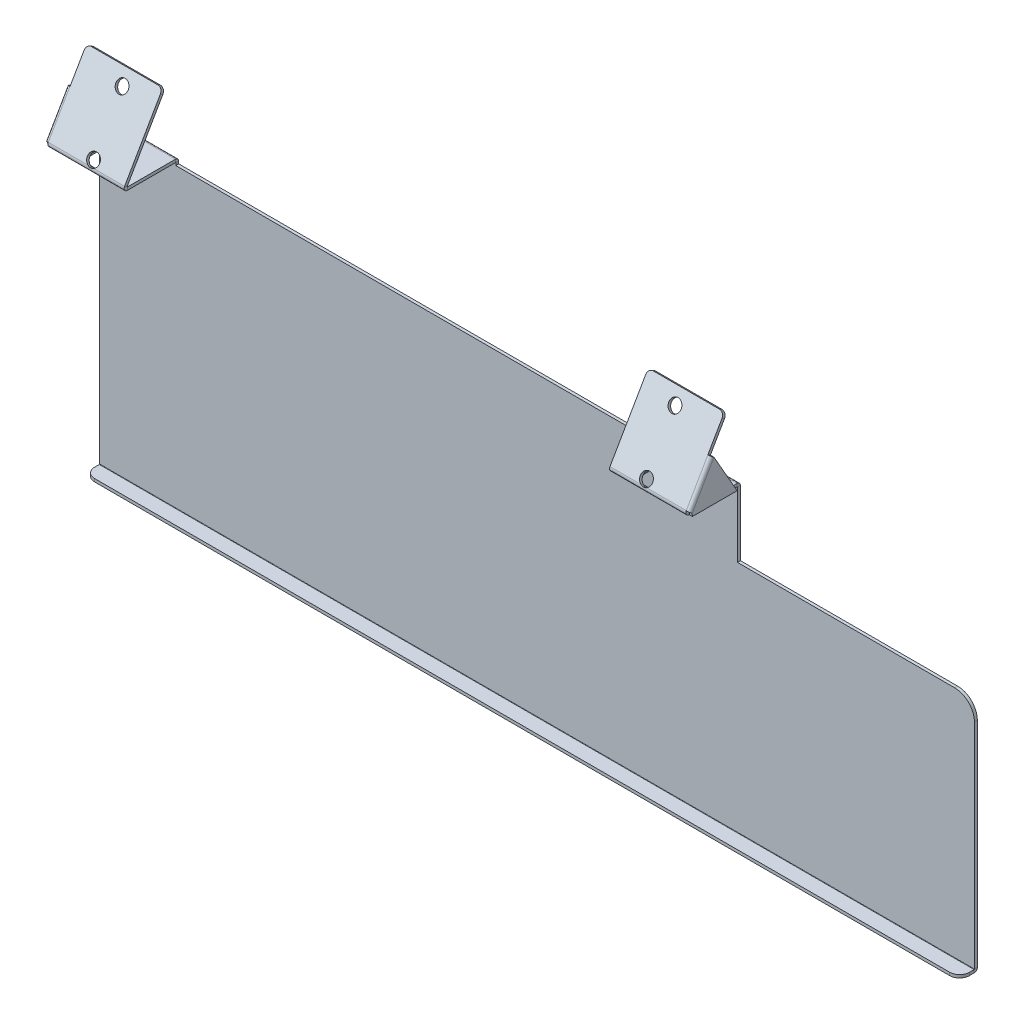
ISO-10303-21;
HEADER;
FILE_DESCRIPTION(('STEP AP214'),'2;1');
FILE_NAME('part.step','',(''),(''),'','','');
FILE_SCHEMA(('AUTOMOTIVE_DESIGN { 1 0 10303 214 1 1 1 1 }'));
ENDSEC;
DATA;
#1=APPLICATION_CONTEXT('core data for automotive mechanical design processes');
#2=APPLICATION_PROTOCOL_DEFINITION('international standard','automotive_design',2000,#1);
#3=PRODUCT_CONTEXT('',#1,'mechanical');
#4=PRODUCT('Part','Part','',(#3));
#5=PRODUCT_RELATED_PRODUCT_CATEGORY('part','',(#4));
#6=PRODUCT_DEFINITION_FORMATION('','',#4);
#7=PRODUCT_DEFINITION_CONTEXT('part definition',#1,'design');
#8=PRODUCT_DEFINITION('design','',#6,#7);
#9=PRODUCT_DEFINITION_SHAPE('','',#8);
#10=(LENGTH_UNIT() NAMED_UNIT(*) SI_UNIT(.MILLI.,.METRE.));
#11=(NAMED_UNIT(*) PLANE_ANGLE_UNIT() SI_UNIT($,.RADIAN.));
#12=(NAMED_UNIT(*) SI_UNIT($,.STERADIAN.) SOLID_ANGLE_UNIT());
#13=UNCERTAINTY_MEASURE_WITH_UNIT(LENGTH_MEASURE(1.E-05),#10,'distance_accuracy_value','');
#14=(GEOMETRIC_REPRESENTATION_CONTEXT(3) GLOBAL_UNCERTAINTY_ASSIGNED_CONTEXT((#13)) GLOBAL_UNIT_ASSIGNED_CONTEXT((#10,
#11,#12)) REPRESENTATION_CONTEXT('',''));
#15=CARTESIAN_POINT('',(0.,0.,0.));
#16=DIRECTION('',(0.,0.,1.));
#17=DIRECTION('',(1.,0.,0.));
#18=AXIS2_PLACEMENT_3D('',#15,#16,#17);
#19=CARTESIAN_POINT('',(0.,100.0506,-3.2453731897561E-13));
#20=DIRECTION('',(0.,-1.,0.));
#21=DIRECTION('',(0.,0.,-1.));
#22=AXIS2_PLACEMENT_3D('',#19,#20,#21);
#23=PLANE('',#22);
#24=DIRECTION('',(0.,0.,-1.));
#25=VECTOR('',#24,1.);
#26=CARTESIAN_POINT('',(-168.148,100.0506,31.119761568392));
#27=LINE('',#26,#25);
#28=CARTESIAN_POINT('',(-168.148,100.0506,31.119761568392));
#29=VERTEX_POINT('',#28);
#30=CARTESIAN_POINT('',(-168.148,100.0506,12.069761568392));
#31=VERTEX_POINT('',#30);
#32=EDGE_CURVE('E586',#29,#31,#27,.T.);
#33=ORIENTED_EDGE('',*,*,#32,.F.);
#34=DIRECTION('',(1.,0.,0.));
#35=VECTOR('',#34,1.);
#36=CARTESIAN_POINT('',(-156.083,100.0506,31.119761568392));
#37=LINE('',#36,#35);
#38=CARTESIAN_POINT('',(-156.083,100.0506,31.119761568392));
#39=VERTEX_POINT('',#38);
#40=EDGE_CURVE('E768',#39,#29,#37,.F.);
#41=ORIENTED_EDGE('',*,*,#40,.F.);
#42=DIRECTION('',(0.,0.,-1.));
#43=VECTOR('',#42,1.);
#44=CARTESIAN_POINT('',(-156.083,100.0506,33.66262));
#45=LINE('',#44,#43);
#46=CARTESIAN_POINT('',(-156.083,100.0506,0.203199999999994));
#47=VERTEX_POINT('',#46);
#48=EDGE_CURVE('E779',#47,#39,#45,.F.);
#49=ORIENTED_EDGE('',*,*,#48,.F.);
#50=DIRECTION('',(-1.,0.,0.));
#51=VECTOR('',#50,1.);
#52=CARTESIAN_POINT('',(-156.083,100.0506,0.203199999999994));
#53=LINE('',#52,#51);
#54=CARTESIAN_POINT('',(-205.105,100.0506,0.203199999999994));
#55=VERTEX_POINT('',#54);
#56=EDGE_CURVE('E790',#55,#47,#53,.F.);
#57=ORIENTED_EDGE('',*,*,#56,.F.);
#58=DIRECTION('',(0.,0.,1.));
#59=VECTOR('',#58,1.);
#60=CARTESIAN_POINT('',(-205.105,100.0506,0.));
#61=LINE('',#60,#59);
#62=CARTESIAN_POINT('',(-205.105,100.0506,31.119761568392));
#63=VERTEX_POINT('',#62);
#64=EDGE_CURVE('E783',#63,#55,#61,.F.);
#65=ORIENTED_EDGE('',*,*,#64,.F.);
#66=CARTESIAN_POINT('',(-187.198,100.0506,31.119761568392));
#67=VERTEX_POINT('',#66);
#68=EDGE_CURVE('E599',#67,#63,#37,.F.);
#69=ORIENTED_EDGE('',*,*,#68,.F.);
#70=DIRECTION('',(0.,0.,1.));
#71=VECTOR('',#70,1.);
#72=CARTESIAN_POINT('',(-187.198,100.0506,12.069761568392));
#73=LINE('',#72,#71);
#74=CARTESIAN_POINT('',(-187.198,100.0506,12.069761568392));
#75=VERTEX_POINT('',#74);
#76=EDGE_CURVE('E587',#75,#67,#73,.T.);
#77=ORIENTED_EDGE('',*,*,#76,.F.);
#78=DIRECTION('',(-1.,0.,0.));
#79=VECTOR('',#78,1.);
#80=CARTESIAN_POINT('',(-168.148,100.0506,12.069761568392));
#81=LINE('',#80,#79);
#82=EDGE_CURVE('E576',#31,#75,#81,.T.);
#83=ORIENTED_EDGE('',*,*,#82,.F.);
#84=EDGE_LOOP('',(#33,#41,#49,#57,#65,#69,#77,#83));
#85=FACE_BOUND('',#84,.T.);
#86=ADVANCED_FACE('F178',(#85),#23,.F.);
#87=CARTESIAN_POINT('',(0.,98.15322,-3.17912652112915E-13));
#88=DIRECTION('',(0.,-1.,0.));
#89=DIRECTION('',(0.,0.,-1.));
#90=AXIS2_PLACEMENT_3D('',#87,#88,#89);
#91=PLANE('',#90);
#92=DIRECTION('',(1.,0.,0.));
#93=VECTOR('',#92,1.);
#94=CARTESIAN_POINT('',(-156.083,98.1532200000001,31.119761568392));
#95=LINE('',#94,#93);
#96=CARTESIAN_POINT('',(-156.083,98.1532200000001,31.119761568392));
#97=VERTEX_POINT('',#96);
#98=CARTESIAN_POINT('',(-168.148,98.1532200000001,31.119761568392));
#99=VERTEX_POINT('',#98);
#100=EDGE_CURVE('E754',#97,#99,#95,.F.);
#101=ORIENTED_EDGE('',*,*,#100,.T.);
#102=DIRECTION('',(0.,0.,-1.));
#103=VECTOR('',#102,1.);
#104=CARTESIAN_POINT('',(-168.148,98.1532200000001,31.119761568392));
#105=LINE('',#104,#103);
#106=CARTESIAN_POINT('',(-168.148,98.15322,12.069761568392));
#107=VERTEX_POINT('',#106);
#108=EDGE_CURVE('E603',#99,#107,#105,.T.);
#109=ORIENTED_EDGE('',*,*,#108,.T.);
#110=DIRECTION('',(-1.,0.,0.));
#111=VECTOR('',#110,1.);
#112=CARTESIAN_POINT('',(-168.148,98.15322,12.069761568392));
#113=LINE('',#112,#111);
#114=CARTESIAN_POINT('',(-187.198,98.15322,12.069761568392));
#115=VERTEX_POINT('',#114);
#116=EDGE_CURVE('E611',#107,#115,#113,.T.);
#117=ORIENTED_EDGE('',*,*,#116,.T.);
#118=DIRECTION('',(0.,0.,1.));
#119=VECTOR('',#118,1.);
#120=CARTESIAN_POINT('',(-187.198,98.15322,12.069761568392));
#121=LINE('',#120,#119);
#122=CARTESIAN_POINT('',(-187.198,98.1532200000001,31.119761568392));
#123=VERTEX_POINT('',#122);
#124=EDGE_CURVE('E594',#115,#123,#121,.T.);
#125=ORIENTED_EDGE('',*,*,#124,.T.);
#126=CARTESIAN_POINT('',(-205.105,98.1532200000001,31.119761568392));
#127=VERTEX_POINT('',#126);
#128=EDGE_CURVE('E758',#123,#127,#95,.F.);
#129=ORIENTED_EDGE('',*,*,#128,.T.);
#130=DIRECTION('',(0.,0.,-1.));
#131=VECTOR('',#130,1.);
#132=CARTESIAN_POINT('',(-205.105,98.15322,-3.17912652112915E-13));
#133=LINE('',#132,#131);
#134=CARTESIAN_POINT('',(-205.105,98.15322,0.203200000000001));
#135=VERTEX_POINT('',#134);
#136=EDGE_CURVE('E788',#127,#135,#133,.T.);
#137=ORIENTED_EDGE('',*,*,#136,.T.);
#138=DIRECTION('',(-1.,0.,0.));
#139=VECTOR('',#138,1.);
#140=CARTESIAN_POINT('',(-156.083,98.15322,0.203200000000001));
#141=LINE('',#140,#139);
#142=CARTESIAN_POINT('',(-156.083,98.15322,0.203200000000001));
#143=VERTEX_POINT('',#142);
#144=EDGE_CURVE('E795',#143,#135,#141,.T.);
#145=ORIENTED_EDGE('',*,*,#144,.F.);
#146=DIRECTION('',(0.,0.,1.));
#147=VECTOR('',#146,1.);
#148=CARTESIAN_POINT('',(-156.083,98.15322,-3.17912652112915E-13));
#149=LINE('',#148,#147);
#150=EDGE_CURVE('E785',#143,#97,#149,.T.);
#151=ORIENTED_EDGE('',*,*,#150,.T.);
#152=EDGE_LOOP('',(#101,#109,#117,#125,#129,#137,#145,#151));
#153=FACE_BOUND('',#152,.T.);
#154=ADVANCED_FACE('F1248',(#153),#91,.T.);
#155=CARTESIAN_POINT('',(0.,40.5376820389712,68.0224192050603));
#156=DIRECTION('',(0.,-0.500000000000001,-0.866025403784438));
#157=DIRECTION('',(0.,0.866025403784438,-0.500000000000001));
#158=AXIS2_PLACEMENT_3D('',#155,#156,#157);
#159=PLANE('',#158);
#160=DIRECTION('',(0.,0.866025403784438,-0.500000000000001));
#161=VECTOR('',#160,1.);
#162=CARTESIAN_POINT('',(-156.083,100.99929,33.1148935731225));
#163=LINE('',#162,#161);
#164=CARTESIAN_POINT('',(-156.083,141.157443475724,9.92957285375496));
#165=VERTEX_POINT('',#164);
#166=CARTESIAN_POINT('',(-156.083,101.30409,32.9389172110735));
#167=VERTEX_POINT('',#166);
#168=EDGE_CURVE('E730',#165,#167,#163,.F.);
#169=ORIENTED_EDGE('',*,*,#168,.F.);
#170=CARTESIAN_POINT('',(-159.258,141.157443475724,9.92957285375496));
#171=DIRECTION('',(0.,-0.500000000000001,-0.866025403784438));
#172=DIRECTION('',(0.,0.866025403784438,-0.500000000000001));
#173=AXIS2_PLACEMENT_3D('',#170,#171,#172);
#174=CIRCLE('',#173,3.175);
#175=CARTESIAN_POINT('',(-159.258,143.90707413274,8.34207285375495));
#176=VERTEX_POINT('',#175);
#177=EDGE_CURVE('E186',#165,#176,#174,.F.);
#178=ORIENTED_EDGE('',*,*,#177,.T.);
#179=DIRECTION('',(-1.,0.,0.));
#180=VECTOR('',#179,1.);
#181=CARTESIAN_POINT('',(-156.083,143.90707413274,8.34207285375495));
#182=LINE('',#181,#180);
#183=CARTESIAN_POINT('',(-201.93,143.90707413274,8.34207285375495));
#184=VERTEX_POINT('',#183);
#185=EDGE_CURVE('E727',#184,#176,#182,.F.);
#186=ORIENTED_EDGE('',*,*,#185,.F.);
#187=CARTESIAN_POINT('',(-201.93,141.157443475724,9.92957285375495));
#188=DIRECTION('',(0.,-0.500000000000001,-0.866025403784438));
#189=DIRECTION('',(0.,0.866025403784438,-0.500000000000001));
#190=AXIS2_PLACEMENT_3D('',#187,#188,#189);
#191=CIRCLE('',#190,3.175);
#192=CARTESIAN_POINT('',(-205.105,141.157443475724,9.92957285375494));
#193=VERTEX_POINT('',#192);
#194=EDGE_CURVE('E193',#184,#193,#191,.F.);
#195=ORIENTED_EDGE('',*,*,#194,.T.);
#196=DIRECTION('',(0.,-0.866025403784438,0.500000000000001));
#197=VECTOR('',#196,1.);
#198=CARTESIAN_POINT('',(-205.105,143.90707413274,8.34207285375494));
#199=LINE('',#198,#197);
#200=CARTESIAN_POINT('',(-205.105,125.429556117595,19.010072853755));
#201=VERTEX_POINT('',#200);
#202=EDGE_CURVE('E724',#201,#193,#199,.F.);
#203=ORIENTED_EDGE('',*,*,#202,.F.);
#204=DIRECTION('',(1.,0.,0.));
#205=VECTOR('',#204,1.);
#206=CARTESIAN_POINT('',(-205.1558,125.429556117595,19.010072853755));
#207=LINE('',#206,#205);
#208=CARTESIAN_POINT('',(-205.1558,125.429556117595,19.010072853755));
#209=VERTEX_POINT('',#208);
#210=EDGE_CURVE('E718',#209,#201,#207,.T.);
#211=ORIENTED_EDGE('',*,*,#210,.F.);
#212=DIRECTION('',(0.,0.86602540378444,-0.499999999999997));
#213=VECTOR('',#212,1.);
#214=CARTESIAN_POINT('',(-205.1558,125.429556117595,19.010072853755));
#215=LINE('',#214,#213);
#216=CARTESIAN_POINT('',(-205.1558,101.30409,32.9389172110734));
#217=VERTEX_POINT('',#216);
#218=EDGE_CURVE('E696',#209,#217,#215,.F.);
#219=ORIENTED_EDGE('',*,*,#218,.T.);
#220=DIRECTION('',(1.,0.,0.));
#221=VECTOR('',#220,1.);
#222=CARTESIAN_POINT('',(-205.1558,101.30409,32.9389172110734));
#223=LINE('',#222,#221);
#224=CARTESIAN_POINT('',(-205.105,101.30409,32.9389172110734));
#225=VERTEX_POINT('',#224);
#226=EDGE_CURVE('E715',#217,#225,#223,.T.);
#227=ORIENTED_EDGE('',*,*,#226,.T.);
#228=DIRECTION('',(1.,0.,0.));
#229=VECTOR('',#228,1.);
#230=CARTESIAN_POINT('',(-205.105,101.30409,32.9389172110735));
#231=LINE('',#230,#229);
#232=CARTESIAN_POINT('',(-179.672793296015,101.30409,32.9389172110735));
#233=VERTEX_POINT('',#232);
#234=EDGE_CURVE('E743',#233,#225,#231,.F.);
#235=ORIENTED_EDGE('',*,*,#234,.F.);
#236=CARTESIAN_POINT('',(-177.8,104.334389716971,31.189372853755));
#237=DIRECTION('',(0.,0.500000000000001,0.866025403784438));
#238=DIRECTION('',(0.,-0.866025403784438,0.500000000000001));
#239=AXIS2_PLACEMENT_3D('',#236,#237,#238);
#240=CIRCLE('',#239,3.96874999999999);
#241=CARTESIAN_POINT('',(-175.927206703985,101.30409,32.9389172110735));
#242=VERTEX_POINT('',#241);
#243=EDGE_CURVE('E626',#242,#233,#240,.T.);
#244=ORIENTED_EDGE('',*,*,#243,.F.);
#245=EDGE_CURVE('E740',#167,#242,#231,.F.);
#246=ORIENTED_EDGE('',*,*,#245,.F.);
#247=EDGE_LOOP('',(#169,#178,#186,#195,#203,#211,#219,#227,#235,#244,#246));
#248=FACE_BOUND('',#247,.T.);
#249=CARTESIAN_POINT('',(-177.8,136.098123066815,12.8505728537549));
#250=DIRECTION('',(0.,0.500000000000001,0.866025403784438));
#251=DIRECTION('',(0.,-0.866025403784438,0.500000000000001));
#252=AXIS2_PLACEMENT_3D('',#249,#250,#251);
#253=CIRCLE('',#252,3.96874999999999);
#254=CARTESIAN_POINT('',(-177.8,132.661084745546,14.8349478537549));
#255=VERTEX_POINT('',#254);
#256=EDGE_CURVE('E617',#255,#255,#253,.T.);
#257=ORIENTED_EDGE('',*,*,#256,.F.);
#258=EDGE_LOOP('',(#257));
#259=FACE_BOUND('',#258,.T.);
#260=ADVANCED_FACE('F1221',(#248,#259),#159,.F.);
#261=CARTESIAN_POINT('',(-205.105,143.90707413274,8.34207285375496));
#262=DIRECTION('',(-1.,0.,0.));
#263=DIRECTION('',(0.,0.,1.));
#264=AXIS2_PLACEMENT_3D('',#261,#262,#263);
#265=PLANE('',#264);
#266=ORIENTED_EDGE('',*,*,#202,.T.);
#267=DIRECTION('',(0.,-0.500000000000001,-0.866025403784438));
#268=VECTOR('',#267,1.);
#269=CARTESIAN_POINT('',(-205.105,141.157443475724,9.92957285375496));
#270=LINE('',#269,#268);
#271=CARTESIAN_POINT('',(-205.105,140.208753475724,8.28639357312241));
#272=VERTEX_POINT('',#271);
#273=EDGE_CURVE('E13',#193,#272,#270,.T.);
#274=ORIENTED_EDGE('',*,*,#273,.T.);
#275=DIRECTION('',(0.,0.866025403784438,-0.500000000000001));
#276=VECTOR('',#275,1.);
#277=CARTESIAN_POINT('',(-205.105,39.5889920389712,66.3792399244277));
#278=LINE('',#277,#276);
#279=CARTESIAN_POINT('',(-205.105,124.480866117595,17.3668935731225));
#280=VERTEX_POINT('',#279);
#281=EDGE_CURVE('E732',#280,#272,#278,.T.);
#282=ORIENTED_EDGE('',*,*,#281,.F.);
#283=DIRECTION('',(0.,0.499999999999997,0.86602540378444));
#284=VECTOR('',#283,1.);
#285=CARTESIAN_POINT('',(-205.105,124.480866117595,17.3668935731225));
#286=LINE('',#285,#284);
#287=EDGE_CURVE('E708',#280,#201,#286,.T.);
#288=ORIENTED_EDGE('',*,*,#287,.T.);
#289=EDGE_LOOP('',(#266,#274,#282,#288));
#290=FACE_BOUND('',#289,.T.);
#291=ADVANCED_FACE('F1422',(#290),#265,.T.);
#292=CARTESIAN_POINT('',(-156.083,100.0506,33.66262));
#293=DIRECTION('',(1.,0.,0.));
#294=DIRECTION('',(0.,1.,0.));
#295=AXIS2_PLACEMENT_3D('',#292,#293,#294);
#296=PLANE('',#295);
#297=ORIENTED_EDGE('',*,*,#48,.T.);
#298=DIRECTION('',(0.,-1.,0.));
#299=VECTOR('',#298,1.);
#300=CARTESIAN_POINT('',(-156.083,100.0506,31.119761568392));
#301=LINE('',#300,#299);
#302=EDGE_CURVE('E761',#39,#97,#301,.T.);
#303=ORIENTED_EDGE('',*,*,#302,.T.);
#304=ORIENTED_EDGE('',*,*,#150,.F.);
#305=DIRECTION('',(0.,1.,0.));
#306=VECTOR('',#305,1.);
#307=CARTESIAN_POINT('',(-156.083,100.0506,0.203200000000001));
#308=LINE('',#307,#306);
#309=EDGE_CURVE('E776',#143,#47,#308,.T.);
#310=ORIENTED_EDGE('',*,*,#309,.T.);
#311=EDGE_LOOP('',(#297,#303,#304,#310));
#312=FACE_BOUND('',#311,.T.);
#313=ADVANCED_FACE('F1253',(#312),#296,.T.);
#314=CARTESIAN_POINT('',(0.,40.5376820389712,68.0224192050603));
#315=DIRECTION('',(0.,-0.500000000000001,-0.866025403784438));
#316=DIRECTION('',(0.,0.866025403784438,-0.500000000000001));
#317=AXIS2_PLACEMENT_3D('',#314,#315,#316);
#318=PLANE('',#317);
#319=DIRECTION('',(-1.,0.,0.));
#320=VECTOR('',#319,1.);
#321=CARTESIAN_POINT('',(0.,143.90707413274,8.34207285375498));
#322=LINE('',#321,#320);
#323=CARTESIAN_POINT('',(201.93,143.90707413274,8.34207285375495));
#324=VERTEX_POINT('',#323);
#325=CARTESIAN_POINT('',(159.258,143.90707413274,8.34207285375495));
#326=VERTEX_POINT('',#325);
#327=EDGE_CURVE('E971',#324,#326,#322,.T.);
#328=ORIENTED_EDGE('',*,*,#327,.T.);
#329=CARTESIAN_POINT('',(159.258,141.157443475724,9.92957285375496));
#330=DIRECTION('',(0.,-0.500000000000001,-0.866025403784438));
#331=DIRECTION('',(0.,0.866025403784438,-0.500000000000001));
#332=AXIS2_PLACEMENT_3D('',#329,#330,#331);
#333=CIRCLE('',#332,3.175);
#334=CARTESIAN_POINT('',(156.083,141.157443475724,9.92957285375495));
#335=VERTEX_POINT('',#334);
#336=EDGE_CURVE('E1203',#326,#335,#333,.F.);
#337=ORIENTED_EDGE('',*,*,#336,.T.);
#338=DIRECTION('',(0.,-0.866025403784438,0.500000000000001));
#339=VECTOR('',#338,1.);
#340=CARTESIAN_POINT('',(156.083,40.5376820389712,68.0224192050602));
#341=LINE('',#340,#339);
#342=CARTESIAN_POINT('',(156.083,101.30409,32.9389172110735));
#343=VERTEX_POINT('',#342);
#344=EDGE_CURVE('E978',#335,#343,#341,.T.);
#345=ORIENTED_EDGE('',*,*,#344,.T.);
#346=DIRECTION('',(1.,0.,0.));
#347=VECTOR('',#346,1.);
#348=CARTESIAN_POINT('',(156.083,101.30409,32.9389172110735));
#349=LINE('',#348,#347);
#350=CARTESIAN_POINT('',(175.927206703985,101.30409,32.9389172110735));
#351=VERTEX_POINT('',#350);
#352=EDGE_CURVE('E991',#351,#343,#349,.F.);
#353=ORIENTED_EDGE('',*,*,#352,.F.);
#354=CARTESIAN_POINT('',(177.8,104.334389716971,31.189372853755));
#355=DIRECTION('',(0.,0.500000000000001,0.866025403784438));
#356=DIRECTION('',(0.,-0.866025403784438,0.500000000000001));
#357=AXIS2_PLACEMENT_3D('',#354,#355,#356);
#358=CIRCLE('',#357,3.96874999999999);
#359=CARTESIAN_POINT('',(179.672793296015,101.30409,32.9389172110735));
#360=VERTEX_POINT('',#359);
#361=EDGE_CURVE('E870',#360,#351,#358,.T.);
#362=ORIENTED_EDGE('',*,*,#361,.F.);
#363=CARTESIAN_POINT('',(205.105,101.30409,32.9389172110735));
#364=VERTEX_POINT('',#363);
#365=EDGE_CURVE('E988',#364,#360,#349,.F.);
#366=ORIENTED_EDGE('',*,*,#365,.F.);
#367=DIRECTION('',(-1.,0.,0.));
#368=VECTOR('',#367,1.);
#369=CARTESIAN_POINT('',(205.1558,101.30409,32.9389172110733));
#370=LINE('',#369,#368);
#371=CARTESIAN_POINT('',(205.1558,101.30409,32.9389172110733));
#372=VERTEX_POINT('',#371);
#373=EDGE_CURVE('E962',#372,#364,#370,.T.);
#374=ORIENTED_EDGE('',*,*,#373,.F.);
#375=DIRECTION('',(0.,-0.866025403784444,0.49999999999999));
#376=VECTOR('',#375,1.);
#377=CARTESIAN_POINT('',(205.1558,101.048700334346,33.0863665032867));
#378=LINE('',#377,#376);
#379=CARTESIAN_POINT('',(205.1558,125.429556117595,19.0100728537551));
#380=VERTEX_POINT('',#379);
#381=EDGE_CURVE('E940',#372,#380,#378,.F.);
#382=ORIENTED_EDGE('',*,*,#381,.T.);
#383=DIRECTION('',(-1.,0.,0.));
#384=VECTOR('',#383,1.);
#385=CARTESIAN_POINT('',(205.1558,125.429556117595,19.0100728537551));
#386=LINE('',#385,#384);
#387=CARTESIAN_POINT('',(205.105,125.429556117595,19.0100728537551));
#388=VERTEX_POINT('',#387);
#389=EDGE_CURVE('E959',#380,#388,#386,.T.);
#390=ORIENTED_EDGE('',*,*,#389,.T.);
#391=DIRECTION('',(0.,0.866025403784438,-0.500000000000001));
#392=VECTOR('',#391,1.);
#393=CARTESIAN_POINT('',(205.105,40.5376820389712,68.0224192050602));
#394=LINE('',#393,#392);
#395=CARTESIAN_POINT('',(205.105,141.157443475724,9.92957285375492));
#396=VERTEX_POINT('',#395);
#397=EDGE_CURVE('E975',#388,#396,#394,.T.);
#398=ORIENTED_EDGE('',*,*,#397,.T.);
#399=CARTESIAN_POINT('',(201.93,141.157443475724,9.92957285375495));
#400=DIRECTION('',(0.,-0.500000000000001,-0.866025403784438));
#401=DIRECTION('',(0.,0.866025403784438,-0.500000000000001));
#402=AXIS2_PLACEMENT_3D('',#399,#400,#401);
#403=CIRCLE('',#402,3.175);
#404=EDGE_CURVE('E1201',#396,#324,#403,.F.);
#405=ORIENTED_EDGE('',*,*,#404,.T.);
#406=EDGE_LOOP('',(#328,#337,#345,#353,#362,#366,#374,#382,#390,#398,#405));
#407=FACE_BOUND('',#406,.T.);
#408=CARTESIAN_POINT('',(177.8,136.098123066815,12.8505728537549));
#409=DIRECTION('',(0.,0.500000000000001,0.866025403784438));
#410=DIRECTION('',(0.,-0.866025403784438,0.500000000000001));
#411=AXIS2_PLACEMENT_3D('',#408,#409,#410);
#412=CIRCLE('',#411,3.96874999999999);
#413=CARTESIAN_POINT('',(177.8,132.661084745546,14.8349478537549));
#414=VERTEX_POINT('',#413);
#415=EDGE_CURVE('E858',#414,#414,#412,.T.);
#416=ORIENTED_EDGE('',*,*,#415,.F.);
#417=EDGE_LOOP('',(#416));
#418=FACE_BOUND('',#417,.T.);
#419=ADVANCED_FACE('F1388',(#407,#418),#318,.F.);
#420=CARTESIAN_POINT('',(205.105,143.90707413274,8.34207285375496));
#421=DIRECTION('',(-1.,0.,0.));
#422=DIRECTION('',(0.,0.,1.));
#423=AXIS2_PLACEMENT_3D('',#420,#421,#422);
#424=PLANE('',#423);
#425=DIRECTION('',(0.,-0.866025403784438,0.500000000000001));
#426=VECTOR('',#425,1.);
#427=CARTESIAN_POINT('',(205.105,142.95838413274,6.69889357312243));
#428=LINE('',#427,#426);
#429=CARTESIAN_POINT('',(205.105,124.480866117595,17.3668935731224));
#430=VERTEX_POINT('',#429);
#431=CARTESIAN_POINT('',(205.105,140.208753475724,8.28639357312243));
#432=VERTEX_POINT('',#431);
#433=EDGE_CURVE('E983',#430,#432,#428,.F.);
#434=ORIENTED_EDGE('',*,*,#433,.T.);
#435=DIRECTION('',(0.,-0.500000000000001,-0.866025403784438));
#436=VECTOR('',#435,1.);
#437=CARTESIAN_POINT('',(205.105,141.157443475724,9.92957285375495));
#438=LINE('',#437,#436);
#439=EDGE_CURVE('E1205',#432,#396,#438,.F.);
#440=ORIENTED_EDGE('',*,*,#439,.T.);
#441=ORIENTED_EDGE('',*,*,#397,.F.);
#442=DIRECTION('',(0.,0.49999999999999,0.866025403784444));
#443=VECTOR('',#442,1.);
#444=CARTESIAN_POINT('',(205.105,124.480866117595,17.3668935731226));
#445=LINE('',#444,#443);
#446=EDGE_CURVE('E952',#430,#388,#445,.T.);
#447=ORIENTED_EDGE('',*,*,#446,.F.);
#448=EDGE_LOOP('',(#434,#440,#441,#447));
#449=FACE_BOUND('',#448,.T.);
#450=ADVANCED_FACE('F1461',(#449),#424,.F.);
#451=CARTESIAN_POINT('',(205.105,100.0506,0.));
#452=DIRECTION('',(-1.,0.,0.));
#453=DIRECTION('',(0.,-1.,0.));
#454=AXIS2_PLACEMENT_3D('',#451,#452,#453);
#455=PLANE('',#454);
#456=DIRECTION('',(0.,-1.,0.));
#457=VECTOR('',#456,1.);
#458=CARTESIAN_POINT('',(205.105,100.0506,31.119761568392));
#459=LINE('',#458,#457);
#460=CARTESIAN_POINT('',(205.105,100.0506,31.119761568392));
#461=VERTEX_POINT('',#460);
#462=CARTESIAN_POINT('',(205.105,98.1532200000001,31.119761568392));
#463=VERTEX_POINT('',#462);
#464=EDGE_CURVE('E1009',#461,#463,#459,.T.);
#465=ORIENTED_EDGE('',*,*,#464,.T.);
#466=DIRECTION('',(0.,0.,1.));
#467=VECTOR('',#466,1.);
#468=CARTESIAN_POINT('',(205.105,98.15322,0.));
#469=LINE('',#468,#467);
#470=CARTESIAN_POINT('',(205.105,98.15322,0.203200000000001));
#471=VERTEX_POINT('',#470);
#472=EDGE_CURVE('E1037',#463,#471,#469,.F.);
#473=ORIENTED_EDGE('',*,*,#472,.T.);
#474=DIRECTION('',(0.,-1.,0.));
#475=VECTOR('',#474,1.);
#476=CARTESIAN_POINT('',(205.105,100.0506,0.203199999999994));
#477=LINE('',#476,#475);
#478=CARTESIAN_POINT('',(205.105,100.0506,0.203199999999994));
#479=VERTEX_POINT('',#478);
#480=EDGE_CURVE('E1025',#471,#479,#477,.F.);
#481=ORIENTED_EDGE('',*,*,#480,.T.);
#482=DIRECTION('',(0.,0.,-1.));
#483=VECTOR('',#482,1.);
#484=CARTESIAN_POINT('',(205.105,100.0506,-3.2453731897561E-13));
#485=LINE('',#484,#483);
#486=EDGE_CURVE('E1032',#461,#479,#485,.T.);
#487=ORIENTED_EDGE('',*,*,#486,.F.);
#488=EDGE_LOOP('',(#465,#473,#481,#487));
#489=FACE_BOUND('',#488,.T.);
#490=ADVANCED_FACE('F1344',(#489),#455,.F.);
#491=CARTESIAN_POINT('',(156.083,100.0506,33.66262));
#492=DIRECTION('',(1.,0.,0.));
#493=DIRECTION('',(0.,1.,0.));
#494=AXIS2_PLACEMENT_3D('',#491,#492,#493);
#495=PLANE('',#494);
#496=DIRECTION('',(0.,-1.,0.));
#497=VECTOR('',#496,1.);
#498=CARTESIAN_POINT('',(156.083,100.0506,31.119761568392));
#499=LINE('',#498,#497);
#500=CARTESIAN_POINT('',(156.083,100.0506,31.119761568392));
#501=VERTEX_POINT('',#500);
#502=CARTESIAN_POINT('',(156.083,98.1532200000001,31.119761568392));
#503=VERTEX_POINT('',#502);
#504=EDGE_CURVE('E1022',#501,#503,#499,.T.);
#505=ORIENTED_EDGE('',*,*,#504,.F.);
#506=DIRECTION('',(0.,0.,1.));
#507=VECTOR('',#506,1.);
#508=CARTESIAN_POINT('',(156.083,100.0506,-3.2453731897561E-13));
#509=LINE('',#508,#507);
#510=CARTESIAN_POINT('',(156.083,100.0506,0.203199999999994));
#511=VERTEX_POINT('',#510);
#512=EDGE_CURVE('E1028',#511,#501,#509,.T.);
#513=ORIENTED_EDGE('',*,*,#512,.F.);
#514=DIRECTION('',(0.,-1.,0.));
#515=VECTOR('',#514,1.);
#516=CARTESIAN_POINT('',(156.083,98.15322,0.203200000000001));
#517=LINE('',#516,#515);
#518=CARTESIAN_POINT('',(156.083,98.15322,0.203200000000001));
#519=VERTEX_POINT('',#518);
#520=EDGE_CURVE('E1042',#519,#511,#517,.F.);
#521=ORIENTED_EDGE('',*,*,#520,.F.);
#522=DIRECTION('',(0.,0.,-1.));
#523=VECTOR('',#522,1.);
#524=CARTESIAN_POINT('',(156.083,98.1532200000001,33.66262));
#525=LINE('',#524,#523);
#526=EDGE_CURVE('E1034',#519,#503,#525,.F.);
#527=ORIENTED_EDGE('',*,*,#526,.T.);
#528=EDGE_LOOP('',(#505,#513,#521,#527));
#529=FACE_BOUND('',#528,.T.);
#530=ADVANCED_FACE('F1329',(#529),#495,.F.);
#531=CARTESIAN_POINT('',(0.,100.0506,-3.2453731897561E-13));
#532=DIRECTION('',(0.,-1.,0.));
#533=DIRECTION('',(0.,0.,-1.));
#534=AXIS2_PLACEMENT_3D('',#531,#532,#533);
#535=PLANE('',#534);
#536=DIRECTION('',(1.,0.,0.));
#537=VECTOR('',#536,1.);
#538=CARTESIAN_POINT('',(168.148,100.0506,12.069761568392));
#539=LINE('',#538,#537);
#540=CARTESIAN_POINT('',(168.148,100.0506,12.069761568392));
#541=VERTEX_POINT('',#540);
#542=CARTESIAN_POINT('',(187.198,100.0506,12.069761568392));
#543=VERTEX_POINT('',#542);
#544=EDGE_CURVE('E839',#541,#543,#539,.T.);
#545=ORIENTED_EDGE('',*,*,#544,.T.);
#546=DIRECTION('',(0.,0.,1.));
#547=VECTOR('',#546,1.);
#548=CARTESIAN_POINT('',(187.198,100.0506,12.069761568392));
#549=LINE('',#548,#547);
#550=CARTESIAN_POINT('',(187.198,100.0506,31.119761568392));
#551=VERTEX_POINT('',#550);
#552=EDGE_CURVE('E842',#543,#551,#549,.T.);
#553=ORIENTED_EDGE('',*,*,#552,.T.);
#554=DIRECTION('',(1.,0.,0.));
#555=VECTOR('',#554,1.);
#556=CARTESIAN_POINT('',(205.105,100.0506,31.119761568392));
#557=LINE('',#556,#555);
#558=EDGE_CURVE('E1016',#461,#551,#557,.F.);
#559=ORIENTED_EDGE('',*,*,#558,.F.);
#560=ORIENTED_EDGE('',*,*,#486,.T.);
#561=DIRECTION('',(-1.,0.,0.));
#562=VECTOR('',#561,1.);
#563=CARTESIAN_POINT('',(205.105,100.0506,0.203199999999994));
#564=LINE('',#563,#562);
#565=EDGE_CURVE('E1039',#511,#479,#564,.F.);
#566=ORIENTED_EDGE('',*,*,#565,.F.);
#567=ORIENTED_EDGE('',*,*,#512,.T.);
#568=CARTESIAN_POINT('',(168.148,100.0506,31.119761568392));
#569=VERTEX_POINT('',#568);
#570=EDGE_CURVE('E1019',#569,#501,#557,.F.);
#571=ORIENTED_EDGE('',*,*,#570,.F.);
#572=DIRECTION('',(0.,0.,-1.));
#573=VECTOR('',#572,1.);
#574=CARTESIAN_POINT('',(168.148,100.0506,31.119761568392));
#575=LINE('',#574,#573);
#576=EDGE_CURVE('E835',#569,#541,#575,.T.);
#577=ORIENTED_EDGE('',*,*,#576,.T.);
#578=EDGE_LOOP('',(#545,#553,#559,#560,#566,#567,#571,#577));
#579=FACE_BOUND('',#578,.T.);
#580=ADVANCED_FACE('F1333',(#579),#535,.F.);
#581=CARTESIAN_POINT('',(0.,98.15322,-3.17912652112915E-13));
#582=DIRECTION('',(0.,-1.,0.));
#583=DIRECTION('',(0.,0.,-1.));
#584=AXIS2_PLACEMENT_3D('',#581,#582,#583);
#585=PLANE('',#584);
#586=DIRECTION('',(0.,0.,1.));
#587=VECTOR('',#586,1.);
#588=CARTESIAN_POINT('',(187.198,98.15322,12.069761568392));
#589=LINE('',#588,#587);
#590=CARTESIAN_POINT('',(187.198,98.15322,12.069761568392));
#591=VERTEX_POINT('',#590);
#592=CARTESIAN_POINT('',(187.198,98.1532200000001,31.119761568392));
#593=VERTEX_POINT('',#592);
#594=EDGE_CURVE('E836',#591,#593,#589,.T.);
#595=ORIENTED_EDGE('',*,*,#594,.F.);
#596=DIRECTION('',(1.,0.,0.));
#597=VECTOR('',#596,1.);
#598=CARTESIAN_POINT('',(168.148,98.15322,12.069761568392));
#599=LINE('',#598,#597);
#600=CARTESIAN_POINT('',(168.148,98.15322,12.069761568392));
#601=VERTEX_POINT('',#600);
#602=EDGE_CURVE('E851',#601,#591,#599,.T.);
#603=ORIENTED_EDGE('',*,*,#602,.F.);
#604=DIRECTION('',(0.,0.,-1.));
#605=VECTOR('',#604,1.);
#606=CARTESIAN_POINT('',(168.148,98.1532200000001,31.119761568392));
#607=LINE('',#606,#605);
#608=CARTESIAN_POINT('',(168.148,98.1532200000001,31.119761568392));
#609=VERTEX_POINT('',#608);
#610=EDGE_CURVE('E848',#609,#601,#607,.T.);
#611=ORIENTED_EDGE('',*,*,#610,.F.);
#612=DIRECTION('',(1.,0.,0.));
#613=VECTOR('',#612,1.);
#614=CARTESIAN_POINT('',(205.105,98.1532200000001,31.119761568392));
#615=LINE('',#614,#613);
#616=EDGE_CURVE('E1006',#609,#503,#615,.F.);
#617=ORIENTED_EDGE('',*,*,#616,.T.);
#618=ORIENTED_EDGE('',*,*,#526,.F.);
#619=DIRECTION('',(-1.,0.,0.));
#620=VECTOR('',#619,1.);
#621=CARTESIAN_POINT('',(205.105,98.15322,0.203200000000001));
#622=LINE('',#621,#620);
#623=EDGE_CURVE('E1045',#471,#519,#622,.T.);
#624=ORIENTED_EDGE('',*,*,#623,.F.);
#625=ORIENTED_EDGE('',*,*,#472,.F.);
#626=EDGE_CURVE('E1002',#463,#593,#615,.F.);
#627=ORIENTED_EDGE('',*,*,#626,.T.);
#628=EDGE_LOOP('',(#595,#603,#611,#617,#618,#624,#625,#627));
#629=FACE_BOUND('',#628,.T.);
#630=ADVANCED_FACE('F1323',(#629),#585,.T.);
#631=CARTESIAN_POINT('',(-205.105,96.393,-1.89738));
#632=DIRECTION('',(0.,1.,0.));
#633=DIRECTION('',(-1.,0.,0.));
#634=AXIS2_PLACEMENT_3D('',#631,#632,#633);
#635=PLANE('',#634);
#636=DIRECTION('',(0.,0.,-1.));
#637=VECTOR('',#636,1.);
#638=CARTESIAN_POINT('',(-156.083,96.393,0.));
#639=LINE('',#638,#637);
#640=CARTESIAN_POINT('',(-156.083,96.393,0.));
#641=VERTEX_POINT('',#640);
#642=CARTESIAN_POINT('',(-156.083,96.393,-1.89738));
#643=VERTEX_POINT('',#642);
#644=EDGE_CURVE('E820',#641,#643,#639,.T.);
#645=ORIENTED_EDGE('',*,*,#644,.F.);
#646=DIRECTION('',(-1.,0.,0.));
#647=VECTOR('',#646,1.);
#648=CARTESIAN_POINT('',(-205.105,96.393,0.));
#649=LINE('',#648,#647);
#650=CARTESIAN_POINT('',(156.083,96.393,0.));
#651=VERTEX_POINT('',#650);
#652=EDGE_CURVE('E1133',#651,#641,#649,.T.);
#653=ORIENTED_EDGE('',*,*,#652,.F.);
#654=DIRECTION('',(0.,0.,-1.));
#655=VECTOR('',#654,1.);
#656=CARTESIAN_POINT('',(156.083,96.393,0.));
#657=LINE('',#656,#655);
#658=CARTESIAN_POINT('',(156.083,96.393,-1.89738));
#659=VERTEX_POINT('',#658);
#660=EDGE_CURVE('E1069',#651,#659,#657,.T.);
#661=ORIENTED_EDGE('',*,*,#660,.T.);
#662=DIRECTION('',(-1.,0.,0.));
#663=VECTOR('',#662,1.);
#664=CARTESIAN_POINT('',(-205.105,96.393,-1.89738));
#665=LINE('',#664,#663);
#666=EDGE_CURVE('E1144',#659,#643,#665,.T.);
#667=ORIENTED_EDGE('',*,*,#666,.T.);
#668=EDGE_LOOP('',(#645,#653,#661,#667));
#669=FACE_BOUND('',#668,.T.);
#670=ADVANCED_FACE('F1306',(#669),#635,.T.);
#671=CARTESIAN_POINT('',(357.505,-96.393,-1.89738));
#672=DIRECTION('',(1.,0.,0.));
#673=DIRECTION('',(0.,0.,-1.));
#674=AXIS2_PLACEMENT_3D('',#671,#672,#673);
#675=PLANE('',#674);
#676=DIRECTION('',(0.,1.,0.));
#677=VECTOR('',#676,1.);
#678=CARTESIAN_POINT('',(357.505,-96.393,0.));
#679=LINE('',#678,#677);
#680=CARTESIAN_POINT('',(357.505,-94.29242,0.));
#681=VERTEX_POINT('',#680);
#682=CARTESIAN_POINT('',(357.505,43.3069999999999,0.));
#683=VERTEX_POINT('',#682);
#684=EDGE_CURVE('E1149',#681,#683,#679,.T.);
#685=ORIENTED_EDGE('',*,*,#684,.F.);
#686=DIRECTION('',(0.,0.,-1.));
#687=VECTOR('',#686,1.);
#688=CARTESIAN_POINT('',(357.505,-94.29242,0.));
#689=LINE('',#688,#687);
#690=CARTESIAN_POINT('',(357.505,-94.29242,-1.89738000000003));
#691=VERTEX_POINT('',#690);
#692=EDGE_CURVE('E1112',#681,#691,#689,.T.);
#693=ORIENTED_EDGE('',*,*,#692,.T.);
#694=DIRECTION('',(0.,1.,0.));
#695=VECTOR('',#694,1.);
#696=CARTESIAN_POINT('',(357.505,-96.393,-1.89738));
#697=LINE('',#696,#695);
#698=CARTESIAN_POINT('',(357.505,43.3069999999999,-1.89738));
#699=VERTEX_POINT('',#698);
#700=EDGE_CURVE('E1132',#691,#699,#697,.T.);
#701=ORIENTED_EDGE('',*,*,#700,.T.);
#702=DIRECTION('',(0.,0.,1.));
#703=VECTOR('',#702,1.);
#704=CARTESIAN_POINT('',(357.505,43.3069999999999,-1.89738));
#705=LINE('',#704,#703);
#706=EDGE_CURVE('E1146',#699,#683,#705,.T.);
#707=ORIENTED_EDGE('',*,*,#706,.T.);
#708=EDGE_LOOP('',(#685,#693,#701,#707));
#709=FACE_BOUND('',#708,.T.);
#710=ADVANCED_FACE('F1791',(#709),#675,.T.);
#711=CARTESIAN_POINT('',(344.805,43.307,-1.89738));
#712=DIRECTION('',(0.,0.,1.));
#713=DIRECTION('',(1.,0.,0.));
#714=AXIS2_PLACEMENT_3D('',#711,#712,#713);
#715=PLANE('',#714);
#716=DIRECTION('',(1.,0.,0.));
#717=VECTOR('',#716,1.);
#718=CARTESIAN_POINT('',(357.505,-94.29242,-1.89738000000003));
#719=LINE('',#718,#717);
#720=CARTESIAN_POINT('',(-205.105,-94.29242,-1.89738));
#721=VERTEX_POINT('',#720);
#722=EDGE_CURVE('E1106',#691,#721,#719,.F.);
#723=ORIENTED_EDGE('',*,*,#722,.T.);
#724=DIRECTION('',(0.,-1.,0.));
#725=VECTOR('',#724,1.);
#726=CARTESIAN_POINT('',(-205.105,-96.393,-1.89738));
#727=LINE('',#726,#725);
#728=CARTESIAN_POINT('',(-205.105,97.95002,-1.89738));
#729=VERTEX_POINT('',#728);
#730=EDGE_CURVE('E1129',#729,#721,#727,.T.);
#731=ORIENTED_EDGE('',*,*,#730,.F.);
#732=DIRECTION('',(-1.,0.,0.));
#733=VECTOR('',#732,1.);
#734=CARTESIAN_POINT('',(-205.105,97.95002,-1.89738));
#735=LINE('',#734,#733);
#736=CARTESIAN_POINT('',(-156.083,97.95002,-1.89738));
#737=VERTEX_POINT('',#736);
#738=EDGE_CURVE('E800',#729,#737,#735,.F.);
#739=ORIENTED_EDGE('',*,*,#738,.T.);
#740=DIRECTION('',(0.,-1.,0.));
#741=VECTOR('',#740,1.);
#742=CARTESIAN_POINT('',(-156.083,97.95002,-1.89738));
#743=LINE('',#742,#741);
#744=EDGE_CURVE('E826',#737,#643,#743,.T.);
#745=ORIENTED_EDGE('',*,*,#744,.T.);
#746=ORIENTED_EDGE('',*,*,#666,.F.);
#747=DIRECTION('',(0.,-1.,0.));
#748=VECTOR('',#747,1.);
#749=CARTESIAN_POINT('',(156.083,97.95002,-1.89738));
#750=LINE('',#749,#748);
#751=CARTESIAN_POINT('',(156.083,97.95002,-1.89738));
#752=VERTEX_POINT('',#751);
#753=EDGE_CURVE('E1074',#752,#659,#750,.T.);
#754=ORIENTED_EDGE('',*,*,#753,.F.);
#755=DIRECTION('',(-1.,0.,0.));
#756=VECTOR('',#755,1.);
#757=CARTESIAN_POINT('',(156.083,97.95002,-1.89738));
#758=LINE('',#757,#756);
#759=CARTESIAN_POINT('',(205.105,97.95002,-1.89738));
#760=VERTEX_POINT('',#759);
#761=EDGE_CURVE('E1049',#752,#760,#758,.F.);
#762=ORIENTED_EDGE('',*,*,#761,.T.);
#763=DIRECTION('',(0.,1.,0.));
#764=VECTOR('',#763,1.);
#765=CARTESIAN_POINT('',(205.105,56.007,-1.89738));
#766=LINE('',#765,#764);
#767=CARTESIAN_POINT('',(205.105,56.007,-1.89738));
#768=VERTEX_POINT('',#767);
#769=EDGE_CURVE('E1141',#768,#760,#766,.T.);
#770=ORIENTED_EDGE('',*,*,#769,.F.);
#771=DIRECTION('',(-1.,0.,0.));
#772=VECTOR('',#771,1.);
#773=CARTESIAN_POINT('',(344.805,56.007,-1.89738));
#774=LINE('',#773,#772);
#775=CARTESIAN_POINT('',(344.805,56.007,-1.89738));
#776=VERTEX_POINT('',#775);
#777=EDGE_CURVE('E1138',#776,#768,#774,.T.);
#778=ORIENTED_EDGE('',*,*,#777,.F.);
#779=CARTESIAN_POINT('',(344.805,43.307,-1.89738));
#780=DIRECTION('',(0.,0.,1.));
#781=DIRECTION('',(1.,0.,0.));
#782=AXIS2_PLACEMENT_3D('',#779,#780,#781);
#783=CIRCLE('',#782,12.7);
#784=EDGE_CURVE('E1135',#699,#776,#783,.T.);
#785=ORIENTED_EDGE('',*,*,#784,.F.);
#786=ORIENTED_EDGE('',*,*,#700,.F.);
#787=EDGE_LOOP('',(#723,#731,#739,#745,#746,#754,#762,#770,#778,#785,#786));
#788=FACE_BOUND('',#787,.T.);
#789=ADVANCED_FACE('F1289',(#788),#715,.F.);
#790=CARTESIAN_POINT('',(344.805,43.307,0.));
#791=DIRECTION('',(0.,0.,1.));
#792=DIRECTION('',(1.,0.,0.));
#793=AXIS2_PLACEMENT_3D('',#790,#791,#792);
#794=PLANE('',#793);
#795=DIRECTION('',(0.,-1.,0.));
#796=VECTOR('',#795,1.);
#797=CARTESIAN_POINT('',(-205.105,-96.393,0.));
#798=LINE('',#797,#796);
#799=CARTESIAN_POINT('',(-205.105,97.95002,0.));
#800=VERTEX_POINT('',#799);
#801=CARTESIAN_POINT('',(-205.105,-94.29242,0.));
#802=VERTEX_POINT('',#801);
#803=EDGE_CURVE('E1126',#800,#802,#798,.T.);
#804=ORIENTED_EDGE('',*,*,#803,.T.);
#805=DIRECTION('',(1.,0.,0.));
#806=VECTOR('',#805,1.);
#807=CARTESIAN_POINT('',(357.505,-94.29242,0.));
#808=LINE('',#807,#806);
#809=EDGE_CURVE('E1118',#681,#802,#808,.F.);
#810=ORIENTED_EDGE('',*,*,#809,.F.);
#811=ORIENTED_EDGE('',*,*,#684,.T.);
#812=CARTESIAN_POINT('',(344.805,43.307,0.));
#813=DIRECTION('',(0.,0.,1.));
#814=DIRECTION('',(1.,0.,0.));
#815=AXIS2_PLACEMENT_3D('',#812,#813,#814);
#816=CIRCLE('',#815,12.7);
#817=CARTESIAN_POINT('',(344.805,56.007,0.));
#818=VERTEX_POINT('',#817);
#819=EDGE_CURVE('E1151',#683,#818,#816,.T.);
#820=ORIENTED_EDGE('',*,*,#819,.T.);
#821=DIRECTION('',(-1.,0.,0.));
#822=VECTOR('',#821,1.);
#823=CARTESIAN_POINT('',(344.805,56.007,0.));
#824=LINE('',#823,#822);
#825=CARTESIAN_POINT('',(205.105,56.007,0.));
#826=VERTEX_POINT('',#825);
#827=EDGE_CURVE('E1154',#818,#826,#824,.T.);
#828=ORIENTED_EDGE('',*,*,#827,.T.);
#829=DIRECTION('',(0.,1.,0.));
#830=VECTOR('',#829,1.);
#831=CARTESIAN_POINT('',(205.105,56.007,0.));
#832=LINE('',#831,#830);
#833=CARTESIAN_POINT('',(205.105,97.95002,0.));
#834=VERTEX_POINT('',#833);
#835=EDGE_CURVE('E1157',#826,#834,#832,.T.);
#836=ORIENTED_EDGE('',*,*,#835,.T.);
#837=DIRECTION('',(-1.,0.,0.));
#838=VECTOR('',#837,1.);
#839=CARTESIAN_POINT('',(156.083,97.95002,0.));
#840=LINE('',#839,#838);
#841=CARTESIAN_POINT('',(156.083,97.95002,0.));
#842=VERTEX_POINT('',#841);
#843=EDGE_CURVE('E1062',#842,#834,#840,.F.);
#844=ORIENTED_EDGE('',*,*,#843,.F.);
#845=DIRECTION('',(0.,-1.,0.));
#846=VECTOR('',#845,1.);
#847=CARTESIAN_POINT('',(156.083,97.95002,0.));
#848=LINE('',#847,#846);
#849=EDGE_CURVE('E1076',#842,#651,#848,.T.);
#850=ORIENTED_EDGE('',*,*,#849,.T.);
#851=ORIENTED_EDGE('',*,*,#652,.T.);
#852=DIRECTION('',(0.,-1.,0.));
#853=VECTOR('',#852,1.);
#854=CARTESIAN_POINT('',(-156.083,97.95002,0.));
#855=LINE('',#854,#853);
#856=CARTESIAN_POINT('',(-156.083,97.95002,0.));
#857=VERTEX_POINT('',#856);
#858=EDGE_CURVE('E825',#857,#641,#855,.T.);
#859=ORIENTED_EDGE('',*,*,#858,.F.);
#860=DIRECTION('',(-1.,0.,0.));
#861=VECTOR('',#860,1.);
#862=CARTESIAN_POINT('',(-205.105,97.95002,0.));
#863=LINE('',#862,#861);
#864=EDGE_CURVE('E813',#800,#857,#863,.F.);
#865=ORIENTED_EDGE('',*,*,#864,.F.);
#866=EDGE_LOOP('',(#804,#810,#811,#820,#828,#836,#844,#850,#851,#859,#865));
#867=FACE_BOUND('',#866,.T.);
#868=ADVANCED_FACE('F1300',(#867),#794,.T.);
#869=CARTESIAN_POINT('',(-205.105,-96.393,-1.89738));
#870=DIRECTION('',(-1.,0.,0.));
#871=DIRECTION('',(0.,0.,1.));
#872=AXIS2_PLACEMENT_3D('',#869,#870,#871);
#873=PLANE('',#872);
#874=DIRECTION('',(0.,0.,-1.));
#875=VECTOR('',#874,1.);
#876=CARTESIAN_POINT('',(-205.105,-94.29242,0.));
#877=LINE('',#876,#875);
#878=EDGE_CURVE('E1123',#802,#721,#877,.T.);
#879=ORIENTED_EDGE('',*,*,#878,.F.);
#880=ORIENTED_EDGE('',*,*,#803,.F.);
#881=DIRECTION('',(0.,0.,-1.));
#882=VECTOR('',#881,1.);
#883=CARTESIAN_POINT('',(-205.105,97.95002,0.));
#884=LINE('',#883,#882);
#885=EDGE_CURVE('E807',#800,#729,#884,.T.);
#886=ORIENTED_EDGE('',*,*,#885,.T.);
#887=ORIENTED_EDGE('',*,*,#730,.T.);
#888=EDGE_LOOP('',(#879,#880,#886,#887));
#889=FACE_BOUND('',#888,.T.);
#890=ADVANCED_FACE('F1298',(#889),#873,.T.);
#891=CARTESIAN_POINT('',(205.105,56.007,-1.89738));
#892=DIRECTION('',(1.,0.,0.));
#893=DIRECTION('',(0.,0.,-1.));
#894=AXIS2_PLACEMENT_3D('',#891,#892,#893);
#895=PLANE('',#894);
#896=ORIENTED_EDGE('',*,*,#835,.F.);
#897=DIRECTION('',(0.,0.,1.));
#898=VECTOR('',#897,1.);
#899=CARTESIAN_POINT('',(205.105,56.007,-1.89738));
#900=LINE('',#899,#898);
#901=EDGE_CURVE('E1162',#768,#826,#900,.T.);
#902=ORIENTED_EDGE('',*,*,#901,.F.);
#903=ORIENTED_EDGE('',*,*,#769,.T.);
#904=DIRECTION('',(0.,0.,-1.));
#905=VECTOR('',#904,1.);
#906=CARTESIAN_POINT('',(205.105,97.95002,0.));
#907=LINE('',#906,#905);
#908=EDGE_CURVE('E1066',#834,#760,#907,.T.);
#909=ORIENTED_EDGE('',*,*,#908,.F.);
#910=EDGE_LOOP('',(#896,#902,#903,#909));
#911=FACE_BOUND('',#910,.T.);
#912=ADVANCED_FACE('F1820',(#911),#895,.T.);
#913=CARTESIAN_POINT('',(344.805,56.007,-1.89738));
#914=DIRECTION('',(0.,1.,0.));
#915=DIRECTION('',(0.,0.,1.));
#916=AXIS2_PLACEMENT_3D('',#913,#914,#915);
#917=PLANE('',#916);
#918=ORIENTED_EDGE('',*,*,#827,.F.);
#919=DIRECTION('',(0.,0.,1.));
#920=VECTOR('',#919,1.);
#921=CARTESIAN_POINT('',(344.805,56.007,-1.89738));
#922=LINE('',#921,#920);
#923=EDGE_CURVE('E1165',#776,#818,#922,.T.);
#924=ORIENTED_EDGE('',*,*,#923,.F.);
#925=ORIENTED_EDGE('',*,*,#777,.T.);
#926=ORIENTED_EDGE('',*,*,#901,.T.);
#927=EDGE_LOOP('',(#918,#924,#925,#926));
#928=FACE_BOUND('',#927,.T.);
#929=ADVANCED_FACE('F2164',(#928),#917,.T.);
#930=CARTESIAN_POINT('',(344.805,43.307,-1.89738));
#931=DIRECTION('',(0.,0.,1.));
#932=DIRECTION('',(1.,0.,0.));
#933=AXIS2_PLACEMENT_3D('',#930,#931,#932);
#934=CYLINDRICAL_SURFACE('',#933,12.7);
#935=ORIENTED_EDGE('',*,*,#819,.F.);
#936=ORIENTED_EDGE('',*,*,#706,.F.);
#937=ORIENTED_EDGE('',*,*,#784,.T.);
#938=ORIENTED_EDGE('',*,*,#923,.T.);
#939=EDGE_LOOP('',(#935,#936,#937,#938));
#940=FACE_BOUND('',#939,.T.);
#941=ADVANCED_FACE('F2160',(#940),#934,.T.);
#942=CARTESIAN_POINT('',(-205.105,-94.29242,0.203200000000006));
#943=DIRECTION('',(-1.,0.,0.));
#944=DIRECTION('',(0.,0.,1.));
#945=AXIS2_PLACEMENT_3D('',#942,#943,#944);
#946=PLANE('',#945);
#947=DIRECTION('',(0.,1.,0.));
#948=VECTOR('',#947,1.);
#949=CARTESIAN_POINT('',(-205.105,-96.393,0.203199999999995));
#950=LINE('',#949,#948);
#951=CARTESIAN_POINT('',(-205.105,-94.49562,0.203200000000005));
#952=VERTEX_POINT('',#951);
#953=CARTESIAN_POINT('',(-205.105,-96.393,0.2032));
#954=VERTEX_POINT('',#953);
#955=EDGE_CURVE('E1078',#952,#954,#950,.F.);
#956=ORIENTED_EDGE('',*,*,#955,.F.);
#957=CARTESIAN_POINT('',(-205.105,-94.29242,0.203200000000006));
#958=DIRECTION('',(1.,0.,0.));
#959=DIRECTION('',(0.,0.,-1.));
#960=AXIS2_PLACEMENT_3D('',#957,#958,#959);
#961=CIRCLE('',#960,0.203200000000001);
#962=EDGE_CURVE('E1115',#802,#952,#961,.F.);
#963=ORIENTED_EDGE('',*,*,#962,.F.);
#964=ORIENTED_EDGE('',*,*,#878,.T.);
#965=CARTESIAN_POINT('',(-205.105,-94.29242,0.203200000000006));
#966=DIRECTION('',(1.,0.,0.));
#967=DIRECTION('',(0.,0.,-1.));
#968=AXIS2_PLACEMENT_3D('',#965,#966,#967);
#969=CIRCLE('',#968,2.10058);
#970=EDGE_CURVE('E1108',#721,#954,#969,.F.);
#971=ORIENTED_EDGE('',*,*,#970,.T.);
#972=EDGE_LOOP('',(#956,#963,#964,#971));
#973=FACE_BOUND('',#972,.T.);
#974=ADVANCED_FACE('F2163',(#973),#946,.T.);
#975=CARTESIAN_POINT('',(357.505,-94.29242,0.203199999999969));
#976=DIRECTION('',(-1.,0.,0.));
#977=DIRECTION('',(0.,0.,1.));
#978=AXIS2_PLACEMENT_3D('',#975,#976,#977);
#979=PLANE('',#978);
#980=CARTESIAN_POINT('',(357.505,-94.29242,0.203199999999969));
#981=DIRECTION('',(1.,0.,0.));
#982=DIRECTION('',(0.,0.,-1.));
#983=AXIS2_PLACEMENT_3D('',#980,#981,#982);
#984=CIRCLE('',#983,0.203200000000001);
#985=CARTESIAN_POINT('',(357.505,-94.49562,0.203199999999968));
#986=VERTEX_POINT('',#985);
#987=EDGE_CURVE('E1082',#986,#681,#984,.T.);
#988=ORIENTED_EDGE('',*,*,#987,.F.);
#989=DIRECTION('',(0.,1.,0.));
#990=VECTOR('',#989,1.);
#991=CARTESIAN_POINT('',(357.505,-94.49562,0.203199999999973));
#992=LINE('',#991,#990);
#993=CARTESIAN_POINT('',(357.505,-96.393,0.203199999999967));
#994=VERTEX_POINT('',#993);
#995=EDGE_CURVE('E1099',#986,#994,#992,.F.);
#996=ORIENTED_EDGE('',*,*,#995,.T.);
#997=CARTESIAN_POINT('',(357.505,-94.29242,0.203199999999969));
#998=DIRECTION('',(1.,0.,0.));
#999=DIRECTION('',(0.,0.,-1.));
#1000=AXIS2_PLACEMENT_3D('',#997,#998,#999);
#1001=CIRCLE('',#1000,2.10058);
#1002=EDGE_CURVE('E1109',#994,#691,#1001,.T.);
#1003=ORIENTED_EDGE('',*,*,#1002,.T.);
#1004=ORIENTED_EDGE('',*,*,#692,.F.);
#1005=EDGE_LOOP('',(#988,#996,#1003,#1004));
#1006=FACE_BOUND('',#1005,.T.);
#1007=ADVANCED_FACE('F2171',(#1006),#979,.F.);
#1008=CARTESIAN_POINT('',(357.505,-94.29242,0.203199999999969));
#1009=DIRECTION('',(1.,0.,0.));
#1010=DIRECTION('',(0.,-1.,0.));
#1011=AXIS2_PLACEMENT_3D('',#1008,#1009,#1010);
#1012=CYLINDRICAL_SURFACE('',#1011,2.10058);
#1013=ORIENTED_EDGE('',*,*,#722,.F.);
#1014=ORIENTED_EDGE('',*,*,#1002,.F.);
#1015=DIRECTION('',(1.,0.,0.));
#1016=VECTOR('',#1015,1.);
#1017=CARTESIAN_POINT('',(-205.105,-96.393,0.203199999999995));
#1018=LINE('',#1017,#1016);
#1019=EDGE_CURVE('E1096',#994,#954,#1018,.F.);
#1020=ORIENTED_EDGE('',*,*,#1019,.T.);
#1021=ORIENTED_EDGE('',*,*,#970,.F.);
#1022=EDGE_LOOP('',(#1013,#1014,#1020,#1021));
#1023=FACE_BOUND('',#1022,.T.);
#1024=ADVANCED_FACE('F2174',(#1023),#1012,.T.);
#1025=CARTESIAN_POINT('',(357.505,-94.29242,0.203199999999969));
#1026=DIRECTION('',(1.,0.,0.));
#1027=DIRECTION('',(0.,-1.,0.));
#1028=AXIS2_PLACEMENT_3D('',#1025,#1026,#1027);
#1029=CYLINDRICAL_SURFACE('',#1028,0.203200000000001);
#1030=ORIENTED_EDGE('',*,*,#809,.T.);
#1031=ORIENTED_EDGE('',*,*,#962,.T.);
#1032=DIRECTION('',(1.,0.,0.));
#1033=VECTOR('',#1032,1.);
#1034=CARTESIAN_POINT('',(-205.105,-94.49562,0.203200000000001));
#1035=LINE('',#1034,#1033);
#1036=EDGE_CURVE('E1102',#952,#986,#1035,.T.);
#1037=ORIENTED_EDGE('',*,*,#1036,.T.);
#1038=ORIENTED_EDGE('',*,*,#987,.T.);
#1039=EDGE_LOOP('',(#1030,#1031,#1037,#1038));
#1040=FACE_BOUND('',#1039,.T.);
#1041=ADVANCED_FACE('F2179',(#1040),#1029,.F.);
#1042=CARTESIAN_POINT('',(-205.105,-96.393,0.));
#1043=DIRECTION('',(1.,0.,0.));
#1044=DIRECTION('',(0.,0.,-1.));
#1045=AXIS2_PLACEMENT_3D('',#1042,#1043,#1044);
#1046=PLANE('',#1045);
#1047=DIRECTION('',(0.,0.,-1.));
#1048=VECTOR('',#1047,1.);
#1049=CARTESIAN_POINT('',(-205.105,-96.393,-2.87286562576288E-13));
#1050=LINE('',#1049,#1048);
#1051=CARTESIAN_POINT('',(-205.105,-96.393,3.18262));
#1052=VERTEX_POINT('',#1051);
#1053=EDGE_CURVE('E1086',#1052,#954,#1050,.T.);
#1054=ORIENTED_EDGE('',*,*,#1053,.F.);
#1055=DIRECTION('',(0.,1.,0.));
#1056=VECTOR('',#1055,1.);
#1057=CARTESIAN_POINT('',(-205.105,-96.393,3.18262));
#1058=LINE('',#1057,#1056);
#1059=CARTESIAN_POINT('',(-205.105,-94.49562,3.18262000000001));
#1060=VERTEX_POINT('',#1059);
#1061=EDGE_CURVE('E1183',#1052,#1060,#1058,.T.);
#1062=ORIENTED_EDGE('',*,*,#1061,.T.);
#1063=DIRECTION('',(0.,0.,1.));
#1064=VECTOR('',#1063,1.);
#1065=CARTESIAN_POINT('',(-205.105,-94.49562,0.));
#1066=LINE('',#1065,#1064);
#1067=EDGE_CURVE('E1094',#1060,#952,#1066,.F.);
#1068=ORIENTED_EDGE('',*,*,#1067,.T.);
#1069=ORIENTED_EDGE('',*,*,#955,.T.);
#1070=EDGE_LOOP('',(#1054,#1062,#1068,#1069));
#1071=FACE_BOUND('',#1070,.T.);
#1072=ADVANCED_FACE('F2182',(#1071),#1046,.F.);
#1073=CARTESIAN_POINT('',(357.505,-96.393,9.53262));
#1074=DIRECTION('',(-1.,0.,0.));
#1075=DIRECTION('',(0.,0.,1.));
#1076=AXIS2_PLACEMENT_3D('',#1073,#1074,#1075);
#1077=PLANE('',#1076);
#1078=DIRECTION('',(0.,0.,-1.));
#1079=VECTOR('',#1078,1.);
#1080=CARTESIAN_POINT('',(357.505,-94.49562,9.53262));
#1081=LINE('',#1080,#1079);
#1082=CARTESIAN_POINT('',(357.505,-94.49562,3.18262000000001));
#1083=VERTEX_POINT('',#1082);
#1084=EDGE_CURVE('E1091',#986,#1083,#1081,.F.);
#1085=ORIENTED_EDGE('',*,*,#1084,.T.);
#1086=DIRECTION('',(0.,1.,0.));
#1087=VECTOR('',#1086,1.);
#1088=CARTESIAN_POINT('',(357.505,-96.393,3.18262));
#1089=LINE('',#1088,#1087);
#1090=CARTESIAN_POINT('',(357.505,-96.393,3.18262));
#1091=VERTEX_POINT('',#1090);
#1092=EDGE_CURVE('E1177',#1083,#1091,#1089,.F.);
#1093=ORIENTED_EDGE('',*,*,#1092,.T.);
#1094=DIRECTION('',(0.,0.,1.));
#1095=VECTOR('',#1094,1.);
#1096=CARTESIAN_POINT('',(357.505,-96.393,-2.87286562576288E-13));
#1097=LINE('',#1096,#1095);
#1098=EDGE_CURVE('E1083',#994,#1091,#1097,.T.);
#1099=ORIENTED_EDGE('',*,*,#1098,.F.);
#1100=ORIENTED_EDGE('',*,*,#995,.F.);
#1101=EDGE_LOOP('',(#1085,#1093,#1099,#1100));
#1102=FACE_BOUND('',#1101,.T.);
#1103=ADVANCED_FACE('F2189',(#1102),#1077,.F.);
#1104=CARTESIAN_POINT('',(0.,-96.393,-2.87286562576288E-13));
#1105=DIRECTION('',(0.,1.,0.));
#1106=DIRECTION('',(0.,0.,1.));
#1107=AXIS2_PLACEMENT_3D('',#1104,#1105,#1106);
#1108=PLANE('',#1107);
#1109=ORIENTED_EDGE('',*,*,#1098,.T.);
#1110=CARTESIAN_POINT('',(351.155,-96.393,3.18262));
#1111=DIRECTION('',(0.,1.,0.));
#1112=DIRECTION('',(0.,0.,1.));
#1113=AXIS2_PLACEMENT_3D('',#1110,#1111,#1112);
#1114=CIRCLE('',#1113,6.35);
#1115=CARTESIAN_POINT('',(351.155,-96.393,9.53262));
#1116=VERTEX_POINT('',#1115);
#1117=EDGE_CURVE('E1181',#1091,#1116,#1114,.F.);
#1118=ORIENTED_EDGE('',*,*,#1117,.T.);
#1119=DIRECTION('',(-1.,0.,0.));
#1120=VECTOR('',#1119,1.);
#1121=CARTESIAN_POINT('',(0.,-96.393,9.53262));
#1122=LINE('',#1121,#1120);
#1123=CARTESIAN_POINT('',(-198.755,-96.393,9.53262));
#1124=VERTEX_POINT('',#1123);
#1125=EDGE_CURVE('E1079',#1116,#1124,#1122,.T.);
#1126=ORIENTED_EDGE('',*,*,#1125,.T.);
#1127=CARTESIAN_POINT('',(-198.755,-96.393,3.18262));
#1128=DIRECTION('',(0.,1.,0.));
#1129=DIRECTION('',(0.,0.,1.));
#1130=AXIS2_PLACEMENT_3D('',#1127,#1128,#1129);
#1131=CIRCLE('',#1130,6.35);
#1132=EDGE_CURVE('E1179',#1124,#1052,#1131,.F.);
#1133=ORIENTED_EDGE('',*,*,#1132,.T.);
#1134=ORIENTED_EDGE('',*,*,#1053,.T.);
#1135=ORIENTED_EDGE('',*,*,#1019,.F.);
#1136=EDGE_LOOP('',(#1109,#1118,#1126,#1133,#1134,#1135));
#1137=FACE_BOUND('',#1136,.T.);
#1138=ADVANCED_FACE('F2193',(#1137),#1108,.F.);
#1139=CARTESIAN_POINT('',(0.,-94.49562,-2.80661895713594E-13));
#1140=DIRECTION('',(0.,1.,0.));
#1141=DIRECTION('',(0.,0.,1.));
#1142=AXIS2_PLACEMENT_3D('',#1139,#1140,#1141);
#1143=PLANE('',#1142);
#1144=DIRECTION('',(1.,0.,0.));
#1145=VECTOR('',#1144,1.);
#1146=CARTESIAN_POINT('',(-205.105,-94.49562,9.53262));
#1147=LINE('',#1146,#1145);
#1148=CARTESIAN_POINT('',(351.155,-94.49562,9.53262));
#1149=VERTEX_POINT('',#1148);
#1150=CARTESIAN_POINT('',(-198.755,-94.49562,9.53262));
#1151=VERTEX_POINT('',#1150);
#1152=EDGE_CURVE('E1088',#1149,#1151,#1147,.F.);
#1153=ORIENTED_EDGE('',*,*,#1152,.F.);
#1154=CARTESIAN_POINT('',(351.155,-94.49562,3.18262000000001));
#1155=DIRECTION('',(0.,1.,0.));
#1156=DIRECTION('',(0.,0.,1.));
#1157=AXIS2_PLACEMENT_3D('',#1154,#1155,#1156);
#1158=CIRCLE('',#1157,6.35);
#1159=EDGE_CURVE('E1175',#1149,#1083,#1158,.T.);
#1160=ORIENTED_EDGE('',*,*,#1159,.T.);
#1161=ORIENTED_EDGE('',*,*,#1084,.F.);
#1162=ORIENTED_EDGE('',*,*,#1036,.F.);
#1163=ORIENTED_EDGE('',*,*,#1067,.F.);
#1164=CARTESIAN_POINT('',(-198.755,-94.49562,3.18262000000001));
#1165=DIRECTION('',(0.,1.,0.));
#1166=DIRECTION('',(0.,0.,1.));
#1167=AXIS2_PLACEMENT_3D('',#1164,#1165,#1166);
#1168=CIRCLE('',#1167,6.35);
#1169=EDGE_CURVE('E1173',#1060,#1151,#1168,.T.);
#1170=ORIENTED_EDGE('',*,*,#1169,.T.);
#1171=EDGE_LOOP('',(#1153,#1160,#1161,#1162,#1163,#1170));
#1172=FACE_BOUND('',#1171,.T.);
#1173=ADVANCED_FACE('F2197',(#1172),#1143,.T.);
#1174=CARTESIAN_POINT('',(-205.105,-96.393,9.53262));
#1175=DIRECTION('',(0.,0.,-1.));
#1176=DIRECTION('',(0.,1.,0.));
#1177=AXIS2_PLACEMENT_3D('',#1174,#1175,#1176);
#1178=PLANE('',#1177);
#1179=ORIENTED_EDGE('',*,*,#1125,.F.);
#1180=DIRECTION('',(0.,1.,0.));
#1181=VECTOR('',#1180,1.);
#1182=CARTESIAN_POINT('',(351.155,-96.393,9.53262));
#1183=LINE('',#1182,#1181);
#1184=EDGE_CURVE('E1170',#1116,#1149,#1183,.T.);
#1185=ORIENTED_EDGE('',*,*,#1184,.T.);
#1186=ORIENTED_EDGE('',*,*,#1152,.T.);
#1187=DIRECTION('',(0.,1.,0.));
#1188=VECTOR('',#1187,1.);
#1189=CARTESIAN_POINT('',(-198.755,-96.393,9.53262));
#1190=LINE('',#1189,#1188);
#1191=EDGE_CURVE('E1164',#1151,#1124,#1190,.F.);
#1192=ORIENTED_EDGE('',*,*,#1191,.T.);
#1193=EDGE_LOOP('',(#1179,#1185,#1186,#1192));
#1194=FACE_BOUND('',#1193,.T.);
#1195=ADVANCED_FACE('F2155',(#1194),#1178,.F.);
#1196=CARTESIAN_POINT('',(351.155,-96.393,3.18262));
#1197=DIRECTION('',(0.,1.,0.));
#1198=DIRECTION('',(0.,0.,1.));
#1199=AXIS2_PLACEMENT_3D('',#1196,#1197,#1198);
#1200=CYLINDRICAL_SURFACE('',#1199,6.35);
#1201=ORIENTED_EDGE('',*,*,#1117,.F.);
#1202=ORIENTED_EDGE('',*,*,#1092,.F.);
#1203=ORIENTED_EDGE('',*,*,#1159,.F.);
#1204=ORIENTED_EDGE('',*,*,#1184,.F.);
#1205=EDGE_LOOP('',(#1201,#1202,#1203,#1204));
#1206=FACE_BOUND('',#1205,.T.);
#1207=ADVANCED_FACE('F2152',(#1206),#1200,.T.);
#1208=CARTESIAN_POINT('',(-198.755,-96.393,3.18262));
#1209=DIRECTION('',(0.,1.,0.));
#1210=DIRECTION('',(0.,0.,1.));
#1211=AXIS2_PLACEMENT_3D('',#1208,#1209,#1210);
#1212=CYLINDRICAL_SURFACE('',#1211,6.35);
#1213=ORIENTED_EDGE('',*,*,#1132,.F.);
#1214=ORIENTED_EDGE('',*,*,#1191,.F.);
#1215=ORIENTED_EDGE('',*,*,#1169,.F.);
#1216=ORIENTED_EDGE('',*,*,#1061,.F.);
#1217=EDGE_LOOP('',(#1213,#1214,#1215,#1216));
#1218=FACE_BOUND('',#1217,.T.);
#1219=ADVANCED_FACE('F2149',(#1218),#1212,.T.);
#1220=CARTESIAN_POINT('',(156.083,97.95002,0.));
#1221=DIRECTION('',(-1.,0.,0.));
#1222=DIRECTION('',(0.,0.,-1.));
#1223=AXIS2_PLACEMENT_3D('',#1220,#1221,#1222);
#1224=PLANE('',#1223);
#1225=ORIENTED_EDGE('',*,*,#849,.F.);
#1226=DIRECTION('',(0.,0.,-1.));
#1227=VECTOR('',#1226,1.);
#1228=CARTESIAN_POINT('',(156.083,97.95002,0.));
#1229=LINE('',#1228,#1227);
#1230=EDGE_CURVE('E1056',#842,#752,#1229,.T.);
#1231=ORIENTED_EDGE('',*,*,#1230,.T.);
#1232=ORIENTED_EDGE('',*,*,#753,.T.);
#1233=ORIENTED_EDGE('',*,*,#660,.F.);
#1234=EDGE_LOOP('',(#1225,#1231,#1232,#1233));
#1235=FACE_BOUND('',#1234,.T.);
#1236=ADVANCED_FACE('F1310',(#1235),#1224,.T.);
#1237=CARTESIAN_POINT('',(205.105,97.95002,0.203200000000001));
#1238=DIRECTION('',(1.,0.,0.));
#1239=DIRECTION('',(0.,0.,-1.));
#1240=AXIS2_PLACEMENT_3D('',#1237,#1238,#1239);
#1241=PLANE('',#1240);
#1242=ORIENTED_EDGE('',*,*,#480,.F.);
#1243=CARTESIAN_POINT('',(205.105,97.95002,0.203200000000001));
#1244=DIRECTION('',(-1.,0.,0.));
#1245=DIRECTION('',(0.,0.,1.));
#1246=AXIS2_PLACEMENT_3D('',#1243,#1244,#1245);
#1247=CIRCLE('',#1246,0.203200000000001);
#1248=EDGE_CURVE('E1059',#834,#471,#1247,.F.);
#1249=ORIENTED_EDGE('',*,*,#1248,.F.);
#1250=ORIENTED_EDGE('',*,*,#908,.T.);
#1251=CARTESIAN_POINT('',(205.105,97.95002,0.203200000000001));
#1252=DIRECTION('',(-1.,0.,0.));
#1253=DIRECTION('',(0.,0.,1.));
#1254=AXIS2_PLACEMENT_3D('',#1251,#1252,#1253);
#1255=CIRCLE('',#1254,2.10058);
#1256=EDGE_CURVE('E1052',#760,#479,#1255,.F.);
#1257=ORIENTED_EDGE('',*,*,#1256,.T.);
#1258=EDGE_LOOP('',(#1242,#1249,#1250,#1257));
#1259=FACE_BOUND('',#1258,.T.);
#1260=ADVANCED_FACE('F1341',(#1259),#1241,.T.);
#1261=CARTESIAN_POINT('',(156.083,97.95002,0.203200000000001));
#1262=DIRECTION('',(1.,0.,0.));
#1263=DIRECTION('',(0.,0.,-1.));
#1264=AXIS2_PLACEMENT_3D('',#1261,#1262,#1263);
#1265=PLANE('',#1264);
#1266=CARTESIAN_POINT('',(156.083,97.95002,0.203200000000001));
#1267=DIRECTION('',(-1.,0.,0.));
#1268=DIRECTION('',(0.,0.,1.));
#1269=AXIS2_PLACEMENT_3D('',#1266,#1267,#1268);
#1270=CIRCLE('',#1269,0.203200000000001);
#1271=EDGE_CURVE('E1031',#519,#842,#1270,.T.);
#1272=ORIENTED_EDGE('',*,*,#1271,.F.);
#1273=ORIENTED_EDGE('',*,*,#520,.T.);
#1274=CARTESIAN_POINT('',(156.083,97.95002,0.203200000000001));
#1275=DIRECTION('',(-1.,0.,0.));
#1276=DIRECTION('',(0.,0.,1.));
#1277=AXIS2_PLACEMENT_3D('',#1274,#1275,#1276);
#1278=CIRCLE('',#1277,2.10058);
#1279=EDGE_CURVE('E1053',#511,#752,#1278,.T.);
#1280=ORIENTED_EDGE('',*,*,#1279,.T.);
#1281=ORIENTED_EDGE('',*,*,#1230,.F.);
#1282=EDGE_LOOP('',(#1272,#1273,#1280,#1281));
#1283=FACE_BOUND('',#1282,.T.);
#1284=ADVANCED_FACE('F1313',(#1283),#1265,.F.);
#1285=CARTESIAN_POINT('',(156.083,97.95002,0.203200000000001));
#1286=DIRECTION('',(-1.,0.,0.));
#1287=DIRECTION('',(0.,1.,0.));
#1288=AXIS2_PLACEMENT_3D('',#1285,#1286,#1287);
#1289=CYLINDRICAL_SURFACE('',#1288,2.10058);
#1290=ORIENTED_EDGE('',*,*,#761,.F.);
#1291=ORIENTED_EDGE('',*,*,#1279,.F.);
#1292=ORIENTED_EDGE('',*,*,#565,.T.);
#1293=ORIENTED_EDGE('',*,*,#1256,.F.);
#1294=EDGE_LOOP('',(#1290,#1291,#1292,#1293));
#1295=FACE_BOUND('',#1294,.T.);
#1296=ADVANCED_FACE('F1338',(#1295),#1289,.T.);
#1297=CARTESIAN_POINT('',(156.083,97.95002,0.203200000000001));
#1298=DIRECTION('',(-1.,0.,0.));
#1299=DIRECTION('',(0.,1.,0.));
#1300=AXIS2_PLACEMENT_3D('',#1297,#1298,#1299);
#1301=CYLINDRICAL_SURFACE('',#1300,0.203200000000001);
#1302=ORIENTED_EDGE('',*,*,#843,.T.);
#1303=ORIENTED_EDGE('',*,*,#1248,.T.);
#1304=ORIENTED_EDGE('',*,*,#623,.T.);
#1305=ORIENTED_EDGE('',*,*,#1271,.T.);
#1306=EDGE_LOOP('',(#1302,#1303,#1304,#1305));
#1307=FACE_BOUND('',#1306,.T.);
#1308=ADVANCED_FACE('F1316',(#1307),#1301,.F.);
#1309=CARTESIAN_POINT('',(156.083,100.2538,31.119761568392));
#1310=DIRECTION('',(-1.,0.,0.));
#1311=DIRECTION('',(0.,0.,1.));
#1312=AXIS2_PLACEMENT_3D('',#1309,#1310,#1311);
#1313=PLANE('',#1312);
#1314=DIRECTION('',(0.,-0.500000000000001,-0.866025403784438));
#1315=VECTOR('',#1314,1.);
#1316=CARTESIAN_POINT('',(156.083,101.30409,32.9389172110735));
#1317=LINE('',#1316,#1315);
#1318=CARTESIAN_POINT('',(156.083,100.3554,31.295737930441));
#1319=VERTEX_POINT('',#1318);
#1320=EDGE_CURVE('E968',#1319,#343,#1317,.F.);
#1321=ORIENTED_EDGE('',*,*,#1320,.F.);
#1322=CARTESIAN_POINT('',(156.083,100.2538,31.119761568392));
#1323=DIRECTION('',(1.,0.,0.));
#1324=DIRECTION('',(0.,0.,-1.));
#1325=AXIS2_PLACEMENT_3D('',#1322,#1323,#1324);
#1326=CIRCLE('',#1325,0.203200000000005);
#1327=EDGE_CURVE('E1013',#501,#1319,#1326,.F.);
#1328=ORIENTED_EDGE('',*,*,#1327,.F.);
#1329=ORIENTED_EDGE('',*,*,#504,.T.);
#1330=CARTESIAN_POINT('',(156.083,100.2538,31.119761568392));
#1331=DIRECTION('',(1.,0.,0.));
#1332=DIRECTION('',(0.,0.,-1.));
#1333=AXIS2_PLACEMENT_3D('',#1330,#1331,#1332);
#1334=CIRCLE('',#1333,2.10058000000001);
#1335=EDGE_CURVE('E1005',#503,#343,#1334,.F.);
#1336=ORIENTED_EDGE('',*,*,#1335,.T.);
#1337=EDGE_LOOP('',(#1321,#1328,#1329,#1336));
#1338=FACE_BOUND('',#1337,.T.);
#1339=ADVANCED_FACE('F1365',(#1338),#1313,.T.);
#1340=CARTESIAN_POINT('',(205.105,100.2538,31.119761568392));
#1341=DIRECTION('',(-1.,0.,0.));
#1342=DIRECTION('',(0.,0.,1.));
#1343=AXIS2_PLACEMENT_3D('',#1340,#1341,#1342);
#1344=PLANE('',#1343);
#1345=CARTESIAN_POINT('',(205.105,100.2538,31.119761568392));
#1346=DIRECTION('',(1.,0.,0.));
#1347=DIRECTION('',(0.,0.,-1.));
#1348=AXIS2_PLACEMENT_3D('',#1345,#1346,#1347);
#1349=CIRCLE('',#1348,0.203200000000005);
#1350=CARTESIAN_POINT('',(205.105,100.3554,31.295737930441));
#1351=VERTEX_POINT('',#1350);
#1352=EDGE_CURVE('E974',#1351,#461,#1349,.T.);
#1353=ORIENTED_EDGE('',*,*,#1352,.F.);
#1354=DIRECTION('',(0.,-0.500000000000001,-0.866025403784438));
#1355=VECTOR('',#1354,1.);
#1356=CARTESIAN_POINT('',(205.105,100.3554,31.295737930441));
#1357=LINE('',#1356,#1355);
#1358=EDGE_CURVE('E992',#1351,#364,#1357,.F.);
#1359=ORIENTED_EDGE('',*,*,#1358,.T.);
#1360=CARTESIAN_POINT('',(205.105,100.2538,31.119761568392));
#1361=DIRECTION('',(1.,0.,0.));
#1362=DIRECTION('',(0.,0.,-1.));
#1363=AXIS2_PLACEMENT_3D('',#1360,#1361,#1362);
#1364=CIRCLE('',#1363,2.10058000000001);
#1365=EDGE_CURVE('E1010',#364,#463,#1364,.T.);
#1366=ORIENTED_EDGE('',*,*,#1365,.T.);
#1367=ORIENTED_EDGE('',*,*,#464,.F.);
#1368=EDGE_LOOP('',(#1353,#1359,#1366,#1367));
#1369=FACE_BOUND('',#1368,.T.);
#1370=ADVANCED_FACE('F1347',(#1369),#1344,.F.);
#1371=CARTESIAN_POINT('',(205.105,100.2538,31.119761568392));
#1372=DIRECTION('',(1.,0.,0.));
#1373=DIRECTION('',(0.,0.500000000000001,0.866025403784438));
#1374=AXIS2_PLACEMENT_3D('',#1371,#1372,#1373);
#1375=CYLINDRICAL_SURFACE('',#1374,2.10058000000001);
#1376=CARTESIAN_POINT('',(175.927206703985,101.30409,32.9389172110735));
#1377=CARTESIAN_POINT('',(176.024371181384,101.259021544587,32.9648891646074));
#1378=CARTESIAN_POINT('',(176.123676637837,101.216565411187,32.9872178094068));
#1379=CARTESIAN_POINT('',(176.32585288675,101.137871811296,33.0257570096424));
#1380=CARTESIAN_POINT('',(176.428722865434,101.101632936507,33.0419689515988));
#1381=CARTESIAN_POINT('',(176.637187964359,101.036399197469,33.0694318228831));
#1382=CARTESIAN_POINT('',(176.742778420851,101.007392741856,33.0806907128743));
#1383=CARTESIAN_POINT('',(176.956171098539,100.957304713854,33.0992146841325));
#1384=CARTESIAN_POINT('',(177.063973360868,100.936223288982,33.1064796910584));
#1385=CARTESIAN_POINT('',(177.281755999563,100.902468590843,33.1177567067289));
#1386=CARTESIAN_POINT('',(177.391745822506,100.889849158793,33.1217479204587));
#1387=CARTESIAN_POINT('',(177.612455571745,100.873603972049,33.1268372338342));
#1388=CARTESIAN_POINT('',(177.723175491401,100.869978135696,33.1279353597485));
#1389=CARTESIAN_POINT('',(177.944520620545,100.871829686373,33.1273662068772));
#1390=CARTESIAN_POINT('',(178.055145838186,100.877306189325,33.1256991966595));
#1391=CARTESIAN_POINT('',(178.275502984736,100.897195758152,33.1194081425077));
#1392=CARTESIAN_POINT('',(178.385234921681,100.911608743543,33.114784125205));
#1393=CARTESIAN_POINT('',(178.596847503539,100.947888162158,33.1024420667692));
#1394=CARTESIAN_POINT('',(178.698820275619,100.969285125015,33.0949145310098));
#1395=CARTESIAN_POINT('',(178.900673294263,101.019117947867,33.0761436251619));
#1396=CARTESIAN_POINT('',(179.000553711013,101.047553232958,33.064900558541));
#1397=CARTESIAN_POINT('',(179.197767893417,101.110833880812,33.0378656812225));
#1398=CARTESIAN_POINT('',(179.295098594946,101.145686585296,33.0220686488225));
#1399=CARTESIAN_POINT('',(179.486527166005,101.220940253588,32.9849157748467));
#1400=CARTESIAN_POINT('',(179.58062411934,101.261342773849,32.9635583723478));
#1401=CARTESIAN_POINT('',(179.672793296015,101.30409,32.9389172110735));
#1402=B_SPLINE_CURVE_WITH_KNOTS('',3,(#1376,#1377,#1378,#1379,#1380,#1381,#1382,#1383,#1384,
#1385,#1386,#1387,#1388,#1389,#1390,#1391,#1392,#1393,#1394,#1395,#1396,#1397,#1398,#1399,#1400,
#1401),.UNSPECIFIED.,.F.,.F.,(4,2,2,2,2,2,2,2,2,2,2,2,4),(0.,0.330471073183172,
0.660867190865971,0.990730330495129,1.3205996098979,1.65254832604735,1.98449402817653,
2.31640749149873,2.648317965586,2.96138999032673,3.27443645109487,3.58784329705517,
3.90133821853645),.UNSPECIFIED.);
#1403=EDGE_CURVE('E872',#351,#360,#1402,.T.);
#1404=ORIENTED_EDGE('',*,*,#1403,.F.);
#1405=ORIENTED_EDGE('',*,*,#352,.T.);
#1406=ORIENTED_EDGE('',*,*,#1335,.F.);
#1407=ORIENTED_EDGE('',*,*,#616,.F.);
#1408=DIRECTION('',(-1.,0.,0.));
#1409=VECTOR('',#1408,1.);
#1410=CARTESIAN_POINT('',(168.148,98.1532200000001,31.119761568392));
#1411=LINE('',#1410,#1409);
#1412=EDGE_CURVE('E829',#593,#609,#1411,.T.);
#1413=ORIENTED_EDGE('',*,*,#1412,.F.);
#1414=ORIENTED_EDGE('',*,*,#626,.F.);
#1415=ORIENTED_EDGE('',*,*,#1365,.F.);
#1416=ORIENTED_EDGE('',*,*,#365,.T.);
#1417=EDGE_LOOP('',(#1404,#1405,#1406,#1407,#1413,#1414,#1415,#1416));
#1418=FACE_BOUND('',#1417,.T.);
#1419=ADVANCED_FACE('F884',(#1418),#1375,.T.);
#1420=CARTESIAN_POINT('',(205.105,100.2538,31.119761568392));
#1421=DIRECTION('',(1.,0.,0.));
#1422=DIRECTION('',(0.,0.500000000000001,0.866025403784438));
#1423=AXIS2_PLACEMENT_3D('',#1420,#1421,#1422);
#1424=CYLINDRICAL_SURFACE('',#1423,0.203200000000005);
#1425=ORIENTED_EDGE('',*,*,#558,.T.);
#1426=DIRECTION('',(-1.,0.,0.));
#1427=VECTOR('',#1426,1.);
#1428=CARTESIAN_POINT('',(168.148,100.0506,31.119761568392));
#1429=LINE('',#1428,#1427);
#1430=EDGE_CURVE('E832',#551,#569,#1429,.T.);
#1431=ORIENTED_EDGE('',*,*,#1430,.T.);
#1432=ORIENTED_EDGE('',*,*,#570,.T.);
#1433=ORIENTED_EDGE('',*,*,#1327,.T.);
#1434=DIRECTION('',(1.,0.,0.));
#1435=VECTOR('',#1434,1.);
#1436=CARTESIAN_POINT('',(156.083,100.3554,31.295737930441));
#1437=LINE('',#1436,#1435);
#1438=CARTESIAN_POINT('',(175.927206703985,100.3554,31.295737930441));
#1439=VERTEX_POINT('',#1438);
#1440=EDGE_CURVE('E995',#1319,#1439,#1437,.T.);
#1441=ORIENTED_EDGE('',*,*,#1440,.T.);
#1442=CARTESIAN_POINT('',(179.672793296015,100.3554,31.295737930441));
#1443=VERTEX_POINT('',#1442);
#1444=EDGE_CURVE('E998',#1439,#1443,#1437,.T.);
#1445=ORIENTED_EDGE('',*,*,#1444,.T.);
#1446=EDGE_CURVE('E999',#1443,#1351,#1437,.T.);
#1447=ORIENTED_EDGE('',*,*,#1446,.T.);
#1448=ORIENTED_EDGE('',*,*,#1352,.T.);
#1449=EDGE_LOOP('',(#1425,#1431,#1432,#1433,#1441,#1445,#1447,#1448));
#1450=FACE_BOUND('',#1449,.T.);
#1451=ADVANCED_FACE('F1349',(#1450),#1424,.F.);
#1452=CARTESIAN_POINT('',(156.083,100.99929,33.1148935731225));
#1453=DIRECTION('',(1.,0.,0.));
#1454=DIRECTION('',(0.,0.,-1.));
#1455=AXIS2_PLACEMENT_3D('',#1452,#1453,#1454);
#1456=PLANE('',#1455);
#1457=ORIENTED_EDGE('',*,*,#344,.F.);
#1458=DIRECTION('',(0.,-0.500000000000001,-0.866025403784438));
#1459=VECTOR('',#1458,1.);
#1460=CARTESIAN_POINT('',(156.083,141.157443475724,9.92957285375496));
#1461=LINE('',#1460,#1459);
#1462=CARTESIAN_POINT('',(156.083,140.208753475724,8.28639357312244));
#1463=VERTEX_POINT('',#1462);
#1464=EDGE_CURVE('E1189',#335,#1463,#1461,.T.);
#1465=ORIENTED_EDGE('',*,*,#1464,.T.);
#1466=DIRECTION('',(0.,0.866025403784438,-0.500000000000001));
#1467=VECTOR('',#1466,1.);
#1468=CARTESIAN_POINT('',(156.083,100.0506,31.47171429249));
#1469=LINE('',#1468,#1467);
#1470=EDGE_CURVE('E986',#1463,#1319,#1469,.F.);
#1471=ORIENTED_EDGE('',*,*,#1470,.T.);
#1472=ORIENTED_EDGE('',*,*,#1320,.T.);
#1473=EDGE_LOOP('',(#1457,#1465,#1471,#1472));
#1474=FACE_BOUND('',#1473,.T.);
#1475=ADVANCED_FACE('F1368',(#1474),#1456,.F.);
#1476=CARTESIAN_POINT('',(0.,39.5889920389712,66.3792399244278));
#1477=DIRECTION('',(0.,-0.500000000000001,-0.866025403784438));
#1478=DIRECTION('',(0.,0.866025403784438,-0.500000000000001));
#1479=AXIS2_PLACEMENT_3D('',#1476,#1477,#1478);
#1480=PLANE('',#1479);
#1481=CARTESIAN_POINT('',(177.8,135.149433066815,11.2073935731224));
#1482=DIRECTION('',(0.,-0.500000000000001,-0.866025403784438));
#1483=DIRECTION('',(0.,0.866025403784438,-0.500000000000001));
#1484=AXIS2_PLACEMENT_3D('',#1481,#1482,#1483);
#1485=CIRCLE('',#1484,3.96874999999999);
#1486=CARTESIAN_POINT('',(177.8,138.586471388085,9.22301857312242));
#1487=VERTEX_POINT('',#1486);
#1488=EDGE_CURVE('E866',#1487,#1487,#1485,.T.);
#1489=ORIENTED_EDGE('',*,*,#1488,.F.);
#1490=EDGE_LOOP('',(#1489));
#1491=FACE_BOUND('',#1490,.T.);
#1492=ORIENTED_EDGE('',*,*,#1470,.F.);
#1493=CARTESIAN_POINT('',(159.258,140.208753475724,8.28639357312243));
#1494=DIRECTION('',(0.,-0.500000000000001,-0.866025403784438));
#1495=DIRECTION('',(0.,0.866025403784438,-0.500000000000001));
#1496=AXIS2_PLACEMENT_3D('',#1493,#1494,#1495);
#1497=CIRCLE('',#1496,3.175);
#1498=CARTESIAN_POINT('',(159.258,142.95838413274,6.69889357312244));
#1499=VERTEX_POINT('',#1498);
#1500=EDGE_CURVE('E1194',#1463,#1499,#1497,.T.);
#1501=ORIENTED_EDGE('',*,*,#1500,.T.);
#1502=DIRECTION('',(1.,0.,0.));
#1503=VECTOR('',#1502,1.);
#1504=CARTESIAN_POINT('',(156.083,142.95838413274,6.69889357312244));
#1505=LINE('',#1504,#1503);
#1506=CARTESIAN_POINT('',(201.93,142.95838413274,6.69889357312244));
#1507=VERTEX_POINT('',#1506);
#1508=EDGE_CURVE('E980',#1507,#1499,#1505,.F.);
#1509=ORIENTED_EDGE('',*,*,#1508,.F.);
#1510=CARTESIAN_POINT('',(201.93,140.208753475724,8.28639357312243));
#1511=DIRECTION('',(0.,-0.500000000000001,-0.866025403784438));
#1512=DIRECTION('',(0.,0.866025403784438,-0.500000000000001));
#1513=AXIS2_PLACEMENT_3D('',#1510,#1511,#1512);
#1514=CIRCLE('',#1513,3.175);
#1515=EDGE_CURVE('E1192',#1507,#432,#1514,.T.);
#1516=ORIENTED_EDGE('',*,*,#1515,.T.);
#1517=ORIENTED_EDGE('',*,*,#433,.F.);
#1518=DIRECTION('',(-1.,0.,0.));
#1519=VECTOR('',#1518,1.);
#1520=CARTESIAN_POINT('',(205.1558,124.480866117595,17.3668935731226));
#1521=LINE('',#1520,#1519);
#1522=CARTESIAN_POINT('',(205.1558,124.480866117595,17.3668935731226));
#1523=VERTEX_POINT('',#1522);
#1524=EDGE_CURVE('E958',#1523,#430,#1521,.T.);
#1525=ORIENTED_EDGE('',*,*,#1524,.F.);
#1526=DIRECTION('',(0.,-0.866025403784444,0.49999999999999));
#1527=VECTOR('',#1526,1.);
#1528=CARTESIAN_POINT('',(205.1558,100.100010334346,31.4431872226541));
#1529=LINE('',#1528,#1527);
#1530=CARTESIAN_POINT('',(205.1558,100.3554,31.2957379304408));
#1531=VERTEX_POINT('',#1530);
#1532=EDGE_CURVE('E1381',#1531,#1523,#1529,.F.);
#1533=ORIENTED_EDGE('',*,*,#1532,.F.);
#1534=DIRECTION('',(-1.,0.,0.));
#1535=VECTOR('',#1534,1.);
#1536=CARTESIAN_POINT('',(205.1558,100.3554,31.2957379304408));
#1537=LINE('',#1536,#1535);
#1538=EDGE_CURVE('E965',#1531,#1351,#1537,.T.);
#1539=ORIENTED_EDGE('',*,*,#1538,.T.);
#1540=ORIENTED_EDGE('',*,*,#1446,.F.);
#1541=CARTESIAN_POINT('',(177.8,103.385699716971,29.5461935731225));
#1542=DIRECTION('',(0.,-0.500000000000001,-0.866025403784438));
#1543=DIRECTION('',(0.,0.866025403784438,-0.500000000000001));
#1544=AXIS2_PLACEMENT_3D('',#1541,#1542,#1543);
#1545=CIRCLE('',#1544,3.96874999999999);
#1546=EDGE_CURVE('E1186',#1439,#1443,#1545,.T.);
#1547=ORIENTED_EDGE('',*,*,#1546,.F.);
#1548=ORIENTED_EDGE('',*,*,#1440,.F.);
#1549=EDGE_LOOP('',(#1492,#1501,#1509,#1516,#1517,#1525,#1533,#1539,#1540,#1547,#1548));
#1550=FACE_BOUND('',#1549,.T.);
#1551=ADVANCED_FACE('F1372',(#1491,#1550),#1480,.T.);
#1552=CARTESIAN_POINT('',(156.083,143.90707413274,8.34207285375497));
#1553=DIRECTION('',(0.,-0.866025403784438,0.500000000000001));
#1554=DIRECTION('',(0.,-0.500000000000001,-0.866025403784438));
#1555=AXIS2_PLACEMENT_3D('',#1552,#1553,#1554);
#1556=PLANE('',#1555);
#1557=ORIENTED_EDGE('',*,*,#1508,.T.);
#1558=DIRECTION('',(0.,-0.500000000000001,-0.866025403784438));
#1559=VECTOR('',#1558,1.);
#1560=CARTESIAN_POINT('',(159.258,143.90707413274,8.34207285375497));
#1561=LINE('',#1560,#1559);
#1562=EDGE_CURVE('E1199',#1499,#326,#1561,.F.);
#1563=ORIENTED_EDGE('',*,*,#1562,.T.);
#1564=ORIENTED_EDGE('',*,*,#327,.F.);
#1565=DIRECTION('',(0.,-0.500000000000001,-0.866025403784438));
#1566=VECTOR('',#1565,1.);
#1567=CARTESIAN_POINT('',(201.93,143.90707413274,8.34207285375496));
#1568=LINE('',#1567,#1566);
#1569=EDGE_CURVE('E1196',#324,#1507,#1568,.T.);
#1570=ORIENTED_EDGE('',*,*,#1569,.T.);
#1571=EDGE_LOOP('',(#1557,#1563,#1564,#1570));
#1572=FACE_BOUND('',#1571,.T.);
#1573=ADVANCED_FACE('F1450',(#1572),#1556,.F.);
#1574=CARTESIAN_POINT('',(205.1558,100.3554,31.2957379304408));
#1575=DIRECTION('',(0.,-0.866025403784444,0.49999999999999));
#1576=DIRECTION('',(0.,0.49999999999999,0.866025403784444));
#1577=AXIS2_PLACEMENT_3D('',#1574,#1575,#1576);
#1578=PLANE('',#1577);
#1579=ORIENTED_EDGE('',*,*,#1538,.F.);
#1580=DIRECTION('',(0.,0.49999999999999,0.866025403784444));
#1581=VECTOR('',#1580,1.);
#1582=CARTESIAN_POINT('',(205.1558,100.3554,31.2957379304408));
#1583=LINE('',#1582,#1581);
#1584=EDGE_CURVE('E953',#1531,#372,#1583,.T.);
#1585=ORIENTED_EDGE('',*,*,#1584,.T.);
#1586=ORIENTED_EDGE('',*,*,#373,.T.);
#1587=ORIENTED_EDGE('',*,*,#1358,.F.);
#1588=EDGE_LOOP('',(#1579,#1585,#1586,#1587));
#1589=FACE_BOUND('',#1588,.T.);
#1590=ADVANCED_FACE('F1383',(#1589),#1578,.T.);
#1591=CARTESIAN_POINT('',(205.1558,124.480866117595,17.3668935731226));
#1592=DIRECTION('',(0.,-0.866025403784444,0.49999999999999));
#1593=DIRECTION('',(0.,0.49999999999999,0.866025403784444));
#1594=AXIS2_PLACEMENT_3D('',#1591,#1592,#1593);
#1595=PLANE('',#1594);
#1596=ORIENTED_EDGE('',*,*,#389,.F.);
#1597=DIRECTION('',(0.,0.49999999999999,0.866025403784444));
#1598=VECTOR('',#1597,1.);
#1599=CARTESIAN_POINT('',(205.1558,124.480866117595,17.3668935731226));
#1600=LINE('',#1599,#1598);
#1601=EDGE_CURVE('E944',#1523,#380,#1600,.T.);
#1602=ORIENTED_EDGE('',*,*,#1601,.F.);
#1603=ORIENTED_EDGE('',*,*,#1524,.T.);
#1604=ORIENTED_EDGE('',*,*,#446,.T.);
#1605=EDGE_LOOP('',(#1596,#1602,#1603,#1604));
#1606=FACE_BOUND('',#1605,.T.);
#1607=ADVANCED_FACE('F1480',(#1606),#1595,.F.);
#1608=CARTESIAN_POINT('',(205.1558,125.439043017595,19.0265046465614));
#1609=CARTESIAN_POINT('',(205.43329890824,125.430490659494,19.0314423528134));
#1610=CARTESIAN_POINT('',(205.710588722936,125.394358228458,18.9886028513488));
#1611=CARTESIAN_POINT('',(206.223247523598,125.271081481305,18.8145757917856));
#1612=CARTESIAN_POINT('',(206.458364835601,125.183980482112,18.6834597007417));
#1613=CARTESIAN_POINT('',(206.850736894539,124.970692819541,18.3535291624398));
#1614=CARTESIAN_POINT('',(207.007837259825,124.844583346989,18.1548484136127));
#1615=CARTESIAN_POINT('',(207.220187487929,124.571152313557,17.7207465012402));
#1616=CARTESIAN_POINT('',(207.2753538,124.42395813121,17.4855424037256));
#1617=CARTESIAN_POINT('',(207.2753538,124.276656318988,17.2501590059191));
#1618=CARTESIAN_POINT('',(205.1558,125.429556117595,19.0100728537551));
#1619=CARTESIAN_POINT('',(205.430814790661,125.421003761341,19.0150105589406));
#1620=CARTESIAN_POINT('',(205.705622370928,125.385118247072,18.9725987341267));
#1621=CARTESIAN_POINT('',(206.213691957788,125.262791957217,18.8002179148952));
#1622=CARTESIAN_POINT('',(206.446704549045,125.176394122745,18.6703197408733));
#1623=CARTESIAN_POINT('',(206.835564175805,124.964862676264,18.3434310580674));
#1624=CARTESIAN_POINT('',(206.99125821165,124.839805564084,18.1465730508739));
#1625=CARTESIAN_POINT('',(207.201707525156,124.568669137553,17.716445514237));
#1626=CARTESIAN_POINT('',(207.25638,124.422716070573,17.4833910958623));
#1627=CARTESIAN_POINT('',(207.25638,124.276656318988,17.2501590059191));
#1628=CARTESIAN_POINT('',(205.1558,124.480866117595,17.3668935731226));
#1629=CARTESIAN_POINT('',(205.182403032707,124.472313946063,17.3718311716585));
#1630=CARTESIAN_POINT('',(205.208987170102,124.461120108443,17.3721870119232));
#1631=CARTESIAN_POINT('',(205.258135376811,124.43383954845,17.3644302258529));
#1632=CARTESIAN_POINT('',(205.280675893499,124.41775818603,17.3563237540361));
#1633=CARTESIAN_POINT('',(205.318292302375,124.381848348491,17.3336206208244));
#1634=CARTESIAN_POINT('',(205.333353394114,124.362027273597,17.3190367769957));
#1635=CARTESIAN_POINT('',(205.353711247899,124.320351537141,17.2863468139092));
#1636=CARTESIAN_POINT('',(205.359,124.298510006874,17.2682603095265));
#1637=CARTESIAN_POINT('',(205.359,124.276656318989,17.2501590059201));
#1638=CARTESIAN_POINT('',(205.1558,124.471284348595,17.3502974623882));
#1639=CARTESIAN_POINT('',(205.179894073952,124.462732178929,17.3552350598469));
#1640=CARTESIAN_POINT('',(205.203971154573,124.451787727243,17.356022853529));
#1641=CARTESIAN_POINT('',(205.248484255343,124.425467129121,17.3499287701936));
#1642=CARTESIAN_POINT('',(205.268899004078,124.410095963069,17.343052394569));
#1643=CARTESIAN_POINT('',(205.302967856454,124.37595990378,17.3234215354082));
#1644=CARTESIAN_POINT('',(205.316608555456,124.357201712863,17.3106786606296));
#1645=CARTESIAN_POINT('',(205.335046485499,124.317843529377,17.2820028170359));
#1646=CARTESIAN_POINT('',(205.339836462,124.297255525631,17.2660874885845));
#1647=CARTESIAN_POINT('',(205.339836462,124.276656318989,17.2501590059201));
#1648=B_SPLINE_SURFACE_WITH_KNOTS('',1,3,((#1608,#1609,#1610,#1611,#1612,#1613,#1614,#1615,
#1616,#1617),(#1618,#1619,#1620,#1621,#1622,#1623,#1624,#1625,#1626,#1627),(#1628,#1629,#1630,
#1631,#1632,#1633,#1634,#1635,#1636,#1637),(#1638,#1639,#1640,#1641,#1642,#1643,#1644,#1645,
#1646,#1647)),.UNSPECIFIED.,.F.,.F.,.F.,(2,1,1,2),(4,2,2,2,4),(-0.01,0.,1.,1.0101),(0.,0.25,0.5,
0.75,1.),.UNSPECIFIED.);
#1649=DIRECTION('',(-1.,0.,0.));
#1650=VECTOR('',#1649,1.);
#1651=CARTESIAN_POINT('',(207.25638,124.276656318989,17.2501590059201));
#1652=LINE('',#1651,#1650);
#1653=CARTESIAN_POINT('',(205.359,124.276656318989,17.2501590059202));
#1654=VERTEX_POINT('',#1653);
#1655=CARTESIAN_POINT('',(207.25638,124.276656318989,17.2501590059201));
#1656=VERTEX_POINT('',#1655);
#1657=EDGE_CURVE('E881',#1654,#1656,#1652,.F.);
#1658=CARTESIAN_POINT('',(205.1558,124.480866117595,17.3668935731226));
#1659=CARTESIAN_POINT('',(205.159124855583,124.47979730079,17.3675107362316));
#1660=CARTESIAN_POINT('',(205.162449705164,124.478687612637,17.3680571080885));
#1661=CARTESIAN_POINT('',(205.169091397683,124.476386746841,17.3690087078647));
#1662=CARTESIAN_POINT('',(205.17240824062,124.475195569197,17.369413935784));
#1663=CARTESIAN_POINT('',(205.17902592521,124.472731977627,17.370083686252));
#1664=CARTESIAN_POINT('',(205.182326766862,124.4714595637,17.3703482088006));
#1665=CARTESIAN_POINT('',(205.188904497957,124.468834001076,17.3707374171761));
#1666=CARTESIAN_POINT('',(205.192181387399,124.46748085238,17.3708621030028));
#1667=CARTESIAN_POINT('',(205.198703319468,124.464694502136,17.3709728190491));
#1668=CARTESIAN_POINT('',(205.201948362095,124.463261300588,17.3709588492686));
#1669=CARTESIAN_POINT('',(205.208398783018,124.460315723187,17.3707937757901));
#1670=CARTESIAN_POINT('',(205.211604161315,124.458803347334,17.370642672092));
#1671=CARTESIAN_POINT('',(205.217967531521,124.455700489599,17.3702051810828));
#1672=CARTESIAN_POINT('',(205.22112552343,124.454110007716,17.3699187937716));
#1673=CARTESIAN_POINT('',(205.227386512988,124.450852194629,17.3692129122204));
#1674=CARTESIAN_POINT('',(205.230489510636,124.449184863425,17.3687934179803));
#1675=CARTESIAN_POINT('',(205.236633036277,124.445774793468,17.3678238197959));
#1676=CARTESIAN_POINT('',(205.239673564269,124.444032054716,17.3672737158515));
#1677=CARTESIAN_POINT('',(205.245684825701,124.44047279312,17.366045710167));
#1678=CARTESIAN_POINT('',(205.24865555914,124.438656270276,17.3653678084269));
#1679=CARTESIAN_POINT('',(205.254520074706,124.4349512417,17.3638873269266));
#1680=CARTESIAN_POINT('',(205.257413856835,124.433062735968,17.3630847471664));
#1681=CARTESIAN_POINT('',(205.263117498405,124.429215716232,17.3613583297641));
#1682=CARTESIAN_POINT('',(205.265927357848,124.427257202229,17.360434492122));
#1683=CARTESIAN_POINT('',(205.271456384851,124.423272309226,17.3584692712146));
#1684=CARTESIAN_POINT('',(205.274175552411,124.421245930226,17.3574278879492));
#1685=CARTESIAN_POINT('',(205.279516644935,124.417127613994,17.3552315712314));
#1686=CARTESIAN_POINT('',(205.282138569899,124.415035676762,17.354076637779));
#1687=CARTESIAN_POINT('',(205.287278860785,124.41078870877,17.351657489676));
#1688=CARTESIAN_POINT('',(205.289797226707,124.40863367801,17.3503932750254));
#1689=CARTESIAN_POINT('',(205.294724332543,124.404263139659,17.3477600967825));
#1690=CARTESIAN_POINT('',(205.297133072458,124.402047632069,17.3463911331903));
#1691=CARTESIAN_POINT('',(205.301835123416,124.397558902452,17.3435532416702));
#1692=CARTESIAN_POINT('',(205.304128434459,124.395285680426,17.3420843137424));
#1693=CARTESIAN_POINT('',(205.308594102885,124.39068442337,17.33905151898));
#1694=CARTESIAN_POINT('',(205.310766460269,124.38835638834,17.3374876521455));
#1695=CARTESIAN_POINT('',(205.314984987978,124.38364853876,17.3342702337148));
#1696=CARTESIAN_POINT('',(205.317031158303,124.381268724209,17.3326166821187));
#1697=CARTESIAN_POINT('',(205.320992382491,124.376460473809,17.3292253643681));
#1698=CARTESIAN_POINT('',(205.322907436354,124.37403203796,17.3274875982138));
#1699=CARTESIAN_POINT('',(205.326601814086,124.369129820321,17.3239335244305));
#1700=CARTESIAN_POINT('',(205.328381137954,124.366656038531,17.3221172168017));
#1701=CARTESIAN_POINT('',(205.33179976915,124.361666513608,17.3184119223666));
#1702=CARTESIAN_POINT('',(205.333439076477,124.359150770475,17.3165229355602));
#1703=CARTESIAN_POINT('',(205.336573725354,124.354080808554,17.3126783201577));
#1704=CARTESIAN_POINT('',(205.338069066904,124.351526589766,17.3107226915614));
#1705=CARTESIAN_POINT('',(205.340912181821,124.346383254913,17.3067509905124));
#1706=CARTESIAN_POINT('',(205.342259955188,124.343794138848,17.3047349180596));
#1707=CARTESIAN_POINT('',(205.344804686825,124.33858467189,17.3006486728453));
#1708=CARTESIAN_POINT('',(205.346001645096,124.335964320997,17.2985785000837));
#1709=CARTESIAN_POINT('',(205.348241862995,124.33069612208,17.2943905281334));
#1710=CARTESIAN_POINT('',(205.349285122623,124.328048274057,17.2922727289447));
#1711=CARTESIAN_POINT('',(205.351215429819,124.322728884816,17.2879960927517));
#1712=CARTESIAN_POINT('',(205.352102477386,124.320057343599,17.2858372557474));
#1713=CARTESIAN_POINT('',(205.353718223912,124.314694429,17.281485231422));
#1714=CARTESIAN_POINT('',(205.354446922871,124.312003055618,17.2792920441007));
#1715=CARTESIAN_POINT('',(205.355744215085,124.306604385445,17.2748780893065));
#1716=CARTESIAN_POINT('',(205.356312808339,124.303897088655,17.2726573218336));
#1717=CARTESIAN_POINT('',(205.35728852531,124.29847051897,17.2681950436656));
#1718=CARTESIAN_POINT('',(205.357695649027,124.295751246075,17.2659535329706));
#1719=CARTESIAN_POINT('',(205.358347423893,124.290304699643,17.261456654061));
#1720=CARTESIAN_POINT('',(205.358592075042,124.287577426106,17.2592012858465));
#1721=CARTESIAN_POINT('',(205.35891839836,124.282118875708,17.2546836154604));
#1722=CARTESIAN_POINT('',(205.359000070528,124.279387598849,17.2524213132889));
#1723=CARTESIAN_POINT('',(205.359,124.276656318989,17.2501590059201));
#1724=B_SPLINE_CURVE_WITH_KNOTS('',3,(#1658,#1659,#1660,#1661,#1662,#1663,#1664,#1665,#1666,
#1667,#1668,#1669,#1670,#1671,#1672,#1673,#1674,#1675,#1676,#1677,#1678,#1679,#1680,#1681,#1682,
#1683,#1684,#1685,#1686,#1687,#1688,#1689,#1690,#1691,#1692,#1693,#1694,#1695,#1696,#1697,#1698,
#1699,#1700,#1701,#1702,#1703,#1704,#1705,#1706,#1707,#1708,#1709,#1710,#1711,#1712,#1713,#1714,
#1715,#1716,#1717,#1718,#1719,#1720,#1721,#1722,#1723),.UNSPECIFIED.,.F.,.F.,(4,2,2,2,2,2,2,2,2,
2,2,2,2,2,2,2,2,2,2,2,2,2,2,2,2,2,2,2,2,2,2,2,4),(0.,0.0106386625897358,0.0212773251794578,
0.0319159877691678,0.0425546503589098,0.0531933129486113,0.0638319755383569,0.0744706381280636,
0.085109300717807,0.0957479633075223,0.106386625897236,0.117025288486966,0.1276639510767,
0.138302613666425,0.148941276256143,0.159579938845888,0.170218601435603,0.180857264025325,
0.191495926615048,0.20213458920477,0.212773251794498,0.223411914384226,0.234050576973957,
0.244689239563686,0.255327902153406,0.265966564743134,0.27660522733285,0.287243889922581,
0.297882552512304,0.308521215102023,0.319159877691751,0.329798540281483,0.340437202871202),.UNSPECIFIED.);
#1725=EDGE_CURVE('E941',#1523,#1654,#1724,.T.);
#1726=CARTESIAN_POINT('',(205.1558,125.429556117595,19.0100728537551));
#1727=CARTESIAN_POINT('',(205.190170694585,125.42848763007,19.0106905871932));
#1728=CARTESIAN_POINT('',(205.224541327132,125.42699663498,19.0105765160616));
#1729=CARTESIAN_POINT('',(205.293199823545,125.423172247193,19.008889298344));
#1730=CARTESIAN_POINT('',(205.327487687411,125.420838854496,19.0073161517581));
#1731=CARTESIAN_POINT('',(205.395898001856,125.415332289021,19.0027153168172));
#1732=CARTESIAN_POINT('',(205.430020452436,125.412159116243,18.9996876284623));
#1733=CARTESIAN_POINT('',(205.498017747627,125.40497817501,18.9921866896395));
#1734=CARTESIAN_POINT('',(205.531892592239,125.400970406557,18.9877134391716));
#1735=CARTESIAN_POINT('',(205.599313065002,125.392127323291,18.9773335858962));
#1736=CARTESIAN_POINT('',(205.632858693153,125.387292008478,18.9714269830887));
#1737=CARTESIAN_POINT('',(205.699539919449,125.376802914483,18.9581961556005));
#1738=CARTESIAN_POINT('',(205.732675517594,125.3711491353,18.9508719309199));
#1739=CARTESIAN_POINT('',(205.798456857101,125.359034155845,18.9348249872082));
#1740=CARTESIAN_POINT('',(205.831102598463,125.352572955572,18.9261022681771));
#1741=CARTESIAN_POINT('',(205.895825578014,125.338856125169,18.9072808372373));
#1742=CARTESIAN_POINT('',(205.927902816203,125.331600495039,18.8971821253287));
#1743=CARTESIAN_POINT('',(205.991411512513,125.316309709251,18.8756345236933));
#1744=CARTESIAN_POINT('',(206.022842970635,125.308274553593,18.8641856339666));
#1745=CARTESIAN_POINT('',(206.084984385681,125.29144149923,18.8399667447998));
#1746=CARTESIAN_POINT('',(206.115694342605,125.282643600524,18.8271967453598));
#1747=CARTESIAN_POINT('',(206.176318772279,125.264303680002,18.8003678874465));
#1748=CARTESIAN_POINT('',(206.206233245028,125.254761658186,18.7863090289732));
#1749=CARTESIAN_POINT('',(206.265194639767,125.234953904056,18.7569378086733));
#1750=CARTESIAN_POINT('',(206.294241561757,125.224688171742,18.7416254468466));
#1751=CARTESIAN_POINT('',(206.351397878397,125.203455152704,18.7097855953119));
#1752=CARTESIAN_POINT('',(206.379507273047,125.19248786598,18.6932581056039));
#1753=CARTESIAN_POINT('',(206.434720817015,125.16987558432,18.6590293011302));
#1754=CARTESIAN_POINT('',(206.461824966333,125.158230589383,18.6413279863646));
#1755=CARTESIAN_POINT('',(206.514962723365,125.134288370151,18.604795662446));
#1756=CARTESIAN_POINT('',(206.54099633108,125.121991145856,18.5859646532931));
#1757=CARTESIAN_POINT('',(206.591930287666,125.096771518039,18.5472197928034));
#1758=CARTESIAN_POINT('',(206.616830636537,125.083849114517,18.5273059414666));
#1759=CARTESIAN_POINT('',(206.665438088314,125.057407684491,18.4864448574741));
#1760=CARTESIAN_POINT('',(206.689145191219,125.043888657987,18.4654976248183));
#1761=CARTESIAN_POINT('',(206.735309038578,125.016283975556,18.422621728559));
#1762=CARTESIAN_POINT('',(206.757765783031,125.00219831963,18.4006930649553));
#1763=CARTESIAN_POINT('',(206.801374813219,124.973491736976,18.3559086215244));
#1764=CARTESIAN_POINT('',(206.822527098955,124.958870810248,18.3330528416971));
#1765=CARTESIAN_POINT('',(206.863476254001,124.929126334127,18.2864707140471));
#1766=CARTESIAN_POINT('',(206.883273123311,124.914002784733,18.2627443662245));
#1767=CARTESIAN_POINT('',(206.921463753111,124.883286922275,18.2144797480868));
#1768=CARTESIAN_POINT('',(206.939857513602,124.867694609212,18.1899414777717));
#1769=CARTESIAN_POINT('',(206.975197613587,124.836076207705,18.1401136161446));
#1770=CARTESIAN_POINT('',(206.992143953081,124.820050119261,18.1148240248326));
#1771=CARTESIAN_POINT('',(207.024548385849,124.787600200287,18.0635559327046));
#1772=CARTESIAN_POINT('',(207.040006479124,124.771176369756,18.0375774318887));
#1773=CARTESIAN_POINT('',(207.069397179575,124.737967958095,17.9849955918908));
#1774=CARTESIAN_POINT('',(207.083329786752,124.721183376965,17.9583922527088));
#1775=CARTESIAN_POINT('',(207.109635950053,124.687291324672,17.9046263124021));
#1776=CARTESIAN_POINT('',(207.122009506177,124.670183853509,17.8774637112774));
#1777=CARTESIAN_POINT('',(207.145167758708,124.635684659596,17.8226461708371));
#1778=CARTESIAN_POINT('',(207.155952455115,124.618292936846,17.7949912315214));
#1779=CARTESIAN_POINT('',(207.17590700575,124.583264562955,17.7392571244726));
#1780=CARTESIAN_POINT('',(207.185076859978,124.565627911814,17.7111779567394));
#1781=CARTESIAN_POINT('',(207.201779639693,124.530149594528,17.6546645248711));
#1782=CARTESIAN_POINT('',(207.209312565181,124.512307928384,17.6262302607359));
#1783=CARTESIAN_POINT('',(207.222723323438,124.476459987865,17.5690766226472));
#1784=CARTESIAN_POINT('',(207.228601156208,124.45845371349,17.5403572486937));
#1785=CARTESIAN_POINT('',(207.238687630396,124.422317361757,17.4827040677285));
#1786=CARTESIAN_POINT('',(207.242896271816,124.404187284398,17.4537702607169));
#1787=CARTESIAN_POINT('',(207.249633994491,124.367844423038,17.3957593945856));
#1788=CARTESIAN_POINT('',(207.252163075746,124.349631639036,17.366682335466));
#1789=CARTESIAN_POINT('',(207.255536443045,124.313164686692,17.3084565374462));
#1790=CARTESIAN_POINT('',(207.256380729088,124.29491051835,17.279307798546));
#1791=CARTESIAN_POINT('',(207.25638,124.276656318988,17.2501590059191));
#1792=B_SPLINE_CURVE_WITH_KNOTS('',3,(#1726,#1727,#1728,#1729,#1730,#1731,#1732,#1733,#1734,
#1735,#1736,#1737,#1738,#1739,#1740,#1741,#1742,#1743,#1744,#1745,#1746,#1747,#1748,#1749,#1750,
#1751,#1752,#1753,#1754,#1755,#1756,#1757,#1758,#1759,#1760,#1761,#1762,#1763,#1764,#1765,#1766,
#1767,#1768,#1769,#1770,#1771,#1772,#1773,#1774,#1775,#1776,#1777,#1778,#1779,#1780,#1781,#1782,
#1783,#1784,#1785,#1786,#1787,#1788,#1789,#1790,#1791),.UNSPECIFIED.,.F.,.F.,(4,2,2,2,2,2,2,2,2,
2,2,2,2,2,2,2,2,2,2,2,2,2,2,2,2,2,2,2,2,2,2,2,4),(0.,0.103168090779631,0.206336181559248,
0.309504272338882,0.412672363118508,0.515840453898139,0.619008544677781,0.722176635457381,
0.825344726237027,0.928512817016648,1.03168090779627,1.1348489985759,1.23801708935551,
1.34118518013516,1.44435327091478,1.54752136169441,1.65068945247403,1.75385754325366,
1.85702563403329,1.96019372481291,2.06336181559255,2.16652990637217,2.2696979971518,
2.37286608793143,2.47603417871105,2.57920226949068,2.68237036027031,2.78553845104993,
2.88870654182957,2.99187463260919,3.09504272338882,3.19821081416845,3.30137890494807),.UNSPECIFIED.);
#1793=EDGE_CURVE('E931',#380,#1656,#1792,.T.);
#1794=ORIENTED_EDGE('',*,*,#1657,.F.);
#1795=ORIENTED_EDGE('',*,*,#1725,.F.);
#1796=ORIENTED_EDGE('',*,*,#1601,.T.);
#1797=ORIENTED_EDGE('',*,*,#1793,.T.);
#1798=EDGE_LOOP('',(#1794,#1795,#1796,#1797));
#1799=FACE_BOUND('',#1798,.T.);
#1800=ADVANCED_FACE('F1484',(#1799),#1648,.F.);
#1801=CARTESIAN_POINT('',(207.2753538,99.9984103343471,31.2672108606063));
#1802=CARTESIAN_POINT('',(207.2753538,100.158445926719,31.4952420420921));
#1803=CARTESIAN_POINT('',(207.220187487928,100.31836964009,31.7230971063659));
#1804=CARTESIAN_POINT('',(207.007837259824,100.617263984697,32.1424977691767));
#1805=CARTESIAN_POINT('',(206.850736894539,100.756105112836,32.333827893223));
#1806=CARTESIAN_POINT('',(206.4583648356,100.994856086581,32.6490571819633));
#1807=CARTESIAN_POINT('',(206.223247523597,101.094688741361,32.7728226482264));
#1808=CARTESIAN_POINT('',(205.710588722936,101.243428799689,32.9321484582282));
#1809=CARTESIAN_POINT('',(205.433298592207,101.292290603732,32.9676386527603));
#1810=CARTESIAN_POINT('',(205.1558,101.3135769,32.9553490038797));
#1811=CARTESIAN_POINT('',(207.25638,99.9984103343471,31.2672108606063));
#1812=CARTESIAN_POINT('',(207.25638,100.15720384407,31.493090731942));
#1813=CARTESIAN_POINT('',(207.201707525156,100.315886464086,31.7187961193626));
#1814=CARTESIAN_POINT('',(206.991258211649,100.612486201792,32.1342224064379));
#1815=CARTESIAN_POINT('',(206.835564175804,100.750274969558,32.3237297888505));
#1816=CARTESIAN_POINT('',(206.446704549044,100.987269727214,32.6359172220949));
#1817=CARTESIAN_POINT('',(206.213691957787,101.086399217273,32.758464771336));
#1818=CARTESIAN_POINT('',(205.705622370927,101.234188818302,32.9161443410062));
#1819=CARTESIAN_POINT('',(205.430814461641,101.282803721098,32.9512068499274));
#1820=CARTESIAN_POINT('',(205.1558,101.30409,32.9389172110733));
#1821=CARTESIAN_POINT('',(205.359,99.9984103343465,31.2672108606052));
#1822=CARTESIAN_POINT('',(205.359,100.032995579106,31.2779597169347));
#1823=CARTESIAN_POINT('',(205.353711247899,100.067568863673,31.2886974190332));
#1824=CARTESIAN_POINT('',(205.333353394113,100.134707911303,31.3066861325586));
#1825=CARTESIAN_POINT('',(205.318292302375,100.167260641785,31.3139193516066));
#1826=CARTESIAN_POINT('',(205.280675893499,100.228633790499,31.3219212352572));
#1827=CARTESIAN_POINT('',(205.258135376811,100.257446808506,31.3226770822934));
#1828=CARTESIAN_POINT('',(205.208987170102,100.310190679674,31.3157326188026));
#1829=CARTESIAN_POINT('',(205.182401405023,100.334115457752,31.3080265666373));
#1830=CARTESIAN_POINT('',(205.1558,100.3554,31.2957379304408));
#1831=CARTESIAN_POINT('',(205.339836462,99.9984103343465,31.2672108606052));
#1832=CARTESIAN_POINT('',(205.339836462,100.03174107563,31.2757868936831));
#1833=CARTESIAN_POINT('',(205.335046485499,100.065060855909,31.2843534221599));
#1834=CARTESIAN_POINT('',(205.316608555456,100.129882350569,31.2983280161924));
#1835=CARTESIAN_POINT('',(205.302967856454,100.161372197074,31.3037202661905));
#1836=CARTESIAN_POINT('',(205.268899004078,100.220971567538,31.3086498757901));
#1837=CARTESIAN_POINT('',(205.248484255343,100.249074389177,31.3081756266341));
#1838=CARTESIAN_POINT('',(205.203971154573,100.300858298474,31.2995684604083));
#1839=CARTESIAN_POINT('',(205.179892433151,100.324533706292,31.291430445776));
#1840=CARTESIAN_POINT('',(205.1558,100.345818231,31.2791418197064));
#1841=B_SPLINE_SURFACE_WITH_KNOTS('',1,3,((#1801,#1802,#1803,#1804,#1805,#1806,#1807,#1808,
#1809,#1810),(#1811,#1812,#1813,#1814,#1815,#1816,#1817,#1818,#1819,#1820),(#1821,#1822,#1823,
#1824,#1825,#1826,#1827,#1828,#1829,#1830),(#1831,#1832,#1833,#1834,#1835,#1836,#1837,#1838,
#1839,#1840)),.UNSPECIFIED.,.F.,.F.,.F.,(2,1,1,2),(4,2,2,2,4),(-0.01,0.,1.,1.0101),(0.,0.25,0.5,
0.75,1.),.UNSPECIFIED.);
#1842=CARTESIAN_POINT('',(205.359,99.9984103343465,31.2672108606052));
#1843=CARTESIAN_POINT('',(205.359000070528,100.002733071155,31.2685543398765));
#1844=CARTESIAN_POINT('',(205.35891839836,100.007055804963,31.2698978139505));
#1845=CARTESIAN_POINT('',(205.358592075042,100.015697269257,31.2725778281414));
#1846=CARTESIAN_POINT('',(205.358347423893,100.020015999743,31.2739143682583));
#1847=CARTESIAN_POINT('',(205.357695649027,100.028645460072,31.2765735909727));
#1848=CARTESIAN_POINT('',(205.35728852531,100.032956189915,31.2778962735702));
#1849=CARTESIAN_POINT('',(205.356312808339,100.041565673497,31.280520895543));
#1850=CARTESIAN_POINT('',(205.355744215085,100.045864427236,31.2818228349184));
#1851=CARTESIAN_POINT('',(205.354446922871,100.054446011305,31.2843991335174));
#1852=CARTESIAN_POINT('',(205.353718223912,100.058728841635,31.2856734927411));
#1853=CARTESIAN_POINT('',(205.352102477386,100.067274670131,31.2881878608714));
#1854=CARTESIAN_POINT('',(205.351215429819,100.071537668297,31.2894278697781));
#1855=CARTESIAN_POINT('',(205.349285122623,100.080039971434,31.2918668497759));
#1856=CARTESIAN_POINT('',(205.348241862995,100.084279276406,31.2930658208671));
#1857=CARTESIAN_POINT('',(205.346001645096,100.092730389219,31.2954161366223));
#1858=CARTESIAN_POINT('',(205.344804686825,100.096942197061,31.2965674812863));
#1859=CARTESIAN_POINT('',(205.342259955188,100.105334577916,31.2988160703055));
#1860=CARTESIAN_POINT('',(205.340912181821,100.109515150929,31.2999133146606));
#1861=CARTESIAN_POINT('',(205.338069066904,100.117841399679,31.3020473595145));
#1862=CARTESIAN_POINT('',(205.336573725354,100.121987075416,31.3030841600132));
#1863=CARTESIAN_POINT('',(205.333439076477,100.130239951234,31.3050911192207));
#1864=CARTESIAN_POINT('',(205.33179976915,100.134347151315,31.3060612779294));
#1865=CARTESIAN_POINT('',(205.328381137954,100.142519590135,31.3079289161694));
#1866=CARTESIAN_POINT('',(205.326601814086,100.146584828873,31.3088263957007));
#1867=CARTESIAN_POINT('',(205.322907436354,100.154669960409,31.3105428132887));
#1868=CARTESIAN_POINT('',(205.320992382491,100.158689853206,31.3113617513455));
#1869=CARTESIAN_POINT('',(205.317031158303,100.166681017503,31.3129154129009));
#1870=CARTESIAN_POINT('',(205.314984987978,100.170652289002,31.3136501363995));
#1871=CARTESIAN_POINT('',(205.310766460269,100.17854305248,31.3150298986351));
#1872=CARTESIAN_POINT('',(205.308594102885,100.182462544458,31.315674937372));
#1873=CARTESIAN_POINT('',(205.304128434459,100.19024671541,31.3168700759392));
#1874=CARTESIAN_POINT('',(205.301835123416,100.194111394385,31.3174201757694));
#1875=CARTESIAN_POINT('',(205.297133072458,100.201783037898,31.3184204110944));
#1876=CARTESIAN_POINT('',(205.294724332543,100.205590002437,31.318870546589));
#1877=CARTESIAN_POINT('',(205.289797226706,100.213143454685,31.3196660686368));
#1878=CARTESIAN_POINT('',(205.287278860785,100.216889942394,31.3200114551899));
#1879=CARTESIAN_POINT('',(205.282138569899,100.224319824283,31.3205929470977));
#1880=CARTESIAN_POINT('',(205.279516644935,100.228003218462,31.3208290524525));
#1881=CARTESIAN_POINT('',(205.274175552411,100.235304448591,31.3211877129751));
#1882=CARTESIAN_POINT('',(205.271456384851,100.23892228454,31.321310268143));
#1883=CARTESIAN_POINT('',(205.265927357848,100.24609009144,31.3214378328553));
#1884=CARTESIAN_POINT('',(205.263117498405,100.249640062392,31.3214428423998));
#1885=CARTESIAN_POINT('',(205.257413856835,100.256669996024,31.3213316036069));
#1886=CARTESIAN_POINT('',(205.254520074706,100.260149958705,31.3212153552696));
#1887=CARTESIAN_POINT('',(205.248655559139,100.267037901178,31.3208581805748));
#1888=CARTESIAN_POINT('',(205.245684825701,100.27044588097,31.3206172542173));
#1889=CARTESIAN_POINT('',(205.239673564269,100.277188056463,31.3200076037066));
#1890=CARTESIAN_POINT('',(205.236633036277,100.280522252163,31.3196388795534));
#1891=CARTESIAN_POINT('',(205.230489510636,100.287115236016,31.3187708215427));
#1892=CARTESIAN_POINT('',(205.227386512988,100.290374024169,31.3182714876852));
#1893=CARTESIAN_POINT('',(205.22112552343,100.296814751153,31.3171397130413));
#1894=CARTESIAN_POINT('',(205.217967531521,100.299996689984,31.3165072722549));
#1895=CARTESIAN_POINT('',(205.211604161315,100.306282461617,31.315107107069));
#1896=CARTESIAN_POINT('',(205.208398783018,100.309386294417,31.3143393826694));
#1897=CARTESIAN_POINT('',(205.201948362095,100.315514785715,31.3126667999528));
#1898=CARTESIAN_POINT('',(205.198703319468,100.318539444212,31.3117619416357));
#1899=CARTESIAN_POINT('',(205.192181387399,100.324508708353,31.3098135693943));
#1900=CARTESIAN_POINT('',(205.188904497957,100.327453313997,31.30877005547));
#1901=CARTESIAN_POINT('',(205.182326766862,100.333261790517,31.3065431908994));
#1902=CARTESIAN_POINT('',(205.17902592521,100.336125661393,31.3053598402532));
#1903=CARTESIAN_POINT('',(205.17240824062,100.34177216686,31.3028524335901));
#1904=CARTESIAN_POINT('',(205.169091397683,100.344554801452,31.3015283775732));
#1905=CARTESIAN_POINT('',(205.162449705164,100.350038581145,31.2987391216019));
#1906=CARTESIAN_POINT('',(205.159124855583,100.352739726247,31.2972739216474));
#1907=CARTESIAN_POINT('',(205.1558,100.3554,31.2957379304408));
#1908=B_SPLINE_CURVE_WITH_KNOTS('',3,(#1842,#1843,#1844,#1845,#1846,#1847,#1848,#1849,#1850,
#1851,#1852,#1853,#1854,#1855,#1856,#1857,#1858,#1859,#1860,#1861,#1862,#1863,#1864,#1865,#1866,
#1867,#1868,#1869,#1870,#1871,#1872,#1873,#1874,#1875,#1876,#1877,#1878,#1879,#1880,#1881,#1882,
#1883,#1884,#1885,#1886,#1887,#1888,#1889,#1890,#1891,#1892,#1893,#1894,#1895,#1896,#1897,#1898,
#1899,#1900,#1901,#1902,#1903,#1904,#1905,#1906,#1907),.UNSPECIFIED.,.F.,.F.,(4,2,2,2,2,2,2,2,2,
2,2,2,2,2,2,2,2,2,2,2,2,2,2,2,2,2,2,2,2,2,2,2,4),(0.,0.0135793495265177,0.027158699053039,
0.0407380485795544,0.0543173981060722,0.067896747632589,0.0814760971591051,0.0950554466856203,
0.108634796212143,0.122214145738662,0.135793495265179,0.149372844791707,0.162952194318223,
0.176531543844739,0.190110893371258,0.203690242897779,0.217269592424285,0.230848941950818,
0.244428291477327,0.258007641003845,0.271586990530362,0.285166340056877,0.298745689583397,
0.312325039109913,0.325904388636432,0.339483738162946,0.353063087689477,0.366642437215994,
0.380221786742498,0.393801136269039,0.407380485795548,0.42095983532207,0.434539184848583),.UNSPECIFIED.);
#1909=CARTESIAN_POINT('',(205.359,99.9984103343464,31.2672108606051));
#1910=VERTEX_POINT('',#1909);
#1911=EDGE_CURVE('E942',#1910,#1531,#1908,.T.);
#1912=DIRECTION('',(-1.,0.,0.));
#1913=VECTOR('',#1912,1.);
#1914=CARTESIAN_POINT('',(205.359,99.9984103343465,31.2672108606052));
#1915=LINE('',#1914,#1913);
#1916=CARTESIAN_POINT('',(207.25638,99.9984103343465,31.2672108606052));
#1917=VERTEX_POINT('',#1916);
#1918=EDGE_CURVE('E1501',#1910,#1917,#1915,.F.);
#1919=CARTESIAN_POINT('',(207.25638,99.9984103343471,31.2672108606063));
#1920=CARTESIAN_POINT('',(207.256380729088,100.018255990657,31.2954408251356));
#1921=CARTESIAN_POINT('',(207.255536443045,100.038101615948,31.3236707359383));
#1922=CARTESIAN_POINT('',(207.252163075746,100.077751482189,31.3800588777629));
#1923=CARTESIAN_POINT('',(207.24963399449,100.097555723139,31.4082171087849));
#1924=CARTESIAN_POINT('',(207.242896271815,100.137081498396,31.4643903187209));
#1925=CARTESIAN_POINT('',(207.238687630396,100.156803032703,31.492405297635));
#1926=CARTESIAN_POINT('',(207.228601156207,100.196122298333,31.548220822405));
#1927=CARTESIAN_POINT('',(207.222723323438,100.215720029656,31.5760213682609));
#1928=CARTESIAN_POINT('',(207.209312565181,100.254750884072,31.6313373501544));
#1929=CARTESIAN_POINT('',(207.201779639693,100.274184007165,31.658852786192));
#1930=CARTESIAN_POINT('',(207.185076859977,100.312845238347,31.7135285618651));
#1931=CARTESIAN_POINT('',(207.17590700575,100.332073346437,31.7406889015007));
#1932=CARTESIAN_POINT('',(207.155952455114,100.370284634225,31.7945853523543));
#1933=CARTESIAN_POINT('',(207.145167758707,100.389267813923,31.8213214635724));
#1934=CARTESIAN_POINT('',(207.122009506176,100.426949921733,31.8743013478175));
#1935=CARTESIAN_POINT('',(207.109635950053,100.445648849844,31.9005451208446));
#1936=CARTESIAN_POINT('',(207.083329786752,100.482723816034,31.952473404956));
#1937=CARTESIAN_POINT('',(207.069397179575,100.501099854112,31.9781579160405));
#1938=CARTESIAN_POINT('',(207.040006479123,100.53749117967,32.0289020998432));
#1939=CARTESIAN_POINT('',(207.024548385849,100.555506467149,32.0539617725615));
#1940=CARTESIAN_POINT('',(206.99214395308,100.59113930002,32.1033922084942));
#1941=CARTESIAN_POINT('',(206.975197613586,100.608756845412,32.1277629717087));
#1942=CARTESIAN_POINT('',(206.939857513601,100.643558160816,32.1757531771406));
#1943=CARTESIAN_POINT('',(206.92146375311,100.660741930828,32.199372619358));
#1944=CARTESIAN_POINT('',(206.88327312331,100.694640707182,32.2457995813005));
#1945=CARTESIAN_POINT('',(206.863476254,100.711355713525,32.2686071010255));
#1946=CARTESIAN_POINT('',(206.822527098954,100.744283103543,32.3133515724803));
#1947=CARTESIAN_POINT('',(206.801374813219,100.760495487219,32.33528852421));
#1948=CARTESIAN_POINT('',(206.75776578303,100.79238498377,32.3782353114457));
#1949=CARTESIAN_POINT('',(206.735309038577,100.808062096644,32.3992451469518));
#1950=CARTESIAN_POINT('',(206.689145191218,100.838849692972,32.4402833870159));
#1951=CARTESIAN_POINT('',(206.665438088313,100.853960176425,32.4603117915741));
#1952=CARTESIAN_POINT('',(206.616830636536,100.883584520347,32.4993352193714));
#1953=CARTESIAN_POINT('',(206.591930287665,100.898098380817,32.5183302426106));
#1954=CARTESIAN_POINT('',(206.540996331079,100.926500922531,32.5552374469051));
#1955=CARTESIAN_POINT('',(206.514962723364,100.940389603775,32.5731496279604));
#1956=CARTESIAN_POINT('',(206.461824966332,100.967514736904,32.6078442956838));
#1957=CARTESIAN_POINT('',(206.434720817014,100.980751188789,32.6246267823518));
#1958=CARTESIAN_POINT('',(206.379507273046,101.006546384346,32.6570179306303));
#1959=CARTESIAN_POINT('',(206.351397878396,101.019105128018,32.6726265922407));
#1960=CARTESIAN_POINT('',(206.294241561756,101.043521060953,32.7026287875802));
#1961=CARTESIAN_POINT('',(206.265194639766,101.055378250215,32.7170223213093));
#1962=CARTESIAN_POINT('',(206.206233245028,101.078368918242,32.7445558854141));
#1963=CARTESIAN_POINT('',(206.176318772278,101.089502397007,32.7576959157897));
#1964=CARTESIAN_POINT('',(206.115694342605,101.111025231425,32.7826871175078));
#1965=CARTESIAN_POINT('',(206.084984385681,101.12141458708,32.7945382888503));
#1966=CARTESIAN_POINT('',(206.022842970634,101.14143055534,32.8169195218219));
#1967=CARTESIAN_POINT('',(205.991411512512,101.151057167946,32.827449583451));
#1968=CARTESIAN_POINT('',(205.927902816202,101.16953086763,32.8471595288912));
#1969=CARTESIAN_POINT('',(205.895825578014,101.178377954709,32.8563394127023));
#1970=CARTESIAN_POINT('',(205.831102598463,101.195277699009,32.8733231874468));
#1971=CARTESIAN_POINT('',(205.7984568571,101.20333035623,32.8811270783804));
#1972=CARTESIAN_POINT('',(205.732675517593,101.218628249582,32.895336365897));
#1973=CARTESIAN_POINT('',(205.699539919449,101.225873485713,32.90174176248));
#1974=CARTESIAN_POINT('',(205.632858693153,101.239545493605,32.913134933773));
#1975=CARTESIAN_POINT('',(205.599313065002,101.245972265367,32.9181227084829));
#1976=CARTESIAN_POINT('',(205.531892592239,101.25799826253,32.9266649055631));
#1977=CARTESIAN_POINT('',(205.498017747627,101.263597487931,32.9302193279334));
#1978=CARTESIAN_POINT('',(205.430020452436,101.27396134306,32.9358826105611));
#1979=CARTESIAN_POINT('',(205.395898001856,101.278725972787,32.9379914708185));
#1980=CARTESIAN_POINT('',(205.327487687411,101.287415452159,32.9407546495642));
#1981=CARTESIAN_POINT('',(205.293199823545,101.291340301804,32.9414089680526));
#1982=CARTESIAN_POINT('',(205.224541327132,101.298347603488,32.941258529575));
#1983=CARTESIAN_POINT('',(205.190170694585,101.301430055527,32.9404537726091));
#1984=CARTESIAN_POINT('',(205.1558,101.30409,32.9389172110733));
#1985=B_SPLINE_CURVE_WITH_KNOTS('',3,(#1919,#1920,#1921,#1922,#1923,#1924,#1925,#1926,#1927,
#1928,#1929,#1930,#1931,#1932,#1933,#1934,#1935,#1936,#1937,#1938,#1939,#1940,#1941,#1942,#1943,
#1944,#1945,#1946,#1947,#1948,#1949,#1950,#1951,#1952,#1953,#1954,#1955,#1956,#1957,#1958,#1959,
#1960,#1961,#1962,#1963,#1964,#1965,#1966,#1967,#1968,#1969,#1970,#1971,#1972,#1973,#1974,#1975,
#1976,#1977,#1978,#1979,#1980,#1981,#1982,#1983,#1984),.UNSPECIFIED.,.F.,.F.,(4,2,2,2,2,2,2,2,2,
2,2,2,2,2,2,2,2,2,2,2,2,2,2,2,2,2,2,2,2,2,2,2,4),(0.,0.103512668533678,0.207025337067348,
0.310538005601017,0.414050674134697,0.51756334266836,0.621076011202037,0.724588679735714,
0.828101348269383,0.93161401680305,1.03512668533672,1.1386393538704,1.24215202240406,
1.34566469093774,1.44917735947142,1.55269002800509,1.65620269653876,1.75971536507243,
1.86322803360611,1.96674070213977,2.07025337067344,2.17376603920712,2.2772787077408,
2.38079137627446,2.48430404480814,2.58781671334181,2.6913293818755,2.79484205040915,
2.89835471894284,3.00186738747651,3.10538005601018,3.20889272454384,3.31240539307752),.UNSPECIFIED.);
#1986=EDGE_CURVE('E936',#1917,#372,#1985,.T.);
#1987=ORIENTED_EDGE('',*,*,#1911,.F.);
#1988=ORIENTED_EDGE('',*,*,#1918,.T.);
#1989=ORIENTED_EDGE('',*,*,#1986,.T.);
#1990=ORIENTED_EDGE('',*,*,#1584,.F.);
#1991=EDGE_LOOP('',(#1987,#1988,#1989,#1990));
#1992=FACE_BOUND('',#1991,.T.);
#1993=ADVANCED_FACE('F925',(#1992),#1841,.F.);
#1994=CARTESIAN_POINT('',(205.1558,99.9984103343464,31.2672108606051));
#1995=DIRECTION('',(0.,-0.866025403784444,0.49999999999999));
#1996=DIRECTION('',(1.,0.,0.));
#1997=AXIS2_PLACEMENT_3D('',#1994,#1995,#1996);
#1998=CYLINDRICAL_SURFACE('',#1997,2.10058000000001);
#1999=ORIENTED_EDGE('',*,*,#381,.F.);
#2000=ORIENTED_EDGE('',*,*,#1986,.F.);
#2001=DIRECTION('',(0.,-0.86602540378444,0.499999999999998));
#2002=VECTOR('',#2001,1.);
#2003=CARTESIAN_POINT('',(207.25638,124.276656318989,17.2501590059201));
#2004=LINE('',#2003,#2002);
#2005=EDGE_CURVE('E1504',#1917,#1656,#2004,.F.);
#2006=ORIENTED_EDGE('',*,*,#2005,.T.);
#2007=ORIENTED_EDGE('',*,*,#1793,.F.);
#2008=EDGE_LOOP('',(#1999,#2000,#2006,#2007));
#2009=FACE_BOUND('',#2008,.T.);
#2010=ADVANCED_FACE('F921',(#2009),#1998,.T.);
#2011=CARTESIAN_POINT('',(205.1558,99.9984103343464,31.2672108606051));
#2012=DIRECTION('',(0.,-0.866025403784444,0.49999999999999));
#2013=DIRECTION('',(1.,0.,0.));
#2014=AXIS2_PLACEMENT_3D('',#2011,#2012,#2013);
#2015=CYLINDRICAL_SURFACE('',#2014,0.203200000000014);
#2016=ORIENTED_EDGE('',*,*,#1532,.T.);
#2017=ORIENTED_EDGE('',*,*,#1725,.T.);
#2018=DIRECTION('',(0.,-0.86602540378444,0.499999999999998));
#2019=VECTOR('',#2018,1.);
#2020=CARTESIAN_POINT('',(205.359,124.276656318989,17.2501590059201));
#2021=LINE('',#2020,#2019);
#2022=EDGE_CURVE('E1499',#1654,#1910,#2021,.T.);
#2023=ORIENTED_EDGE('',*,*,#2022,.T.);
#2024=ORIENTED_EDGE('',*,*,#1911,.T.);
#2025=EDGE_LOOP('',(#2016,#2017,#2023,#2024));
#2026=FACE_BOUND('',#2025,.T.);
#2027=ADVANCED_FACE('F919',(#2026),#2015,.F.);
#2028=CARTESIAN_POINT('',(207.25638,98.1532200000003,31.119761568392));
#2029=DIRECTION('',(0.,0.0796561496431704,-0.99682240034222));
#2030=DIRECTION('',(0.,0.99682240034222,0.0796561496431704));
#2031=AXIS2_PLACEMENT_3D('',#2028,#2029,#2030);
#2032=PLANE('',#2031);
#2033=ORIENTED_EDGE('',*,*,#1918,.F.);
#2034=DIRECTION('',(0.,0.99682240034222,0.0796561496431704));
#2035=VECTOR('',#2034,1.);
#2036=CARTESIAN_POINT('',(205.359,98.1532200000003,31.119761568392));
#2037=LINE('',#2036,#2035);
#2038=CARTESIAN_POINT('',(205.359,98.1532200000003,31.119761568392));
#2039=VERTEX_POINT('',#2038);
#2040=EDGE_CURVE('E1506',#1910,#2039,#2037,.F.);
#2041=ORIENTED_EDGE('',*,*,#2040,.T.);
#2042=DIRECTION('',(-1.,0.,0.));
#2043=VECTOR('',#2042,1.);
#2044=CARTESIAN_POINT('',(207.25638,98.1532200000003,31.119761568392));
#2045=LINE('',#2044,#2043);
#2046=CARTESIAN_POINT('',(207.25638,98.1532200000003,31.119761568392));
#2047=VERTEX_POINT('',#2046);
#2048=EDGE_CURVE('E882',#2047,#2039,#2045,.T.);
#2049=ORIENTED_EDGE('',*,*,#2048,.F.);
#2050=DIRECTION('',(0.,-0.99682240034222,-0.0796561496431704));
#2051=VECTOR('',#2050,1.);
#2052=CARTESIAN_POINT('',(207.25638,-1.84821128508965,23.1286400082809));
#2053=LINE('',#2052,#2051);
#2054=EDGE_CURVE('E1513',#1917,#2047,#2053,.T.);
#2055=ORIENTED_EDGE('',*,*,#2054,.F.);
#2056=EDGE_LOOP('',(#2033,#2041,#2049,#2055));
#2057=FACE_BOUND('',#2056,.T.);
#2058=ADVANCED_FACE('F912',(#2057),#2032,.F.);
#2059=CARTESIAN_POINT('',(207.25638,124.480866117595,17.3668935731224));
#2060=DIRECTION('',(0.,-0.496277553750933,0.868163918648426));
#2061=DIRECTION('',(0.,-0.868163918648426,-0.496277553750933));
#2062=AXIS2_PLACEMENT_3D('',#2059,#2060,#2061);
#2063=PLANE('',#2062);
#2064=ORIENTED_EDGE('',*,*,#1657,.T.);
#2065=DIRECTION('',(0.,0.868163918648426,0.496277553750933));
#2066=VECTOR('',#2065,1.);
#2067=CARTESIAN_POINT('',(207.25638,23.1760373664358,-40.543037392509));
#2068=LINE('',#2067,#2066);
#2069=CARTESIAN_POINT('',(207.25638,98.1532200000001,2.31694789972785));
#2070=VERTEX_POINT('',#2069);
#2071=EDGE_CURVE('E1517',#2070,#1656,#2068,.T.);
#2072=ORIENTED_EDGE('',*,*,#2071,.F.);
#2073=DIRECTION('',(-1.,0.,0.));
#2074=VECTOR('',#2073,1.);
#2075=CARTESIAN_POINT('',(207.25638,98.15322,2.31694789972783));
#2076=LINE('',#2075,#2074);
#2077=CARTESIAN_POINT('',(205.359,98.15322,2.31694789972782));
#2078=VERTEX_POINT('',#2077);
#2079=EDGE_CURVE('E1519',#2070,#2078,#2076,.T.);
#2080=ORIENTED_EDGE('',*,*,#2079,.T.);
#2081=DIRECTION('',(0.,-0.868163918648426,-0.496277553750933));
#2082=VECTOR('',#2081,1.);
#2083=CARTESIAN_POINT('',(205.359,124.480866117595,17.3668935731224));
#2084=LINE('',#2083,#2082);
#2085=EDGE_CURVE('E1510',#2078,#1654,#2084,.F.);
#2086=ORIENTED_EDGE('',*,*,#2085,.T.);
#2087=EDGE_LOOP('',(#2064,#2072,#2080,#2086));
#2088=FACE_BOUND('',#2087,.T.);
#2089=ADVANCED_FACE('F905',(#2088),#2063,.F.);
#2090=CARTESIAN_POINT('',(207.25638,0.,5.98425183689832E-13));
#2091=DIRECTION('',(-1.,0.,0.));
#2092=DIRECTION('',(0.,0.,1.));
#2093=AXIS2_PLACEMENT_3D('',#2090,#2091,#2092);
#2094=PLANE('',#2093);
#2095=ORIENTED_EDGE('',*,*,#2005,.F.);
#2096=ORIENTED_EDGE('',*,*,#2054,.T.);
#2097=DIRECTION('',(0.,0.,-1.));
#2098=VECTOR('',#2097,1.);
#2099=CARTESIAN_POINT('',(207.25638,98.15322,-1.58250646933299E-13));
#2100=LINE('',#2099,#2098);
#2101=EDGE_CURVE('E1515',#2047,#2070,#2100,.T.);
#2102=ORIENTED_EDGE('',*,*,#2101,.T.);
#2103=ORIENTED_EDGE('',*,*,#2071,.T.);
#2104=EDGE_LOOP('',(#2095,#2096,#2102,#2103));
#2105=FACE_BOUND('',#2104,.T.);
#2106=ADVANCED_FACE('F901',(#2105),#2094,.F.);
#2107=CARTESIAN_POINT('',(205.359,0.,5.92915870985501E-13));
#2108=DIRECTION('',(-1.,0.,0.));
#2109=DIRECTION('',(0.,0.,1.));
#2110=AXIS2_PLACEMENT_3D('',#2107,#2108,#2109);
#2111=PLANE('',#2110);
#2112=ORIENTED_EDGE('',*,*,#2040,.F.);
#2113=ORIENTED_EDGE('',*,*,#2022,.F.);
#2114=ORIENTED_EDGE('',*,*,#2085,.F.);
#2115=DIRECTION('',(0.,0.,1.));
#2116=VECTOR('',#2115,1.);
#2117=CARTESIAN_POINT('',(205.359,98.1532200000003,31.119761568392));
#2118=LINE('',#2117,#2116);
#2119=EDGE_CURVE('E1508',#2039,#2078,#2118,.F.);
#2120=ORIENTED_EDGE('',*,*,#2119,.F.);
#2121=EDGE_LOOP('',(#2112,#2113,#2114,#2120));
#2122=FACE_BOUND('',#2121,.T.);
#2123=ADVANCED_FACE('F904',(#2122),#2111,.T.);
#2124=CARTESIAN_POINT('',(207.25638,98.1532200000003,31.119761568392));
#2125=DIRECTION('',(0.,1.,0.));
#2126=DIRECTION('',(0.,0.,1.));
#2127=AXIS2_PLACEMENT_3D('',#2124,#2125,#2126);
#2128=PLANE('',#2127);
#2129=ORIENTED_EDGE('',*,*,#2119,.T.);
#2130=ORIENTED_EDGE('',*,*,#2079,.F.);
#2131=ORIENTED_EDGE('',*,*,#2101,.F.);
#2132=ORIENTED_EDGE('',*,*,#2048,.T.);
#2133=EDGE_LOOP('',(#2129,#2130,#2131,#2132));
#2134=FACE_BOUND('',#2133,.T.);
#2135=ADVANCED_FACE('F899',(#2134),#2128,.F.);
#2136=CARTESIAN_POINT('',(0.,39.5889920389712,66.3792399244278));
#2137=DIRECTION('',(0.,-0.500000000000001,-0.866025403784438));
#2138=DIRECTION('',(0.,0.866025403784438,-0.500000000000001));
#2139=AXIS2_PLACEMENT_3D('',#2136,#2137,#2138);
#2140=PLANE('',#2139);
#2141=CARTESIAN_POINT('',(177.8,103.385699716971,29.5461935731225));
#2142=DIRECTION('',(0.,-0.500000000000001,-0.866025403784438));
#2143=DIRECTION('',(0.,0.866025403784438,-0.500000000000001));
#2144=AXIS2_PLACEMENT_3D('',#2141,#2142,#2143);
#2145=CIRCLE('',#2144,3.96874999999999);
#2146=EDGE_CURVE('E869',#1439,#1443,#2145,.F.);
#2147=ORIENTED_EDGE('',*,*,#2146,.T.);
#2148=ORIENTED_EDGE('',*,*,#1444,.F.);
#2149=EDGE_LOOP('',(#2147,#2148));
#2150=FACE_BOUND('',#2149,.T.);
#2151=ADVANCED_FACE('F894',(#2150),#2140,.F.);
#2152=CARTESIAN_POINT('',(177.8,104.334389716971,31.189372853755));
#2153=DIRECTION('',(0.,0.500000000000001,0.866025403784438));
#2154=DIRECTION('',(0.,-0.866025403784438,0.500000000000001));
#2155=AXIS2_PLACEMENT_3D('',#2152,#2153,#2154);
#2156=CYLINDRICAL_SURFACE('',#2155,3.96874999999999);
#2157=ORIENTED_EDGE('',*,*,#1403,.T.);
#2158=ORIENTED_EDGE('',*,*,#361,.T.);
#2159=EDGE_LOOP('',(#2157,#2158));
#2160=FACE_BOUND('',#2159,.T.);
#2161=ORIENTED_EDGE('',*,*,#1546,.T.);
#2162=ORIENTED_EDGE('',*,*,#2146,.F.);
#2163=EDGE_LOOP('',(#2161,#2162));
#2164=FACE_BOUND('',#2163,.T.);
#2165=ADVANCED_FACE('F888',(#2160,#2164),#2156,.F.);
#2166=CARTESIAN_POINT('',(177.8,136.098123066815,12.8505728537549));
#2167=DIRECTION('',(0.,0.500000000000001,0.866025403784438));
#2168=DIRECTION('',(0.,-0.866025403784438,0.500000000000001));
#2169=AXIS2_PLACEMENT_3D('',#2166,#2167,#2168);
#2170=CYLINDRICAL_SURFACE('',#2169,3.96874999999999);
#2171=ORIENTED_EDGE('',*,*,#415,.T.);
#2172=EDGE_LOOP('',(#2171));
#2173=FACE_BOUND('',#2172,.T.);
#2174=ORIENTED_EDGE('',*,*,#1488,.T.);
#2175=EDGE_LOOP('',(#2174));
#2176=FACE_BOUND('',#2175,.T.);
#2177=ADVANCED_FACE('F893',(#2173,#2176),#2170,.F.);
#2178=CARTESIAN_POINT('',(168.148,100.0506,31.119761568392));
#2179=DIRECTION('',(0.,0.,1.));
#2180=DIRECTION('',(0.,-1.,0.));
#2181=AXIS2_PLACEMENT_3D('',#2178,#2179,#2180);
#2182=PLANE('',#2181);
#2183=ORIENTED_EDGE('',*,*,#1412,.T.);
#2184=DIRECTION('',(0.,-1.,0.));
#2185=VECTOR('',#2184,1.);
#2186=CARTESIAN_POINT('',(168.148,100.0506,31.119761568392));
#2187=LINE('',#2186,#2185);
#2188=EDGE_CURVE('E845',#569,#609,#2187,.T.);
#2189=ORIENTED_EDGE('',*,*,#2188,.F.);
#2190=ORIENTED_EDGE('',*,*,#1430,.F.);
#2191=DIRECTION('',(0.,-1.,0.));
#2192=VECTOR('',#2191,1.);
#2193=CARTESIAN_POINT('',(187.198,100.0506,31.119761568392));
#2194=LINE('',#2193,#2192);
#2195=EDGE_CURVE('E855',#551,#593,#2194,.T.);
#2196=ORIENTED_EDGE('',*,*,#2195,.T.);
#2197=EDGE_LOOP('',(#2183,#2189,#2190,#2196));
#2198=FACE_BOUND('',#2197,.T.);
#2199=ADVANCED_FACE('F1360',(#2198),#2182,.F.);
#2200=CARTESIAN_POINT('',(187.198,100.0506,12.069761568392));
#2201=DIRECTION('',(1.,0.,0.));
#2202=DIRECTION('',(0.,0.,-1.));
#2203=AXIS2_PLACEMENT_3D('',#2200,#2201,#2202);
#2204=PLANE('',#2203);
#2205=ORIENTED_EDGE('',*,*,#594,.T.);
#2206=ORIENTED_EDGE('',*,*,#2195,.F.);
#2207=ORIENTED_EDGE('',*,*,#552,.F.);
#2208=DIRECTION('',(0.,-1.,0.));
#2209=VECTOR('',#2208,1.);
#2210=CARTESIAN_POINT('',(187.198,100.0506,12.069761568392));
#2211=LINE('',#2210,#2209);
#2212=EDGE_CURVE('E859',#543,#591,#2211,.T.);
#2213=ORIENTED_EDGE('',*,*,#2212,.T.);
#2214=EDGE_LOOP('',(#2205,#2206,#2207,#2213));
#2215=FACE_BOUND('',#2214,.T.);
#2216=ADVANCED_FACE('F1355',(#2215),#2204,.F.);
#2217=CARTESIAN_POINT('',(168.148,100.0506,12.069761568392));
#2218=DIRECTION('',(0.,0.,-1.));
#2219=DIRECTION('',(0.,1.,0.));
#2220=AXIS2_PLACEMENT_3D('',#2217,#2218,#2219);
#2221=PLANE('',#2220);
#2222=ORIENTED_EDGE('',*,*,#602,.T.);
#2223=ORIENTED_EDGE('',*,*,#2212,.F.);
#2224=ORIENTED_EDGE('',*,*,#544,.F.);
#2225=DIRECTION('',(0.,-1.,0.));
#2226=VECTOR('',#2225,1.);
#2227=CARTESIAN_POINT('',(168.148,100.0506,12.069761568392));
#2228=LINE('',#2227,#2226);
#2229=EDGE_CURVE('E861',#541,#601,#2228,.T.);
#2230=ORIENTED_EDGE('',*,*,#2229,.T.);
#2231=EDGE_LOOP('',(#2222,#2223,#2224,#2230));
#2232=FACE_BOUND('',#2231,.T.);
#2233=ADVANCED_FACE('F1397',(#2232),#2221,.F.);
#2234=CARTESIAN_POINT('',(168.148,100.0506,31.119761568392));
#2235=DIRECTION('',(-1.,0.,0.));
#2236=DIRECTION('',(0.,0.,1.));
#2237=AXIS2_PLACEMENT_3D('',#2234,#2235,#2236);
#2238=PLANE('',#2237);
#2239=ORIENTED_EDGE('',*,*,#610,.T.);
#2240=ORIENTED_EDGE('',*,*,#2229,.F.);
#2241=ORIENTED_EDGE('',*,*,#576,.F.);
#2242=ORIENTED_EDGE('',*,*,#2188,.T.);
#2243=EDGE_LOOP('',(#2239,#2240,#2241,#2242));
#2244=FACE_BOUND('',#2243,.T.);
#2245=ADVANCED_FACE('F1399',(#2244),#2238,.F.);
#2246=CARTESIAN_POINT('',(159.258,141.157443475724,9.92957285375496));
#2247=DIRECTION('',(0.,-0.500000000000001,-0.866025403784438));
#2248=DIRECTION('',(0.,0.866025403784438,-0.500000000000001));
#2249=AXIS2_PLACEMENT_3D('',#2246,#2247,#2248);
#2250=CYLINDRICAL_SURFACE('',#2249,3.175);
#2251=ORIENTED_EDGE('',*,*,#336,.F.);
#2252=ORIENTED_EDGE('',*,*,#1562,.F.);
#2253=ORIENTED_EDGE('',*,*,#1500,.F.);
#2254=ORIENTED_EDGE('',*,*,#1464,.F.);
#2255=EDGE_LOOP('',(#2251,#2252,#2253,#2254));
#2256=FACE_BOUND('',#2255,.T.);
#2257=ADVANCED_FACE('F1401',(#2256),#2250,.T.);
#2258=CARTESIAN_POINT('',(201.93,141.157443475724,9.92957285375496));
#2259=DIRECTION('',(0.,-0.500000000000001,-0.866025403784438));
#2260=DIRECTION('',(0.,0.866025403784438,-0.500000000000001));
#2261=AXIS2_PLACEMENT_3D('',#2258,#2259,#2260);
#2262=CYLINDRICAL_SURFACE('',#2261,3.175);
#2263=ORIENTED_EDGE('',*,*,#404,.F.);
#2264=ORIENTED_EDGE('',*,*,#439,.F.);
#2265=ORIENTED_EDGE('',*,*,#1515,.F.);
#2266=ORIENTED_EDGE('',*,*,#1569,.F.);
#2267=EDGE_LOOP('',(#2263,#2264,#2265,#2266));
#2268=FACE_BOUND('',#2267,.T.);
#2269=ADVANCED_FACE('F1407',(#2268),#2262,.T.);
#2270=CARTESIAN_POINT('',(-156.083,97.95002,0.));
#2271=DIRECTION('',(-1.,0.,0.));
#2272=DIRECTION('',(0.,0.,-1.));
#2273=AXIS2_PLACEMENT_3D('',#2270,#2271,#2272);
#2274=PLANE('',#2273);
#2275=ORIENTED_EDGE('',*,*,#744,.F.);
#2276=DIRECTION('',(0.,0.,-1.));
#2277=VECTOR('',#2276,1.);
#2278=CARTESIAN_POINT('',(-156.083,97.95002,0.));
#2279=LINE('',#2278,#2277);
#2280=EDGE_CURVE('E817',#857,#737,#2279,.T.);
#2281=ORIENTED_EDGE('',*,*,#2280,.F.);
#2282=ORIENTED_EDGE('',*,*,#858,.T.);
#2283=ORIENTED_EDGE('',*,*,#644,.T.);
#2284=EDGE_LOOP('',(#2275,#2281,#2282,#2283));
#2285=FACE_BOUND('',#2284,.T.);
#2286=ADVANCED_FACE('F1285',(#2285),#2274,.F.);
#2287=CARTESIAN_POINT('',(-156.083,97.95002,0.203200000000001));
#2288=DIRECTION('',(1.,0.,0.));
#2289=DIRECTION('',(0.,0.,-1.));
#2290=AXIS2_PLACEMENT_3D('',#2287,#2288,#2289);
#2291=PLANE('',#2290);
#2292=ORIENTED_EDGE('',*,*,#309,.F.);
#2293=CARTESIAN_POINT('',(-156.083,97.95002,0.203200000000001));
#2294=DIRECTION('',(-1.,0.,0.));
#2295=DIRECTION('',(0.,0.,1.));
#2296=AXIS2_PLACEMENT_3D('',#2293,#2294,#2295);
#2297=CIRCLE('',#2296,0.203200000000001);
#2298=EDGE_CURVE('E810',#857,#143,#2297,.F.);
#2299=ORIENTED_EDGE('',*,*,#2298,.F.);
#2300=ORIENTED_EDGE('',*,*,#2280,.T.);
#2301=CARTESIAN_POINT('',(-156.083,97.95002,0.203200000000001));
#2302=DIRECTION('',(-1.,0.,0.));
#2303=DIRECTION('',(0.,0.,1.));
#2304=AXIS2_PLACEMENT_3D('',#2301,#2302,#2303);
#2305=CIRCLE('',#2304,2.10058);
#2306=EDGE_CURVE('E803',#737,#47,#2305,.F.);
#2307=ORIENTED_EDGE('',*,*,#2306,.T.);
#2308=EDGE_LOOP('',(#2292,#2299,#2300,#2307));
#2309=FACE_BOUND('',#2308,.T.);
#2310=ADVANCED_FACE('F1279',(#2309),#2291,.T.);
#2311=CARTESIAN_POINT('',(-205.105,97.95002,0.203200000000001));
#2312=DIRECTION('',(1.,0.,0.));
#2313=DIRECTION('',(0.,0.,-1.));
#2314=AXIS2_PLACEMENT_3D('',#2311,#2312,#2313);
#2315=PLANE('',#2314);
#2316=CARTESIAN_POINT('',(-205.105,97.95002,0.203200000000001));
#2317=DIRECTION('',(-1.,0.,0.));
#2318=DIRECTION('',(0.,0.,1.));
#2319=AXIS2_PLACEMENT_3D('',#2316,#2317,#2318);
#2320=CIRCLE('',#2319,0.203200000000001);
#2321=EDGE_CURVE('E782',#135,#800,#2320,.T.);
#2322=ORIENTED_EDGE('',*,*,#2321,.F.);
#2323=DIRECTION('',(0.,1.,0.));
#2324=VECTOR('',#2323,1.);
#2325=CARTESIAN_POINT('',(-205.105,98.15322,0.203200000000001));
#2326=LINE('',#2325,#2324);
#2327=EDGE_CURVE('E792',#135,#55,#2326,.T.);
#2328=ORIENTED_EDGE('',*,*,#2327,.T.);
#2329=CARTESIAN_POINT('',(-205.105,97.95002,0.203200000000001));
#2330=DIRECTION('',(-1.,0.,0.));
#2331=DIRECTION('',(0.,0.,1.));
#2332=AXIS2_PLACEMENT_3D('',#2329,#2330,#2331);
#2333=CIRCLE('',#2332,2.10058);
#2334=EDGE_CURVE('E804',#55,#729,#2333,.T.);
#2335=ORIENTED_EDGE('',*,*,#2334,.T.);
#2336=ORIENTED_EDGE('',*,*,#885,.F.);
#2337=EDGE_LOOP('',(#2322,#2328,#2335,#2336));
#2338=FACE_BOUND('',#2337,.T.);
#2339=ADVANCED_FACE('F1292',(#2338),#2315,.F.);
#2340=CARTESIAN_POINT('',(-205.105,97.95002,0.203200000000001));
#2341=DIRECTION('',(-1.,0.,0.));
#2342=DIRECTION('',(0.,1.,0.));
#2343=AXIS2_PLACEMENT_3D('',#2340,#2341,#2342);
#2344=CYLINDRICAL_SURFACE('',#2343,2.10058);
#2345=ORIENTED_EDGE('',*,*,#738,.F.);
#2346=ORIENTED_EDGE('',*,*,#2334,.F.);
#2347=ORIENTED_EDGE('',*,*,#56,.T.);
#2348=ORIENTED_EDGE('',*,*,#2306,.F.);
#2349=EDGE_LOOP('',(#2345,#2346,#2347,#2348));
#2350=FACE_BOUND('',#2349,.T.);
#2351=ADVANCED_FACE('F1277',(#2350),#2344,.T.);
#2352=CARTESIAN_POINT('',(-205.105,97.95002,0.203200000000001));
#2353=DIRECTION('',(-1.,0.,0.));
#2354=DIRECTION('',(0.,1.,0.));
#2355=AXIS2_PLACEMENT_3D('',#2352,#2353,#2354);
#2356=CYLINDRICAL_SURFACE('',#2355,0.203200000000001);
#2357=ORIENTED_EDGE('',*,*,#864,.T.);
#2358=ORIENTED_EDGE('',*,*,#2298,.T.);
#2359=ORIENTED_EDGE('',*,*,#144,.T.);
#2360=ORIENTED_EDGE('',*,*,#2321,.T.);
#2361=EDGE_LOOP('',(#2357,#2358,#2359,#2360));
#2362=FACE_BOUND('',#2361,.T.);
#2363=ADVANCED_FACE('F1295',(#2362),#2356,.F.);
#2364=CARTESIAN_POINT('',(-205.105,100.0506,0.));
#2365=DIRECTION('',(-1.,0.,0.));
#2366=DIRECTION('',(0.,-1.,0.));
#2367=AXIS2_PLACEMENT_3D('',#2364,#2365,#2366);
#2368=PLANE('',#2367);
#2369=DIRECTION('',(0.,-1.,0.));
#2370=VECTOR('',#2369,1.);
#2371=CARTESIAN_POINT('',(-205.105,100.0506,31.119761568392));
#2372=LINE('',#2371,#2370);
#2373=EDGE_CURVE('E773',#63,#127,#2372,.T.);
#2374=ORIENTED_EDGE('',*,*,#2373,.F.);
#2375=ORIENTED_EDGE('',*,*,#64,.T.);
#2376=ORIENTED_EDGE('',*,*,#2327,.F.);
#2377=ORIENTED_EDGE('',*,*,#136,.F.);
#2378=EDGE_LOOP('',(#2374,#2375,#2376,#2377));
#2379=FACE_BOUND('',#2378,.T.);
#2380=ADVANCED_FACE('F1273',(#2379),#2368,.T.);
#2381=CARTESIAN_POINT('',(-205.105,100.2538,31.119761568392));
#2382=DIRECTION('',(-1.,0.,0.));
#2383=DIRECTION('',(0.,0.,1.));
#2384=AXIS2_PLACEMENT_3D('',#2381,#2382,#2383);
#2385=PLANE('',#2384);
#2386=DIRECTION('',(0.,0.500000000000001,0.866025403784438));
#2387=VECTOR('',#2386,1.);
#2388=CARTESIAN_POINT('',(-205.105,101.30409,32.9389172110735));
#2389=LINE('',#2388,#2387);
#2390=CARTESIAN_POINT('',(-205.105,100.3554,31.2957379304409));
#2391=VERTEX_POINT('',#2390);
#2392=EDGE_CURVE('E722',#2391,#225,#2389,.T.);
#2393=ORIENTED_EDGE('',*,*,#2392,.F.);
#2394=CARTESIAN_POINT('',(-205.105,100.2538,31.119761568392));
#2395=DIRECTION('',(1.,0.,0.));
#2396=DIRECTION('',(0.,0.,-1.));
#2397=AXIS2_PLACEMENT_3D('',#2394,#2395,#2396);
#2398=CIRCLE('',#2397,0.203199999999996);
#2399=EDGE_CURVE('E765',#63,#2391,#2398,.F.);
#2400=ORIENTED_EDGE('',*,*,#2399,.F.);
#2401=ORIENTED_EDGE('',*,*,#2373,.T.);
#2402=CARTESIAN_POINT('',(-205.105,100.2538,31.119761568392));
#2403=DIRECTION('',(1.,0.,0.));
#2404=DIRECTION('',(0.,0.,-1.));
#2405=AXIS2_PLACEMENT_3D('',#2402,#2403,#2404);
#2406=CIRCLE('',#2405,2.10058);
#2407=EDGE_CURVE('E757',#127,#225,#2406,.F.);
#2408=ORIENTED_EDGE('',*,*,#2407,.T.);
#2409=EDGE_LOOP('',(#2393,#2400,#2401,#2408));
#2410=FACE_BOUND('',#2409,.T.);
#2411=ADVANCED_FACE('F1270',(#2410),#2385,.T.);
#2412=CARTESIAN_POINT('',(-156.083,100.2538,31.119761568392));
#2413=DIRECTION('',(-1.,0.,0.));
#2414=DIRECTION('',(0.,0.,1.));
#2415=AXIS2_PLACEMENT_3D('',#2412,#2413,#2414);
#2416=PLANE('',#2415);
#2417=CARTESIAN_POINT('',(-156.083,100.2538,31.119761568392));
#2418=DIRECTION('',(1.,0.,0.));
#2419=DIRECTION('',(0.,0.,-1.));
#2420=AXIS2_PLACEMENT_3D('',#2417,#2418,#2419);
#2421=CIRCLE('',#2420,0.203199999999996);
#2422=CARTESIAN_POINT('',(-156.083,100.3554,31.295737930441));
#2423=VERTEX_POINT('',#2422);
#2424=EDGE_CURVE('E726',#2423,#39,#2421,.T.);
#2425=ORIENTED_EDGE('',*,*,#2424,.F.);
#2426=DIRECTION('',(0.,0.500000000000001,0.866025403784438));
#2427=VECTOR('',#2426,1.);
#2428=CARTESIAN_POINT('',(-156.083,100.3554,31.295737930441));
#2429=LINE('',#2428,#2427);
#2430=EDGE_CURVE('E744',#2423,#167,#2429,.T.);
#2431=ORIENTED_EDGE('',*,*,#2430,.T.);
#2432=CARTESIAN_POINT('',(-156.083,100.2538,31.119761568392));
#2433=DIRECTION('',(1.,0.,0.));
#2434=DIRECTION('',(0.,0.,-1.));
#2435=AXIS2_PLACEMENT_3D('',#2432,#2433,#2434);
#2436=CIRCLE('',#2435,2.10058);
#2437=EDGE_CURVE('E762',#167,#97,#2436,.T.);
#2438=ORIENTED_EDGE('',*,*,#2437,.T.);
#2439=ORIENTED_EDGE('',*,*,#302,.F.);
#2440=EDGE_LOOP('',(#2425,#2431,#2438,#2439));
#2441=FACE_BOUND('',#2440,.T.);
#2442=ADVANCED_FACE('F1240',(#2441),#2416,.F.);
#2443=CARTESIAN_POINT('',(-156.083,100.2538,31.119761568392));
#2444=DIRECTION('',(1.,0.,0.));
#2445=DIRECTION('',(0.,0.500000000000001,0.866025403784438));
#2446=AXIS2_PLACEMENT_3D('',#2443,#2444,#2445);
#2447=CYLINDRICAL_SURFACE('',#2446,2.10058);
#2448=CARTESIAN_POINT('',(-179.672793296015,101.30409,32.9389172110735));
#2449=CARTESIAN_POINT('',(-179.575628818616,101.259021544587,32.9648891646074));
#2450=CARTESIAN_POINT('',(-179.476323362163,101.216565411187,32.9872178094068));
#2451=CARTESIAN_POINT('',(-179.274147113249,101.137871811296,33.0257570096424));
#2452=CARTESIAN_POINT('',(-179.171277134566,101.101632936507,33.0419689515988));
#2453=CARTESIAN_POINT('',(-178.96281203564,101.036399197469,33.0694318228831));
#2454=CARTESIAN_POINT('',(-178.857221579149,101.007392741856,33.0806907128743));
#2455=CARTESIAN_POINT('',(-178.64382890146,100.957304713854,33.0992146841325));
#2456=CARTESIAN_POINT('',(-178.536026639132,100.936223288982,33.1064796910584));
#2457=CARTESIAN_POINT('',(-178.318244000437,100.902468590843,33.1177567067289));
#2458=CARTESIAN_POINT('',(-178.208254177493,100.889849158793,33.1217479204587));
#2459=CARTESIAN_POINT('',(-177.987544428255,100.873603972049,33.1268372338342));
#2460=CARTESIAN_POINT('',(-177.876824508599,100.869978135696,33.1279353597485));
#2461=CARTESIAN_POINT('',(-177.655479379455,100.871829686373,33.1273662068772));
#2462=CARTESIAN_POINT('',(-177.544854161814,100.877306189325,33.1256991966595));
#2463=CARTESIAN_POINT('',(-177.324497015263,100.897195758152,33.1194081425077));
#2464=CARTESIAN_POINT('',(-177.214765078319,100.911608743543,33.114784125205));
#2465=CARTESIAN_POINT('',(-177.003152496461,100.947888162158,33.1024420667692));
#2466=CARTESIAN_POINT('',(-176.901179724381,100.969285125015,33.0949145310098));
#2467=CARTESIAN_POINT('',(-176.699326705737,101.019117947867,33.0761436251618));
#2468=CARTESIAN_POINT('',(-176.599446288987,101.047553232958,33.064900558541));
#2469=CARTESIAN_POINT('',(-176.402232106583,101.110833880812,33.0378656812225));
#2470=CARTESIAN_POINT('',(-176.304901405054,101.145686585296,33.0220686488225));
#2471=CARTESIAN_POINT('',(-176.113472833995,101.220940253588,32.9849157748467));
#2472=CARTESIAN_POINT('',(-176.01937588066,101.261342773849,32.9635583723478));
#2473=CARTESIAN_POINT('',(-175.927206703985,101.30409,32.9389172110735));
#2474=B_SPLINE_CURVE_WITH_KNOTS('',3,(#2448,#2449,#2450,#2451,#2452,#2453,#2454,#2455,#2456,
#2457,#2458,#2459,#2460,#2461,#2462,#2463,#2464,#2465,#2466,#2467,#2468,#2469,#2470,#2471,#2472,
#2473),.UNSPECIFIED.,.F.,.F.,(4,2,2,2,2,2,2,2,2,2,2,2,4),(0.,0.330471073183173,
0.660867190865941,0.990730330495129,1.32059960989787,1.65254832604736,1.98449402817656,
2.31640749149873,2.64831796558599,2.96138999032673,3.27443645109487,3.58784329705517,
3.90133821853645),.UNSPECIFIED.);
#2475=EDGE_CURVE('E628',#233,#242,#2474,.T.);
#2476=ORIENTED_EDGE('',*,*,#2475,.F.);
#2477=ORIENTED_EDGE('',*,*,#234,.T.);
#2478=ORIENTED_EDGE('',*,*,#2407,.F.);
#2479=ORIENTED_EDGE('',*,*,#128,.F.);
#2480=DIRECTION('',(1.,0.,0.));
#2481=VECTOR('',#2480,1.);
#2482=CARTESIAN_POINT('',(-168.148,98.1532200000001,31.119761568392));
#2483=LINE('',#2482,#2481);
#2484=EDGE_CURVE('E607',#123,#99,#2483,.T.);
#2485=ORIENTED_EDGE('',*,*,#2484,.T.);
#2486=ORIENTED_EDGE('',*,*,#100,.F.);
#2487=ORIENTED_EDGE('',*,*,#2437,.F.);
#2488=ORIENTED_EDGE('',*,*,#245,.T.);
#2489=EDGE_LOOP('',(#2476,#2477,#2478,#2479,#2485,#2486,#2487,#2488));
#2490=FACE_BOUND('',#2489,.T.);
#2491=ADVANCED_FACE('F640',(#2490),#2447,.T.);
#2492=CARTESIAN_POINT('',(-156.083,100.2538,31.119761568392));
#2493=DIRECTION('',(1.,0.,0.));
#2494=DIRECTION('',(0.,0.500000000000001,0.866025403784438));
#2495=AXIS2_PLACEMENT_3D('',#2492,#2493,#2494);
#2496=CYLINDRICAL_SURFACE('',#2495,0.203199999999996);
#2497=ORIENTED_EDGE('',*,*,#40,.T.);
#2498=DIRECTION('',(1.,0.,0.));
#2499=VECTOR('',#2498,1.);
#2500=CARTESIAN_POINT('',(-168.148,100.0506,31.119761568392));
#2501=LINE('',#2500,#2499);
#2502=EDGE_CURVE('E601',#67,#29,#2501,.T.);
#2503=ORIENTED_EDGE('',*,*,#2502,.F.);
#2504=ORIENTED_EDGE('',*,*,#68,.T.);
#2505=ORIENTED_EDGE('',*,*,#2399,.T.);
#2506=DIRECTION('',(1.,0.,0.));
#2507=VECTOR('',#2506,1.);
#2508=CARTESIAN_POINT('',(-205.105,100.3554,31.295737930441));
#2509=LINE('',#2508,#2507);
#2510=CARTESIAN_POINT('',(-179.672793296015,100.3554,31.295737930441));
#2511=VERTEX_POINT('',#2510);
#2512=EDGE_CURVE('E747',#2391,#2511,#2509,.T.);
#2513=ORIENTED_EDGE('',*,*,#2512,.T.);
#2514=CARTESIAN_POINT('',(-175.927206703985,100.3554,31.295737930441));
#2515=VERTEX_POINT('',#2514);
#2516=EDGE_CURVE('E750',#2511,#2515,#2509,.T.);
#2517=ORIENTED_EDGE('',*,*,#2516,.T.);
#2518=EDGE_CURVE('E751',#2515,#2423,#2509,.T.);
#2519=ORIENTED_EDGE('',*,*,#2518,.T.);
#2520=ORIENTED_EDGE('',*,*,#2424,.T.);
#2521=EDGE_LOOP('',(#2497,#2503,#2504,#2505,#2513,#2517,#2519,#2520));
#2522=FACE_BOUND('',#2521,.T.);
#2523=ADVANCED_FACE('F1257',(#2522),#2496,.F.);
#2524=CARTESIAN_POINT('',(-156.083,100.99929,33.1148935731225));
#2525=DIRECTION('',(1.,0.,0.));
#2526=DIRECTION('',(0.,0.,-1.));
#2527=AXIS2_PLACEMENT_3D('',#2524,#2525,#2526);
#2528=PLANE('',#2527);
#2529=DIRECTION('',(0.,-0.866025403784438,0.500000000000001));
#2530=VECTOR('',#2529,1.);
#2531=CARTESIAN_POINT('',(-156.083,39.5889920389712,66.3792399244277));
#2532=LINE('',#2531,#2530);
#2533=CARTESIAN_POINT('',(-156.083,140.208753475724,8.28639357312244));
#2534=VERTEX_POINT('',#2533);
#2535=EDGE_CURVE('E738',#2534,#2423,#2532,.T.);
#2536=ORIENTED_EDGE('',*,*,#2535,.F.);
#2537=DIRECTION('',(0.,-0.500000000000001,-0.866025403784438));
#2538=VECTOR('',#2537,1.);
#2539=CARTESIAN_POINT('',(-156.083,141.157443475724,9.92957285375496));
#2540=LINE('',#2539,#2538);
#2541=EDGE_CURVE('E201',#2534,#165,#2540,.F.);
#2542=ORIENTED_EDGE('',*,*,#2541,.T.);
#2543=ORIENTED_EDGE('',*,*,#168,.T.);
#2544=ORIENTED_EDGE('',*,*,#2430,.F.);
#2545=EDGE_LOOP('',(#2536,#2542,#2543,#2544));
#2546=FACE_BOUND('',#2545,.T.);
#2547=ADVANCED_FACE('F1236',(#2546),#2528,.T.);
#2548=CARTESIAN_POINT('',(0.,39.5889920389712,66.3792399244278));
#2549=DIRECTION('',(0.,-0.500000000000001,-0.866025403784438));
#2550=DIRECTION('',(0.,0.866025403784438,-0.500000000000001));
#2551=AXIS2_PLACEMENT_3D('',#2548,#2549,#2550);
#2552=PLANE('',#2551);
#2553=CARTESIAN_POINT('',(-177.8,135.149433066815,11.2073935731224));
#2554=DIRECTION('',(0.,-0.500000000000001,-0.866025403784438));
#2555=DIRECTION('',(0.,0.866025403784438,-0.500000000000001));
#2556=AXIS2_PLACEMENT_3D('',#2553,#2554,#2555);
#2557=CIRCLE('',#2556,3.96874999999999);
#2558=CARTESIAN_POINT('',(-177.8,138.586471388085,9.22301857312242));
#2559=VERTEX_POINT('',#2558);
#2560=EDGE_CURVE('E622',#2559,#2559,#2557,.T.);
#2561=ORIENTED_EDGE('',*,*,#2560,.F.);
#2562=EDGE_LOOP('',(#2561));
#2563=FACE_BOUND('',#2562,.T.);
#2564=DIRECTION('',(1.,0.,0.));
#2565=VECTOR('',#2564,1.);
#2566=CARTESIAN_POINT('',(0.,142.95838413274,6.69889357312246));
#2567=LINE('',#2566,#2565);
#2568=CARTESIAN_POINT('',(-201.93,142.95838413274,6.69889357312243));
#2569=VERTEX_POINT('',#2568);
#2570=CARTESIAN_POINT('',(-159.258,142.95838413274,6.69889357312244));
#2571=VERTEX_POINT('',#2570);
#2572=EDGE_CURVE('E735',#2569,#2571,#2567,.T.);
#2573=ORIENTED_EDGE('',*,*,#2572,.T.);
#2574=CARTESIAN_POINT('',(-159.258,140.208753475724,8.28639357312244));
#2575=DIRECTION('',(0.,-0.500000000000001,-0.866025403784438));
#2576=DIRECTION('',(0.,0.866025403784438,-0.500000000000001));
#2577=AXIS2_PLACEMENT_3D('',#2574,#2575,#2576);
#2578=CIRCLE('',#2577,3.175);
#2579=EDGE_CURVE('E1217',#2571,#2534,#2578,.T.);
#2580=ORIENTED_EDGE('',*,*,#2579,.T.);
#2581=ORIENTED_EDGE('',*,*,#2535,.T.);
#2582=ORIENTED_EDGE('',*,*,#2518,.F.);
#2583=CARTESIAN_POINT('',(-177.8,103.385699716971,29.5461935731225));
#2584=DIRECTION('',(0.,-0.500000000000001,-0.866025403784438));
#2585=DIRECTION('',(0.,0.866025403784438,-0.500000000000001));
#2586=AXIS2_PLACEMENT_3D('',#2583,#2584,#2585);
#2587=CIRCLE('',#2586,3.96874999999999);
#2588=EDGE_CURVE('E1207',#2511,#2515,#2587,.T.);
#2589=ORIENTED_EDGE('',*,*,#2588,.F.);
#2590=ORIENTED_EDGE('',*,*,#2512,.F.);
#2591=DIRECTION('',(1.,0.,0.));
#2592=VECTOR('',#2591,1.);
#2593=CARTESIAN_POINT('',(-205.1558,100.3554,31.2957379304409));
#2594=LINE('',#2593,#2592);
#2595=CARTESIAN_POINT('',(-205.1558,100.3554,31.2957379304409));
#2596=VERTEX_POINT('',#2595);
#2597=EDGE_CURVE('E714',#2596,#2391,#2594,.T.);
#2598=ORIENTED_EDGE('',*,*,#2597,.F.);
#2599=DIRECTION('',(0.,0.86602540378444,-0.499999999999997));
#2600=VECTOR('',#2599,1.);
#2601=CARTESIAN_POINT('',(-205.1558,124.480866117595,17.3668935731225));
#2602=LINE('',#2601,#2600);
#2603=CARTESIAN_POINT('',(-205.1558,124.480866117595,17.3668935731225));
#2604=VERTEX_POINT('',#2603);
#2605=EDGE_CURVE('E2089',#2604,#2596,#2602,.F.);
#2606=ORIENTED_EDGE('',*,*,#2605,.F.);
#2607=DIRECTION('',(1.,0.,0.));
#2608=VECTOR('',#2607,1.);
#2609=CARTESIAN_POINT('',(-205.1558,124.480866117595,17.3668935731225));
#2610=LINE('',#2609,#2608);
#2611=EDGE_CURVE('E720',#2604,#280,#2610,.T.);
#2612=ORIENTED_EDGE('',*,*,#2611,.T.);
#2613=ORIENTED_EDGE('',*,*,#281,.T.);
#2614=CARTESIAN_POINT('',(-201.93,140.208753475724,8.28639357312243));
#2615=DIRECTION('',(0.,-0.500000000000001,-0.866025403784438));
#2616=DIRECTION('',(0.,0.866025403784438,-0.500000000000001));
#2617=AXIS2_PLACEMENT_3D('',#2614,#2615,#2616);
#2618=CIRCLE('',#2617,3.175);
#2619=EDGE_CURVE('E1215',#272,#2569,#2618,.T.);
#2620=ORIENTED_EDGE('',*,*,#2619,.T.);
#2621=EDGE_LOOP('',(#2573,#2580,#2581,#2582,#2589,#2590,#2598,#2606,#2612,#2613,#2620));
#2622=FACE_BOUND('',#2621,.T.);
#2623=ADVANCED_FACE('F1232',(#2563,#2622),#2552,.T.);
#2624=CARTESIAN_POINT('',(-156.083,143.90707413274,8.34207285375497));
#2625=DIRECTION('',(0.,0.866025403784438,-0.500000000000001));
#2626=DIRECTION('',(0.,0.500000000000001,0.866025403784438));
#2627=AXIS2_PLACEMENT_3D('',#2624,#2625,#2626);
#2628=PLANE('',#2627);
#2629=ORIENTED_EDGE('',*,*,#185,.T.);
#2630=DIRECTION('',(0.,-0.500000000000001,-0.866025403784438));
#2631=VECTOR('',#2630,1.);
#2632=CARTESIAN_POINT('',(-159.258,143.90707413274,8.34207285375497));
#2633=LINE('',#2632,#2631);
#2634=EDGE_CURVE('E1212',#176,#2571,#2633,.T.);
#2635=ORIENTED_EDGE('',*,*,#2634,.T.);
#2636=ORIENTED_EDGE('',*,*,#2572,.F.);
#2637=DIRECTION('',(0.,-0.500000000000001,-0.866025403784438));
#2638=VECTOR('',#2637,1.);
#2639=CARTESIAN_POINT('',(-201.93,143.90707413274,8.34207285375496));
#2640=LINE('',#2639,#2638);
#2641=EDGE_CURVE('E1210',#2569,#184,#2640,.F.);
#2642=ORIENTED_EDGE('',*,*,#2641,.T.);
#2643=EDGE_LOOP('',(#2629,#2635,#2636,#2642));
#2644=FACE_BOUND('',#2643,.T.);
#2645=ADVANCED_FACE('F1227',(#2644),#2628,.T.);
#2646=CARTESIAN_POINT('',(-205.1558,124.480866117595,17.3668935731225));
#2647=DIRECTION('',(0.,0.86602540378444,-0.499999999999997));
#2648=DIRECTION('',(0.,0.499999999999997,0.86602540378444));
#2649=AXIS2_PLACEMENT_3D('',#2646,#2647,#2648);
#2650=PLANE('',#2649);
#2651=ORIENTED_EDGE('',*,*,#2611,.F.);
#2652=DIRECTION('',(0.,0.499999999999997,0.86602540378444));
#2653=VECTOR('',#2652,1.);
#2654=CARTESIAN_POINT('',(-205.1558,124.480866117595,17.3668935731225));
#2655=LINE('',#2654,#2653);
#2656=EDGE_CURVE('E709',#2604,#209,#2655,.T.);
#2657=ORIENTED_EDGE('',*,*,#2656,.T.);
#2658=ORIENTED_EDGE('',*,*,#210,.T.);
#2659=ORIENTED_EDGE('',*,*,#287,.F.);
#2660=EDGE_LOOP('',(#2651,#2657,#2658,#2659));
#2661=FACE_BOUND('',#2660,.T.);
#2662=ADVANCED_FACE('F1921',(#2661),#2650,.T.);
#2663=CARTESIAN_POINT('',(-205.1558,100.3554,31.2957379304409));
#2664=DIRECTION('',(0.,0.86602540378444,-0.499999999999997));
#2665=DIRECTION('',(0.,0.499999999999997,0.86602540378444));
#2666=AXIS2_PLACEMENT_3D('',#2663,#2664,#2665);
#2667=PLANE('',#2666);
#2668=ORIENTED_EDGE('',*,*,#226,.F.);
#2669=DIRECTION('',(0.,0.499999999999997,0.86602540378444));
#2670=VECTOR('',#2669,1.);
#2671=CARTESIAN_POINT('',(-205.1558,100.3554,31.2957379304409));
#2672=LINE('',#2671,#2670);
#2673=EDGE_CURVE('E700',#2596,#217,#2672,.T.);
#2674=ORIENTED_EDGE('',*,*,#2673,.F.);
#2675=ORIENTED_EDGE('',*,*,#2597,.T.);
#2676=ORIENTED_EDGE('',*,*,#2392,.T.);
#2677=EDGE_LOOP('',(#2668,#2674,#2675,#2676));
#2678=FACE_BOUND('',#2677,.T.);
#2679=ADVANCED_FACE('F1930',(#2678),#2667,.F.);
#2680=CARTESIAN_POINT('',(-205.1558,101.3135769,32.9553490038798));
#2681=CARTESIAN_POINT('',(-205.433298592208,101.292290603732,32.9676386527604));
#2682=CARTESIAN_POINT('',(-205.710588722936,101.243428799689,32.9321484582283));
#2683=CARTESIAN_POINT('',(-206.223247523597,101.094688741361,32.7728226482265));
#2684=CARTESIAN_POINT('',(-206.4583648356,100.994856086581,32.6490571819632));
#2685=CARTESIAN_POINT('',(-206.850736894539,100.756105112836,32.3338278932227));
#2686=CARTESIAN_POINT('',(-207.007837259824,100.617263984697,32.1424977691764));
#2687=CARTESIAN_POINT('',(-207.220187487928,100.31836964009,31.7230971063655));
#2688=CARTESIAN_POINT('',(-207.2753538,100.158445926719,31.4952420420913));
#2689=CARTESIAN_POINT('',(-207.2753538,99.9984103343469,31.2672108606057));
#2690=CARTESIAN_POINT('',(-205.1558,101.30409,32.9389172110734));
#2691=CARTESIAN_POINT('',(-205.430814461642,101.282803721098,32.9512068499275));
#2692=CARTESIAN_POINT('',(-205.705622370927,101.234188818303,32.9161443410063));
#2693=CARTESIAN_POINT('',(-206.213691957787,101.086399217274,32.758464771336));
#2694=CARTESIAN_POINT('',(-206.446704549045,100.987269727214,32.6359172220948));
#2695=CARTESIAN_POINT('',(-206.835564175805,100.750274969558,32.3237297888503));
#2696=CARTESIAN_POINT('',(-206.991258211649,100.612486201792,32.1342224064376));
#2697=CARTESIAN_POINT('',(-207.201707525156,100.315886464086,31.7187961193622));
#2698=CARTESIAN_POINT('',(-207.25638,100.15720384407,31.4930907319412));
#2699=CARTESIAN_POINT('',(-207.25638,99.9984103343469,31.2672108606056));
#2700=CARTESIAN_POINT('',(-205.1558,100.3554,31.2957379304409));
#2701=CARTESIAN_POINT('',(-205.182401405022,100.334115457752,31.3080265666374));
#2702=CARTESIAN_POINT('',(-205.208987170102,100.310190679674,31.3157326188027));
#2703=CARTESIAN_POINT('',(-205.258135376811,100.257446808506,31.3226770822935));
#2704=CARTESIAN_POINT('',(-205.280675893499,100.228633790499,31.3219212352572));
#2705=CARTESIAN_POINT('',(-205.318292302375,100.167260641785,31.3139193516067));
#2706=CARTESIAN_POINT('',(-205.333353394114,100.134707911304,31.3066861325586));
#2707=CARTESIAN_POINT('',(-205.353711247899,100.067568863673,31.2886974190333));
#2708=CARTESIAN_POINT('',(-205.359,100.032995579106,31.2779597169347));
#2709=CARTESIAN_POINT('',(-205.359,99.9984103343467,31.2672108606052));
#2710=CARTESIAN_POINT('',(-205.1558,100.345818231,31.2791418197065));
#2711=CARTESIAN_POINT('',(-205.179892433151,100.324533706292,31.2914304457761));
#2712=CARTESIAN_POINT('',(-205.203971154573,100.300858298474,31.2995684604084));
#2713=CARTESIAN_POINT('',(-205.248484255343,100.249074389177,31.3081756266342));
#2714=CARTESIAN_POINT('',(-205.268899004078,100.220971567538,31.3086498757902));
#2715=CARTESIAN_POINT('',(-205.302967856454,100.161372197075,31.3037202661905));
#2716=CARTESIAN_POINT('',(-205.316608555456,100.12988235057,31.2983280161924));
#2717=CARTESIAN_POINT('',(-205.335046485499,100.065060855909,31.2843534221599));
#2718=CARTESIAN_POINT('',(-205.339836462,100.03174107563,31.2757868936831));
#2719=CARTESIAN_POINT('',(-205.339836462,99.9984103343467,31.2672108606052));
#2720=B_SPLINE_SURFACE_WITH_KNOTS('',1,3,((#2680,#2681,#2682,#2683,#2684,#2685,#2686,#2687,
#2688,#2689),(#2690,#2691,#2692,#2693,#2694,#2695,#2696,#2697,#2698,#2699),(#2700,#2701,#2702,
#2703,#2704,#2705,#2706,#2707,#2708,#2709),(#2710,#2711,#2712,#2713,#2714,#2715,#2716,#2717,
#2718,#2719)),.UNSPECIFIED.,.F.,.F.,.F.,(2,1,1,2),(4,2,2,2,4),(-0.01,0.,1.,1.0101),(0.,0.25,0.5,
0.75,1.),.UNSPECIFIED.);
#2721=DIRECTION('',(-1.,0.,0.));
#2722=VECTOR('',#2721,1.);
#2723=CARTESIAN_POINT('',(-207.25638,99.9984103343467,31.2672108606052));
#2724=LINE('',#2723,#2722);
#2725=CARTESIAN_POINT('',(-205.359,99.9984103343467,31.2672108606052));
#2726=VERTEX_POINT('',#2725);
#2727=CARTESIAN_POINT('',(-207.25638,99.9984103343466,31.2672108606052));
#2728=VERTEX_POINT('',#2727);
#2729=EDGE_CURVE('E637',#2726,#2728,#2724,.T.);
#2730=CARTESIAN_POINT('',(-205.1558,100.3554,31.2957379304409));
#2731=CARTESIAN_POINT('',(-205.159124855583,100.352739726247,31.2972739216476));
#2732=CARTESIAN_POINT('',(-205.162449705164,100.350038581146,31.298739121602));
#2733=CARTESIAN_POINT('',(-205.169091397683,100.344554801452,31.3015283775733));
#2734=CARTESIAN_POINT('',(-205.17240824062,100.34177216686,31.3028524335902));
#2735=CARTESIAN_POINT('',(-205.17902592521,100.336125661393,31.3053598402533));
#2736=CARTESIAN_POINT('',(-205.182326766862,100.333261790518,31.3065431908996));
#2737=CARTESIAN_POINT('',(-205.188904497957,100.327453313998,31.3087700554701));
#2738=CARTESIAN_POINT('',(-205.192181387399,100.324508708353,31.3098135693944));
#2739=CARTESIAN_POINT('',(-205.198703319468,100.318539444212,31.3117619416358));
#2740=CARTESIAN_POINT('',(-205.201948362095,100.315514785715,31.3126667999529));
#2741=CARTESIAN_POINT('',(-205.208398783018,100.309386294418,31.3143393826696));
#2742=CARTESIAN_POINT('',(-205.211604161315,100.306282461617,31.3151071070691));
#2743=CARTESIAN_POINT('',(-205.217967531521,100.299996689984,31.316507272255));
#2744=CARTESIAN_POINT('',(-205.22112552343,100.296814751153,31.3171397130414));
#2745=CARTESIAN_POINT('',(-205.227386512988,100.290374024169,31.3182714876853));
#2746=CARTESIAN_POINT('',(-205.230489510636,100.287115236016,31.3187708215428));
#2747=CARTESIAN_POINT('',(-205.236633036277,100.280522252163,31.3196388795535));
#2748=CARTESIAN_POINT('',(-205.239673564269,100.277188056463,31.3200076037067));
#2749=CARTESIAN_POINT('',(-205.245684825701,100.27044588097,31.3206172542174));
#2750=CARTESIAN_POINT('',(-205.248655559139,100.267037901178,31.3208581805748));
#2751=CARTESIAN_POINT('',(-205.254520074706,100.260149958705,31.3212153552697));
#2752=CARTESIAN_POINT('',(-205.257413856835,100.256669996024,31.321331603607));
#2753=CARTESIAN_POINT('',(-205.263117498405,100.249640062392,31.3214428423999));
#2754=CARTESIAN_POINT('',(-205.265927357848,100.24609009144,31.3214378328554));
#2755=CARTESIAN_POINT('',(-205.271456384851,100.23892228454,31.321310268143));
#2756=CARTESIAN_POINT('',(-205.274175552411,100.235304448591,31.3211877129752));
#2757=CARTESIAN_POINT('',(-205.279516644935,100.228003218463,31.3208290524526));
#2758=CARTESIAN_POINT('',(-205.282138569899,100.224319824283,31.3205929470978));
#2759=CARTESIAN_POINT('',(-205.287278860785,100.216889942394,31.3200114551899));
#2760=CARTESIAN_POINT('',(-205.289797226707,100.213143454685,31.3196660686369));
#2761=CARTESIAN_POINT('',(-205.294724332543,100.205590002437,31.3188705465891));
#2762=CARTESIAN_POINT('',(-205.297133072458,100.201783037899,31.3184204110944));
#2763=CARTESIAN_POINT('',(-205.301835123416,100.194111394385,31.3174201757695));
#2764=CARTESIAN_POINT('',(-205.304128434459,100.190246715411,31.3168700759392));
#2765=CARTESIAN_POINT('',(-205.308594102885,100.182462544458,31.315674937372));
#2766=CARTESIAN_POINT('',(-205.310766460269,100.17854305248,31.3150298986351));
#2767=CARTESIAN_POINT('',(-205.314984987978,100.170652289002,31.3136501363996));
#2768=CARTESIAN_POINT('',(-205.317031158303,100.166681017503,31.312915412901));
#2769=CARTESIAN_POINT('',(-205.320992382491,100.158689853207,31.3113617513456));
#2770=CARTESIAN_POINT('',(-205.322907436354,100.154669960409,31.3105428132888));
#2771=CARTESIAN_POINT('',(-205.326601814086,100.146584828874,31.3088263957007));
#2772=CARTESIAN_POINT('',(-205.328381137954,100.142519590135,31.3079289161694));
#2773=CARTESIAN_POINT('',(-205.33179976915,100.134347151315,31.3060612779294));
#2774=CARTESIAN_POINT('',(-205.333439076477,100.130239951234,31.3050911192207));
#2775=CARTESIAN_POINT('',(-205.336573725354,100.121987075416,31.3030841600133));
#2776=CARTESIAN_POINT('',(-205.338069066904,100.117841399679,31.3020473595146));
#2777=CARTESIAN_POINT('',(-205.340912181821,100.109515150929,31.2999133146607));
#2778=CARTESIAN_POINT('',(-205.342259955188,100.105334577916,31.2988160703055));
#2779=CARTESIAN_POINT('',(-205.344804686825,100.096942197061,31.2965674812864));
#2780=CARTESIAN_POINT('',(-205.346001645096,100.09273038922,31.2954161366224));
#2781=CARTESIAN_POINT('',(-205.348241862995,100.084279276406,31.2930658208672));
#2782=CARTESIAN_POINT('',(-205.349285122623,100.080039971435,31.291866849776));
#2783=CARTESIAN_POINT('',(-205.351215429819,100.071537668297,31.2894278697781));
#2784=CARTESIAN_POINT('',(-205.352102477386,100.067274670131,31.2881878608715));
#2785=CARTESIAN_POINT('',(-205.353718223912,100.058728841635,31.2856734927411));
#2786=CARTESIAN_POINT('',(-205.354446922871,100.054446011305,31.2843991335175));
#2787=CARTESIAN_POINT('',(-205.355744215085,100.045864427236,31.2818228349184));
#2788=CARTESIAN_POINT('',(-205.356312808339,100.041565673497,31.280520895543));
#2789=CARTESIAN_POINT('',(-205.35728852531,100.032956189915,31.2778962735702));
#2790=CARTESIAN_POINT('',(-205.357695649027,100.028645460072,31.2765735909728));
#2791=CARTESIAN_POINT('',(-205.358347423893,100.020015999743,31.2739143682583));
#2792=CARTESIAN_POINT('',(-205.358592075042,100.015697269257,31.2725778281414));
#2793=CARTESIAN_POINT('',(-205.35891839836,100.007055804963,31.2698978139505));
#2794=CARTESIAN_POINT('',(-205.359000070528,100.002733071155,31.2685543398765));
#2795=CARTESIAN_POINT('',(-205.359,99.9984103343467,31.2672108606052));
#2796=B_SPLINE_CURVE_WITH_KNOTS('',3,(#2730,#2731,#2732,#2733,#2734,#2735,#2736,#2737,#2738,
#2739,#2740,#2741,#2742,#2743,#2744,#2745,#2746,#2747,#2748,#2749,#2750,#2751,#2752,#2753,#2754,
#2755,#2756,#2757,#2758,#2759,#2760,#2761,#2762,#2763,#2764,#2765,#2766,#2767,#2768,#2769,#2770,
#2771,#2772,#2773,#2774,#2775,#2776,#2777,#2778,#2779,#2780,#2781,#2782,#2783,#2784,#2785,#2786,
#2787,#2788,#2789,#2790,#2791,#2792,#2793,#2794,#2795),.UNSPECIFIED.,.F.,.F.,(4,2,2,2,2,2,2,2,2,
2,2,2,2,2,2,2,2,2,2,2,2,2,2,2,2,2,2,2,2,2,2,2,4),(0.,0.0135793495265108,0.0271586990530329,
0.0407380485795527,0.0543173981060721,0.0678967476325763,0.0814760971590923,0.095055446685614,
0.108634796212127,0.122214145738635,0.135793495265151,0.149372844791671,0.162952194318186,
0.176531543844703,0.190110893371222,0.203690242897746,0.217269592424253,0.230848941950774,
0.244428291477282,0.258007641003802,0.271586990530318,0.285166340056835,0.298745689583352,
0.312325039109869,0.325904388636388,0.339483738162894,0.353063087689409,0.366642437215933,
0.380221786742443,0.393801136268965,0.40738048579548,0.420959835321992,0.434539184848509),.UNSPECIFIED.);
#2797=EDGE_CURVE('E697',#2596,#2726,#2796,.T.);
#2798=CARTESIAN_POINT('',(-205.1558,101.30409,32.9389172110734));
#2799=CARTESIAN_POINT('',(-205.190170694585,101.301430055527,32.9404537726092));
#2800=CARTESIAN_POINT('',(-205.224541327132,101.298347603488,32.9412585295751));
#2801=CARTESIAN_POINT('',(-205.293199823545,101.291340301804,32.9414089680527));
#2802=CARTESIAN_POINT('',(-205.327487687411,101.287415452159,32.9407546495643));
#2803=CARTESIAN_POINT('',(-205.395898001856,101.278725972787,32.9379914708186));
#2804=CARTESIAN_POINT('',(-205.430020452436,101.27396134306,32.9358826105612));
#2805=CARTESIAN_POINT('',(-205.498017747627,101.263597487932,32.9302193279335));
#2806=CARTESIAN_POINT('',(-205.531892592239,101.25799826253,32.9266649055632));
#2807=CARTESIAN_POINT('',(-205.599313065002,101.245972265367,32.918122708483));
#2808=CARTESIAN_POINT('',(-205.632858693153,101.239545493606,32.913134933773));
#2809=CARTESIAN_POINT('',(-205.699539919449,101.225873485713,32.9017417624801));
#2810=CARTESIAN_POINT('',(-205.732675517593,101.218628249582,32.895336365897));
#2811=CARTESIAN_POINT('',(-205.798456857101,101.20333035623,32.8811270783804));
#2812=CARTESIAN_POINT('',(-205.831102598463,101.195277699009,32.8733231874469));
#2813=CARTESIAN_POINT('',(-205.895825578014,101.17837795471,32.8563394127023));
#2814=CARTESIAN_POINT('',(-205.927902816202,101.16953086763,32.8471595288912));
#2815=CARTESIAN_POINT('',(-205.991411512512,101.151057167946,32.8274495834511));
#2816=CARTESIAN_POINT('',(-206.022842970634,101.14143055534,32.816919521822));
#2817=CARTESIAN_POINT('',(-206.084984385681,101.12141458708,32.7945382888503));
#2818=CARTESIAN_POINT('',(-206.115694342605,101.111025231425,32.7826871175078));
#2819=CARTESIAN_POINT('',(-206.176318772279,101.089502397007,32.7576959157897));
#2820=CARTESIAN_POINT('',(-206.206233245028,101.078368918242,32.7445558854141));
#2821=CARTESIAN_POINT('',(-206.265194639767,101.055378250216,32.7170223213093));
#2822=CARTESIAN_POINT('',(-206.294241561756,101.043521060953,32.7026287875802));
#2823=CARTESIAN_POINT('',(-206.351397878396,101.019105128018,32.6726265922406));
#2824=CARTESIAN_POINT('',(-206.379507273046,101.006546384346,32.6570179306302));
#2825=CARTESIAN_POINT('',(-206.434720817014,100.980751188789,32.6246267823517));
#2826=CARTESIAN_POINT('',(-206.461824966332,100.967514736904,32.6078442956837));
#2827=CARTESIAN_POINT('',(-206.514962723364,100.940389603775,32.5731496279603));
#2828=CARTESIAN_POINT('',(-206.540996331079,100.926500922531,32.555237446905));
#2829=CARTESIAN_POINT('',(-206.591930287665,100.898098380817,32.5183302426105));
#2830=CARTESIAN_POINT('',(-206.616830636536,100.883584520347,32.4993352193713));
#2831=CARTESIAN_POINT('',(-206.665438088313,100.853960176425,32.4603117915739));
#2832=CARTESIAN_POINT('',(-206.689145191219,100.838849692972,32.4402833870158));
#2833=CARTESIAN_POINT('',(-206.735309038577,100.808062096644,32.3992451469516));
#2834=CARTESIAN_POINT('',(-206.75776578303,100.79238498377,32.3782353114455));
#2835=CARTESIAN_POINT('',(-206.801374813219,100.760495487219,32.3352885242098));
#2836=CARTESIAN_POINT('',(-206.822527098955,100.744283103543,32.31335157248));
#2837=CARTESIAN_POINT('',(-206.863476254,100.711355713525,32.2686071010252));
#2838=CARTESIAN_POINT('',(-206.88327312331,100.694640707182,32.2457995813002));
#2839=CARTESIAN_POINT('',(-206.921463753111,100.660741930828,32.1993726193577));
#2840=CARTESIAN_POINT('',(-206.939857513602,100.643558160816,32.1757531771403));
#2841=CARTESIAN_POINT('',(-206.975197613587,100.608756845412,32.1277629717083));
#2842=CARTESIAN_POINT('',(-206.99214395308,100.59113930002,32.1033922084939));
#2843=CARTESIAN_POINT('',(-207.024548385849,100.555506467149,32.0539617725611));
#2844=CARTESIAN_POINT('',(-207.040006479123,100.53749117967,32.0289020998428));
#2845=CARTESIAN_POINT('',(-207.069397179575,100.501099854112,31.9781579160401));
#2846=CARTESIAN_POINT('',(-207.083329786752,100.482723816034,31.9524734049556));
#2847=CARTESIAN_POINT('',(-207.109635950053,100.445648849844,31.9005451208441));
#2848=CARTESIAN_POINT('',(-207.122009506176,100.426949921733,31.8743013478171));
#2849=CARTESIAN_POINT('',(-207.145167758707,100.389267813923,31.8213214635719));
#2850=CARTESIAN_POINT('',(-207.155952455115,100.370284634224,31.7945853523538));
#2851=CARTESIAN_POINT('',(-207.17590700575,100.332073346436,31.7406889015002));
#2852=CARTESIAN_POINT('',(-207.185076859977,100.312845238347,31.7135285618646));
#2853=CARTESIAN_POINT('',(-207.201779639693,100.274184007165,31.6588527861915));
#2854=CARTESIAN_POINT('',(-207.209312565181,100.254750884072,31.6313373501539));
#2855=CARTESIAN_POINT('',(-207.222723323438,100.215720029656,31.5760213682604));
#2856=CARTESIAN_POINT('',(-207.228601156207,100.196122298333,31.5482208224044));
#2857=CARTESIAN_POINT('',(-207.238687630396,100.156803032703,31.4924052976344));
#2858=CARTESIAN_POINT('',(-207.242896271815,100.137081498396,31.4643903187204));
#2859=CARTESIAN_POINT('',(-207.24963399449,100.097555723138,31.4082171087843));
#2860=CARTESIAN_POINT('',(-207.252163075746,100.077751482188,31.3800588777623));
#2861=CARTESIAN_POINT('',(-207.255536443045,100.038101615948,31.3236707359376));
#2862=CARTESIAN_POINT('',(-207.256380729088,100.018255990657,31.295440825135));
#2863=CARTESIAN_POINT('',(-207.25638,99.9984103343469,31.2672108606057));
#2864=B_SPLINE_CURVE_WITH_KNOTS('',3,(#2798,#2799,#2800,#2801,#2802,#2803,#2804,#2805,#2806,
#2807,#2808,#2809,#2810,#2811,#2812,#2813,#2814,#2815,#2816,#2817,#2818,#2819,#2820,#2821,#2822,
#2823,#2824,#2825,#2826,#2827,#2828,#2829,#2830,#2831,#2832,#2833,#2834,#2835,#2836,#2837,#2838,
#2839,#2840,#2841,#2842,#2843,#2844,#2845,#2846,#2847,#2848,#2849,#2850,#2851,#2852,#2853,#2854,
#2855,#2856,#2857,#2858,#2859,#2860,#2861,#2862,#2863),.UNSPECIFIED.,.F.,.F.,(4,2,2,2,2,2,2,2,2,
2,2,2,2,2,2,2,2,2,2,2,2,2,2,2,2,2,2,2,2,2,2,2,4),(0.,0.103512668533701,0.20702533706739,
0.310538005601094,0.414050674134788,0.517563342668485,0.62107601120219,0.724588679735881,
0.828101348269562,0.931614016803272,1.03512668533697,1.13863935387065,1.24215202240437,
1.34566469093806,1.44917735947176,1.55269002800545,1.65620269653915,1.75971536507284,
1.86322803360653,1.96674070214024,2.07025337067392,2.17376603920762,2.27727870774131,
2.38079137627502,2.48430404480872,2.58781671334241,2.69132938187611,2.79484205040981,
2.8983547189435,3.00186738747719,3.1053800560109,3.20889272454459,3.31240539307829),.UNSPECIFIED.);
#2865=EDGE_CURVE('E687',#217,#2728,#2864,.T.);
#2866=ORIENTED_EDGE('',*,*,#2729,.F.);
#2867=ORIENTED_EDGE('',*,*,#2797,.F.);
#2868=ORIENTED_EDGE('',*,*,#2673,.T.);
#2869=ORIENTED_EDGE('',*,*,#2865,.T.);
#2870=EDGE_LOOP('',(#2866,#2867,#2868,#2869));
#2871=FACE_BOUND('',#2870,.T.);
#2872=ADVANCED_FACE('F1941',(#2871),#2720,.F.);
#2873=CARTESIAN_POINT('',(-207.2753538,124.276656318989,17.25015900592));
#2874=CARTESIAN_POINT('',(-207.2753538,124.42395813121,17.4855424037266));
#2875=CARTESIAN_POINT('',(-207.220187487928,124.571152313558,17.720746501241));
#2876=CARTESIAN_POINT('',(-207.007837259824,124.84458334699,18.1548484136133));
#2877=CARTESIAN_POINT('',(-206.850736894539,124.970692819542,18.3535291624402));
#2878=CARTESIAN_POINT('',(-206.4583648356,125.183980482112,18.6834597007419));
#2879=CARTESIAN_POINT('',(-206.223247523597,125.271081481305,18.8145757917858));
#2880=CARTESIAN_POINT('',(-205.710588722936,125.394358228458,18.9886028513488));
#2881=CARTESIAN_POINT('',(-205.43329890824,125.430490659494,19.0314423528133));
#2882=CARTESIAN_POINT('',(-205.1558,125.439043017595,19.0265046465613));
#2883=CARTESIAN_POINT('',(-207.25638,124.276656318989,17.25015900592));
#2884=CARTESIAN_POINT('',(-207.25638,124.422716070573,17.4833910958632));
#2885=CARTESIAN_POINT('',(-207.201707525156,124.568669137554,17.7164455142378));
#2886=CARTESIAN_POINT('',(-206.991258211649,124.839805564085,18.1465730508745));
#2887=CARTESIAN_POINT('',(-206.835564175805,124.964862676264,18.3434310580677));
#2888=CARTESIAN_POINT('',(-206.446704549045,125.176394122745,18.6703197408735));
#2889=CARTESIAN_POINT('',(-206.213691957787,125.262791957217,18.8002179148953));
#2890=CARTESIAN_POINT('',(-205.705622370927,125.385118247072,18.9725987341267));
#2891=CARTESIAN_POINT('',(-205.430814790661,125.421003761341,19.0150105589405));
#2892=CARTESIAN_POINT('',(-205.1558,125.429556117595,19.010072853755));
#2893=CARTESIAN_POINT('',(-205.359,124.276656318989,17.2501590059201));
#2894=CARTESIAN_POINT('',(-205.359,124.298510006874,17.2682603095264));
#2895=CARTESIAN_POINT('',(-205.353711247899,124.320351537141,17.2863468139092));
#2896=CARTESIAN_POINT('',(-205.333353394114,124.362027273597,17.3190367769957));
#2897=CARTESIAN_POINT('',(-205.318292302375,124.381848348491,17.3336206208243));
#2898=CARTESIAN_POINT('',(-205.280675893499,124.41775818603,17.356323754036));
#2899=CARTESIAN_POINT('',(-205.258135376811,124.43383954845,17.3644302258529));
#2900=CARTESIAN_POINT('',(-205.208987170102,124.461120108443,17.3721870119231));
#2901=CARTESIAN_POINT('',(-205.182403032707,124.472313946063,17.3718311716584));
#2902=CARTESIAN_POINT('',(-205.1558,124.480866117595,17.3668935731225));
#2903=CARTESIAN_POINT('',(-205.339836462,124.276656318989,17.2501590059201));
#2904=CARTESIAN_POINT('',(-205.339836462,124.297255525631,17.2660874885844));
#2905=CARTESIAN_POINT('',(-205.335046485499,124.317843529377,17.2820028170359));
#2906=CARTESIAN_POINT('',(-205.316608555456,124.357201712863,17.3106786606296));
#2907=CARTESIAN_POINT('',(-205.302967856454,124.37595990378,17.3234215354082));
#2908=CARTESIAN_POINT('',(-205.268899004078,124.410095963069,17.343052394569));
#2909=CARTESIAN_POINT('',(-205.248484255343,124.425467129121,17.3499287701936));
#2910=CARTESIAN_POINT('',(-205.203971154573,124.451787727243,17.3560228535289));
#2911=CARTESIAN_POINT('',(-205.179894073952,124.462732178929,17.3552350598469));
#2912=CARTESIAN_POINT('',(-205.1558,124.471284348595,17.3502974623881));
#2913=B_SPLINE_SURFACE_WITH_KNOTS('',1,3,((#2873,#2874,#2875,#2876,#2877,#2878,#2879,#2880,
#2881,#2882),(#2883,#2884,#2885,#2886,#2887,#2888,#2889,#2890,#2891,#2892),(#2893,#2894,#2895,
#2896,#2897,#2898,#2899,#2900,#2901,#2902),(#2903,#2904,#2905,#2906,#2907,#2908,#2909,#2910,
#2911,#2912)),.UNSPECIFIED.,.F.,.F.,.F.,(2,1,1,2),(4,2,2,2,4),(-0.01,0.,1.,1.0101),(0.,0.25,0.5,
0.75,1.),.UNSPECIFIED.);
#2914=CARTESIAN_POINT('',(-205.359,124.276656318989,17.2501590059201));
#2915=CARTESIAN_POINT('',(-205.359000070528,124.279387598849,17.2524213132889));
#2916=CARTESIAN_POINT('',(-205.35891839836,124.282118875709,17.2546836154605));
#2917=CARTESIAN_POINT('',(-205.358592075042,124.287577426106,17.2592012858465));
#2918=CARTESIAN_POINT('',(-205.358347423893,124.290304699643,17.2614566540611));
#2919=CARTESIAN_POINT('',(-205.357695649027,124.295751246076,17.2659535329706));
#2920=CARTESIAN_POINT('',(-205.35728852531,124.29847051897,17.2681950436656));
#2921=CARTESIAN_POINT('',(-205.356312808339,124.303897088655,17.2726573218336));
#2922=CARTESIAN_POINT('',(-205.355744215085,124.306604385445,17.2748780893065));
#2923=CARTESIAN_POINT('',(-205.354446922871,124.312003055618,17.2792920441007));
#2924=CARTESIAN_POINT('',(-205.353718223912,124.314694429,17.281485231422));
#2925=CARTESIAN_POINT('',(-205.352102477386,124.320057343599,17.2858372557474));
#2926=CARTESIAN_POINT('',(-205.351215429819,124.322728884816,17.2879960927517));
#2927=CARTESIAN_POINT('',(-205.349285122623,124.328048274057,17.2922727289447));
#2928=CARTESIAN_POINT('',(-205.348241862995,124.33069612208,17.2943905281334));
#2929=CARTESIAN_POINT('',(-205.346001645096,124.335964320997,17.2985785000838));
#2930=CARTESIAN_POINT('',(-205.344804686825,124.33858467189,17.3006486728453));
#2931=CARTESIAN_POINT('',(-205.342259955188,124.343794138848,17.3047349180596));
#2932=CARTESIAN_POINT('',(-205.340912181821,124.346383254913,17.3067509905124));
#2933=CARTESIAN_POINT('',(-205.338069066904,124.351526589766,17.3107226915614));
#2934=CARTESIAN_POINT('',(-205.336573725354,124.354080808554,17.3126783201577));
#2935=CARTESIAN_POINT('',(-205.333439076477,124.359150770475,17.3165229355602));
#2936=CARTESIAN_POINT('',(-205.33179976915,124.361666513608,17.3184119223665));
#2937=CARTESIAN_POINT('',(-205.328381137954,124.366656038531,17.3221172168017));
#2938=CARTESIAN_POINT('',(-205.326601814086,124.369129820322,17.3239335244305));
#2939=CARTESIAN_POINT('',(-205.322907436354,124.37403203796,17.3274875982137));
#2940=CARTESIAN_POINT('',(-205.320992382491,124.376460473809,17.3292253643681));
#2941=CARTESIAN_POINT('',(-205.317031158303,124.381268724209,17.3326166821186));
#2942=CARTESIAN_POINT('',(-205.314984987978,124.38364853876,17.3342702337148));
#2943=CARTESIAN_POINT('',(-205.310766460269,124.38835638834,17.3374876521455));
#2944=CARTESIAN_POINT('',(-205.308594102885,124.39068442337,17.33905151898));
#2945=CARTESIAN_POINT('',(-205.304128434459,124.395285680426,17.3420843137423));
#2946=CARTESIAN_POINT('',(-205.301835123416,124.397558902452,17.3435532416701));
#2947=CARTESIAN_POINT('',(-205.297133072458,124.402047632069,17.3463911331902));
#2948=CARTESIAN_POINT('',(-205.294724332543,124.404263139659,17.3477600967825));
#2949=CARTESIAN_POINT('',(-205.289797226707,124.40863367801,17.3503932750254));
#2950=CARTESIAN_POINT('',(-205.287278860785,124.41078870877,17.351657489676));
#2951=CARTESIAN_POINT('',(-205.282138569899,124.415035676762,17.354076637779));
#2952=CARTESIAN_POINT('',(-205.279516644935,124.417127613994,17.3552315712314));
#2953=CARTESIAN_POINT('',(-205.274175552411,124.421245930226,17.3574278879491));
#2954=CARTESIAN_POINT('',(-205.271456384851,124.423272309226,17.3584692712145));
#2955=CARTESIAN_POINT('',(-205.265927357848,124.427257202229,17.360434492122));
#2956=CARTESIAN_POINT('',(-205.263117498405,124.429215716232,17.3613583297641));
#2957=CARTESIAN_POINT('',(-205.257413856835,124.433062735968,17.3630847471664));
#2958=CARTESIAN_POINT('',(-205.254520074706,124.4349512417,17.3638873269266));
#2959=CARTESIAN_POINT('',(-205.24865555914,124.438656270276,17.3653678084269));
#2960=CARTESIAN_POINT('',(-205.245684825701,124.44047279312,17.366045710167));
#2961=CARTESIAN_POINT('',(-205.239673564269,124.444032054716,17.3672737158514));
#2962=CARTESIAN_POINT('',(-205.236633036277,124.445774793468,17.3678238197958));
#2963=CARTESIAN_POINT('',(-205.230489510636,124.449184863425,17.3687934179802));
#2964=CARTESIAN_POINT('',(-205.227386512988,124.450852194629,17.3692129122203));
#2965=CARTESIAN_POINT('',(-205.22112552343,124.454110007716,17.3699187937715));
#2966=CARTESIAN_POINT('',(-205.217967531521,124.455700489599,17.3702051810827));
#2967=CARTESIAN_POINT('',(-205.211604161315,124.458803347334,17.370642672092));
#2968=CARTESIAN_POINT('',(-205.208398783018,124.460315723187,17.37079377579));
#2969=CARTESIAN_POINT('',(-205.201948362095,124.463261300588,17.3709588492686));
#2970=CARTESIAN_POINT('',(-205.198703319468,124.464694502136,17.370972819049));
#2971=CARTESIAN_POINT('',(-205.192181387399,124.46748085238,17.3708621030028));
#2972=CARTESIAN_POINT('',(-205.188904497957,124.468834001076,17.370737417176));
#2973=CARTESIAN_POINT('',(-205.182326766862,124.4714595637,17.3703482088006));
#2974=CARTESIAN_POINT('',(-205.17902592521,124.472731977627,17.3700836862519));
#2975=CARTESIAN_POINT('',(-205.17240824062,124.475195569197,17.3694139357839));
#2976=CARTESIAN_POINT('',(-205.169091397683,124.476386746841,17.3690087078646));
#2977=CARTESIAN_POINT('',(-205.162449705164,124.478687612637,17.3680571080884));
#2978=CARTESIAN_POINT('',(-205.159124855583,124.47979730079,17.3675107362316));
#2979=CARTESIAN_POINT('',(-205.1558,124.480866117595,17.3668935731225));
#2980=B_SPLINE_CURVE_WITH_KNOTS('',3,(#2914,#2915,#2916,#2917,#2918,#2919,#2920,#2921,#2922,
#2923,#2924,#2925,#2926,#2927,#2928,#2929,#2930,#2931,#2932,#2933,#2934,#2935,#2936,#2937,#2938,
#2939,#2940,#2941,#2942,#2943,#2944,#2945,#2946,#2947,#2948,#2949,#2950,#2951,#2952,#2953,#2954,
#2955,#2956,#2957,#2958,#2959,#2960,#2961,#2962,#2963,#2964,#2965,#2966,#2967,#2968,#2969,#2970,
#2971,#2972,#2973,#2974,#2975,#2976,#2977,#2978,#2979),.UNSPECIFIED.,.F.,.F.,(4,2,2,2,2,2,2,2,2,
2,2,2,2,2,2,2,2,2,2,2,2,2,2,2,2,2,2,2,2,2,2,2,4),(0.,0.0106386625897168,0.0212773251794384,
0.0319159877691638,0.0425546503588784,0.0531933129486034,0.0638319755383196,0.0744706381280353,
0.0851093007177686,0.0957479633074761,0.106386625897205,0.117025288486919,0.127663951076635,
0.138302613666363,0.148941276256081,0.159579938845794,0.170218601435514,0.180857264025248,
0.191495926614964,0.20213458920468,0.212773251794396,0.223411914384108,0.234050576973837,
0.24468923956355,0.255327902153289,0.265966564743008,0.276605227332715,0.287243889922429,
0.297882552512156,0.308521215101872,0.319159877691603,0.32979854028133,0.34043720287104),.UNSPECIFIED.);
#2981=CARTESIAN_POINT('',(-205.359,124.276656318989,17.2501590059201));
#2982=VERTEX_POINT('',#2981);
#2983=EDGE_CURVE('E698',#2982,#2604,#2980,.T.);
#2984=DIRECTION('',(-1.,0.,0.));
#2985=VECTOR('',#2984,1.);
#2986=CARTESIAN_POINT('',(-205.359,124.276656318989,17.2501590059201));
#2987=LINE('',#2986,#2985);
#2988=CARTESIAN_POINT('',(-207.25638,124.276656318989,17.2501590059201));
#2989=VERTEX_POINT('',#2988);
#2990=EDGE_CURVE('E2126',#2982,#2989,#2987,.T.);
#2991=CARTESIAN_POINT('',(-207.25638,124.276656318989,17.25015900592));
#2992=CARTESIAN_POINT('',(-207.256380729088,124.29491051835,17.2793077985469));
#2993=CARTESIAN_POINT('',(-207.255536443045,124.313164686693,17.3084565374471));
#2994=CARTESIAN_POINT('',(-207.252163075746,124.349631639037,17.3666823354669));
#2995=CARTESIAN_POINT('',(-207.24963399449,124.367844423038,17.3957593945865));
#2996=CARTESIAN_POINT('',(-207.242896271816,124.404187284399,17.4537702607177));
#2997=CARTESIAN_POINT('',(-207.238687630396,124.422317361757,17.4827040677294));
#2998=CARTESIAN_POINT('',(-207.228601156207,124.458453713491,17.5403572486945));
#2999=CARTESIAN_POINT('',(-207.222723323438,124.476459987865,17.569076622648));
#3000=CARTESIAN_POINT('',(-207.209312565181,124.512307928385,17.6262302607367));
#3001=CARTESIAN_POINT('',(-207.201779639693,124.530149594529,17.6546645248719));
#3002=CARTESIAN_POINT('',(-207.185076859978,124.565627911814,17.7111779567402));
#3003=CARTESIAN_POINT('',(-207.17590700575,124.583264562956,17.7392571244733));
#3004=CARTESIAN_POINT('',(-207.155952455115,124.618292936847,17.7949912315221));
#3005=CARTESIAN_POINT('',(-207.145167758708,124.635684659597,17.8226461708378));
#3006=CARTESIAN_POINT('',(-207.122009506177,124.67018385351,17.8774637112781));
#3007=CARTESIAN_POINT('',(-207.109635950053,124.687291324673,17.9046263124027));
#3008=CARTESIAN_POINT('',(-207.083329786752,124.721183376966,17.9583922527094));
#3009=CARTESIAN_POINT('',(-207.069397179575,124.737967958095,17.9849955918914));
#3010=CARTESIAN_POINT('',(-207.040006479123,124.771176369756,18.0375774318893));
#3011=CARTESIAN_POINT('',(-207.024548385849,124.787600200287,18.0635559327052));
#3012=CARTESIAN_POINT('',(-206.992143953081,124.820050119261,18.1148240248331));
#3013=CARTESIAN_POINT('',(-206.975197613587,124.836076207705,18.1401136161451));
#3014=CARTESIAN_POINT('',(-206.939857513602,124.867694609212,18.1899414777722));
#3015=CARTESIAN_POINT('',(-206.921463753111,124.883286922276,18.2144797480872));
#3016=CARTESIAN_POINT('',(-206.88327312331,124.914002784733,18.2627443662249));
#3017=CARTESIAN_POINT('',(-206.863476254,124.929126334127,18.2864707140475));
#3018=CARTESIAN_POINT('',(-206.822527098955,124.958870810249,18.3330528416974));
#3019=CARTESIAN_POINT('',(-206.801374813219,124.973491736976,18.3559086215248));
#3020=CARTESIAN_POINT('',(-206.75776578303,125.00219831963,18.4006930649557));
#3021=CARTESIAN_POINT('',(-206.735309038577,125.016283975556,18.4226217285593));
#3022=CARTESIAN_POINT('',(-206.689145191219,125.043888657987,18.4654976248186));
#3023=CARTESIAN_POINT('',(-206.665438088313,125.057407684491,18.4864448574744));
#3024=CARTESIAN_POINT('',(-206.616830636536,125.083849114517,18.5273059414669));
#3025=CARTESIAN_POINT('',(-206.591930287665,125.096771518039,18.5472197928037));
#3026=CARTESIAN_POINT('',(-206.54099633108,125.121991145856,18.5859646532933));
#3027=CARTESIAN_POINT('',(-206.514962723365,125.134288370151,18.6047956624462));
#3028=CARTESIAN_POINT('',(-206.461824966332,125.158230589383,18.6413279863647));
#3029=CARTESIAN_POINT('',(-206.434720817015,125.16987558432,18.6590293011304));
#3030=CARTESIAN_POINT('',(-206.379507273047,125.19248786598,18.693258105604));
#3031=CARTESIAN_POINT('',(-206.351397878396,125.203455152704,18.709785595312));
#3032=CARTESIAN_POINT('',(-206.294241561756,125.224688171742,18.7416254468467));
#3033=CARTESIAN_POINT('',(-206.265194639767,125.234953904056,18.7569378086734));
#3034=CARTESIAN_POINT('',(-206.206233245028,125.254761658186,18.7863090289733));
#3035=CARTESIAN_POINT('',(-206.176318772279,125.264303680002,18.8003678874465));
#3036=CARTESIAN_POINT('',(-206.115694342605,125.282643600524,18.8271967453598));
#3037=CARTESIAN_POINT('',(-206.084984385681,125.29144149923,18.8399667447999));
#3038=CARTESIAN_POINT('',(-206.022842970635,125.308274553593,18.8641856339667));
#3039=CARTESIAN_POINT('',(-205.991411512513,125.316309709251,18.8756345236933));
#3040=CARTESIAN_POINT('',(-205.927902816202,125.331600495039,18.8971821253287));
#3041=CARTESIAN_POINT('',(-205.895825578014,125.338856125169,18.9072808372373));
#3042=CARTESIAN_POINT('',(-205.831102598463,125.352572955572,18.926102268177));
#3043=CARTESIAN_POINT('',(-205.798456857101,125.359034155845,18.9348249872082));
#3044=CARTESIAN_POINT('',(-205.732675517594,125.3711491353,18.9508719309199));
#3045=CARTESIAN_POINT('',(-205.699539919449,125.376802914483,18.9581961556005));
#3046=CARTESIAN_POINT('',(-205.632858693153,125.387292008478,18.9714269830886));
#3047=CARTESIAN_POINT('',(-205.599313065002,125.392127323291,18.9773335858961));
#3048=CARTESIAN_POINT('',(-205.531892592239,125.400970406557,18.9877134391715));
#3049=CARTESIAN_POINT('',(-205.498017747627,125.40497817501,18.9921866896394));
#3050=CARTESIAN_POINT('',(-205.430020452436,125.412159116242,18.9996876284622));
#3051=CARTESIAN_POINT('',(-205.395898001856,125.415332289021,19.0027153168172));
#3052=CARTESIAN_POINT('',(-205.327487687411,125.420838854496,19.007316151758));
#3053=CARTESIAN_POINT('',(-205.293199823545,125.423172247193,19.008889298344));
#3054=CARTESIAN_POINT('',(-205.224541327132,125.42699663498,19.0105765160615));
#3055=CARTESIAN_POINT('',(-205.190170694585,125.42848763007,19.0106905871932));
#3056=CARTESIAN_POINT('',(-205.1558,125.429556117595,19.010072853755));
#3057=B_SPLINE_CURVE_WITH_KNOTS('',3,(#2991,#2992,#2993,#2994,#2995,#2996,#2997,#2998,#2999,
#3000,#3001,#3002,#3003,#3004,#3005,#3006,#3007,#3008,#3009,#3010,#3011,#3012,#3013,#3014,#3015,
#3016,#3017,#3018,#3019,#3020,#3021,#3022,#3023,#3024,#3025,#3026,#3027,#3028,#3029,#3030,#3031,
#3032,#3033,#3034,#3035,#3036,#3037,#3038,#3039,#3040,#3041,#3042,#3043,#3044,#3045,#3046,#3047,
#3048,#3049,#3050,#3051,#3052,#3053,#3054,#3055,#3056),.UNSPECIFIED.,.F.,.F.,(4,2,2,2,2,2,2,2,2,
2,2,2,2,2,2,2,2,2,2,2,2,2,2,2,2,2,2,2,2,2,2,2,4),(0.,0.103168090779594,0.206336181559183,
0.309504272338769,0.41267236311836,0.515840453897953,0.619008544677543,0.722176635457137,
0.825344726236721,0.92851281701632,1.03168090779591,1.1348489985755,1.23801708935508,
1.34118518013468,1.44435327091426,1.54752136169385,1.65068945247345,1.75385754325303,
1.85702563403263,1.96019372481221,2.06336181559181,2.16652990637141,2.269697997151,
2.37286608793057,2.47603417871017,2.57920226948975,2.68237036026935,2.78553845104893,
2.88870654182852,2.99187463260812,3.0950427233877,3.19821081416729,3.30137890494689),.UNSPECIFIED.);
#3058=EDGE_CURVE('E692',#2989,#209,#3057,.T.);
#3059=ORIENTED_EDGE('',*,*,#2983,.F.);
#3060=ORIENTED_EDGE('',*,*,#2990,.T.);
#3061=ORIENTED_EDGE('',*,*,#3058,.T.);
#3062=ORIENTED_EDGE('',*,*,#2656,.F.);
#3063=EDGE_LOOP('',(#3059,#3060,#3061,#3062));
#3064=FACE_BOUND('',#3063,.T.);
#3065=ADVANCED_FACE('F681',(#3064),#2913,.F.);
#3066=CARTESIAN_POINT('',(-205.1558,124.379266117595,17.1909172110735));
#3067=DIRECTION('',(0.,0.86602540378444,-0.499999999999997));
#3068=DIRECTION('',(-1.,0.,0.));
#3069=AXIS2_PLACEMENT_3D('',#3066,#3067,#3068);
#3070=CYLINDRICAL_SURFACE('',#3069,2.10057999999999);
#3071=ORIENTED_EDGE('',*,*,#218,.F.);
#3072=ORIENTED_EDGE('',*,*,#3058,.F.);
#3073=DIRECTION('',(0.,0.866025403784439,-0.499999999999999));
#3074=VECTOR('',#3073,1.);
#3075=CARTESIAN_POINT('',(-207.25638,99.9984103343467,31.2672108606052));
#3076=LINE('',#3075,#3074);
#3077=EDGE_CURVE('E2124',#2989,#2728,#3076,.F.);
#3078=ORIENTED_EDGE('',*,*,#3077,.T.);
#3079=ORIENTED_EDGE('',*,*,#2865,.F.);
#3080=EDGE_LOOP('',(#3071,#3072,#3078,#3079));
#3081=FACE_BOUND('',#3080,.T.);
#3082=ADVANCED_FACE('F677',(#3081),#3070,.T.);
#3083=CARTESIAN_POINT('',(-205.1558,124.379266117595,17.1909172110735));
#3084=DIRECTION('',(0.,0.86602540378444,-0.499999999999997));
#3085=DIRECTION('',(-1.,0.,0.));
#3086=AXIS2_PLACEMENT_3D('',#3083,#3084,#3085);
#3087=CYLINDRICAL_SURFACE('',#3086,0.203199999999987);
#3088=ORIENTED_EDGE('',*,*,#2605,.T.);
#3089=ORIENTED_EDGE('',*,*,#2797,.T.);
#3090=DIRECTION('',(0.,0.866025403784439,-0.499999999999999));
#3091=VECTOR('',#3090,1.);
#3092=CARTESIAN_POINT('',(-205.359,99.9984103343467,31.2672108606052));
#3093=LINE('',#3092,#3091);
#3094=EDGE_CURVE('E2099',#2726,#2982,#3093,.T.);
#3095=ORIENTED_EDGE('',*,*,#3094,.T.);
#3096=ORIENTED_EDGE('',*,*,#2983,.T.);
#3097=EDGE_LOOP('',(#3088,#3089,#3095,#3096));
#3098=FACE_BOUND('',#3097,.T.);
#3099=ADVANCED_FACE('F675',(#3098),#3087,.F.);
#3100=CARTESIAN_POINT('',(-207.25638,98.1532200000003,31.1197615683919));
#3101=DIRECTION('',(0.,-0.0796561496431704,0.99682240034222));
#3102=DIRECTION('',(0.,-0.99682240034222,-0.0796561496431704));
#3103=AXIS2_PLACEMENT_3D('',#3100,#3101,#3102);
#3104=PLANE('',#3103);
#3105=DIRECTION('',(0.,-0.99682240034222,-0.0796561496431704));
#3106=VECTOR('',#3105,1.);
#3107=CARTESIAN_POINT('',(-205.359,-1.84821128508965,23.1286400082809));
#3108=LINE('',#3107,#3106);
#3109=CARTESIAN_POINT('',(-205.359,98.1532200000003,31.1197615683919));
#3110=VERTEX_POINT('',#3109);
#3111=EDGE_CURVE('E2122',#2726,#3110,#3108,.T.);
#3112=ORIENTED_EDGE('',*,*,#3111,.F.);
#3113=ORIENTED_EDGE('',*,*,#2729,.T.);
#3114=DIRECTION('',(0.,0.99682240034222,0.0796561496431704));
#3115=VECTOR('',#3114,1.);
#3116=CARTESIAN_POINT('',(-207.25638,98.1532200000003,31.1197615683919));
#3117=LINE('',#3116,#3115);
#3118=CARTESIAN_POINT('',(-207.25638,98.1532200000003,31.1197615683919));
#3119=VERTEX_POINT('',#3118);
#3120=EDGE_CURVE('E2114',#2728,#3119,#3117,.F.);
#3121=ORIENTED_EDGE('',*,*,#3120,.T.);
#3122=DIRECTION('',(1.,0.,0.));
#3123=VECTOR('',#3122,1.);
#3124=CARTESIAN_POINT('',(-207.25638,98.1532200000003,31.1197615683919));
#3125=LINE('',#3124,#3123);
#3126=EDGE_CURVE('E2101',#3119,#3110,#3125,.T.);
#3127=ORIENTED_EDGE('',*,*,#3126,.T.);
#3128=EDGE_LOOP('',(#3112,#3113,#3121,#3127));
#3129=FACE_BOUND('',#3128,.T.);
#3130=ADVANCED_FACE('F671',(#3129),#3104,.T.);
#3131=CARTESIAN_POINT('',(-207.25638,124.480866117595,17.3668935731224));
#3132=DIRECTION('',(0.,0.496277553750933,-0.868163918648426));
#3133=DIRECTION('',(0.,0.868163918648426,0.496277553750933));
#3134=AXIS2_PLACEMENT_3D('',#3131,#3132,#3133);
#3135=PLANE('',#3134);
#3136=DIRECTION('',(0.,-0.868163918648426,-0.496277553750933));
#3137=VECTOR('',#3136,1.);
#3138=CARTESIAN_POINT('',(-207.25638,124.480866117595,17.3668935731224));
#3139=LINE('',#3138,#3137);
#3140=CARTESIAN_POINT('',(-207.25638,98.15322,2.31694789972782));
#3141=VERTEX_POINT('',#3140);
#3142=EDGE_CURVE('E2109',#3141,#2989,#3139,.F.);
#3143=ORIENTED_EDGE('',*,*,#3142,.T.);
#3144=ORIENTED_EDGE('',*,*,#2990,.F.);
#3145=DIRECTION('',(0.,0.868163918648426,0.496277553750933));
#3146=VECTOR('',#3145,1.);
#3147=CARTESIAN_POINT('',(-205.359,23.1760373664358,-40.543037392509));
#3148=LINE('',#3147,#3146);
#3149=CARTESIAN_POINT('',(-205.359,98.15322,2.31694789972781));
#3150=VERTEX_POINT('',#3149);
#3151=EDGE_CURVE('E2119',#3150,#2982,#3148,.T.);
#3152=ORIENTED_EDGE('',*,*,#3151,.F.);
#3153=DIRECTION('',(1.,0.,0.));
#3154=VECTOR('',#3153,1.);
#3155=CARTESIAN_POINT('',(-207.25638,98.15322,2.31694789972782));
#3156=LINE('',#3155,#3154);
#3157=EDGE_CURVE('E638',#3141,#3150,#3156,.T.);
#3158=ORIENTED_EDGE('',*,*,#3157,.F.);
#3159=EDGE_LOOP('',(#3143,#3144,#3152,#3158));
#3160=FACE_BOUND('',#3159,.T.);
#3161=ADVANCED_FACE('F661',(#3160),#3135,.T.);
#3162=CARTESIAN_POINT('',(-207.25638,0.,5.98425183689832E-13));
#3163=DIRECTION('',(1.,0.,0.));
#3164=DIRECTION('',(0.,0.,1.));
#3165=AXIS2_PLACEMENT_3D('',#3162,#3163,#3164);
#3166=PLANE('',#3165);
#3167=ORIENTED_EDGE('',*,*,#3077,.F.);
#3168=ORIENTED_EDGE('',*,*,#3142,.F.);
#3169=DIRECTION('',(0.,0.,1.));
#3170=VECTOR('',#3169,1.);
#3171=CARTESIAN_POINT('',(-207.25638,98.1532200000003,31.1197615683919));
#3172=LINE('',#3171,#3170);
#3173=EDGE_CURVE('E2106',#3119,#3141,#3172,.F.);
#3174=ORIENTED_EDGE('',*,*,#3173,.F.);
#3175=ORIENTED_EDGE('',*,*,#3120,.F.);
#3176=EDGE_LOOP('',(#3167,#3168,#3174,#3175));
#3177=FACE_BOUND('',#3176,.T.);
#3178=ADVANCED_FACE('F657',(#3177),#3166,.F.);
#3179=CARTESIAN_POINT('',(-205.359,0.,5.92915870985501E-13));
#3180=DIRECTION('',(1.,0.,0.));
#3181=DIRECTION('',(0.,0.,1.));
#3182=AXIS2_PLACEMENT_3D('',#3179,#3180,#3181);
#3183=PLANE('',#3182);
#3184=ORIENTED_EDGE('',*,*,#3151,.T.);
#3185=ORIENTED_EDGE('',*,*,#3094,.F.);
#3186=ORIENTED_EDGE('',*,*,#3111,.T.);
#3187=DIRECTION('',(0.,0.,-1.));
#3188=VECTOR('',#3187,1.);
#3189=CARTESIAN_POINT('',(-205.359,98.15322,-1.6375995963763E-13));
#3190=LINE('',#3189,#3188);
#3191=EDGE_CURVE('E2116',#3110,#3150,#3190,.T.);
#3192=ORIENTED_EDGE('',*,*,#3191,.T.);
#3193=EDGE_LOOP('',(#3184,#3185,#3186,#3192));
#3194=FACE_BOUND('',#3193,.T.);
#3195=ADVANCED_FACE('F660',(#3194),#3183,.T.);
#3196=CARTESIAN_POINT('',(-207.25638,98.1532200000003,31.1197615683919));
#3197=DIRECTION('',(0.,-1.,0.));
#3198=DIRECTION('',(0.,0.,-1.));
#3199=AXIS2_PLACEMENT_3D('',#3196,#3197,#3198);
#3200=PLANE('',#3199);
#3201=ORIENTED_EDGE('',*,*,#3191,.F.);
#3202=ORIENTED_EDGE('',*,*,#3126,.F.);
#3203=ORIENTED_EDGE('',*,*,#3173,.T.);
#3204=ORIENTED_EDGE('',*,*,#3157,.T.);
#3205=EDGE_LOOP('',(#3201,#3202,#3203,#3204));
#3206=FACE_BOUND('',#3205,.T.);
#3207=ADVANCED_FACE('F655',(#3206),#3200,.T.);
#3208=CARTESIAN_POINT('',(0.,39.5889920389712,66.3792399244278));
#3209=DIRECTION('',(0.,-0.500000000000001,-0.866025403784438));
#3210=DIRECTION('',(0.,0.866025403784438,-0.500000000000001));
#3211=AXIS2_PLACEMENT_3D('',#3208,#3209,#3210);
#3212=PLANE('',#3211);
#3213=CARTESIAN_POINT('',(-177.8,103.385699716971,29.5461935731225));
#3214=DIRECTION('',(0.,-0.500000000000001,-0.866025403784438));
#3215=DIRECTION('',(0.,0.866025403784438,-0.500000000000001));
#3216=AXIS2_PLACEMENT_3D('',#3213,#3214,#3215);
#3217=CIRCLE('',#3216,3.96874999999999);
#3218=EDGE_CURVE('E625',#2511,#2515,#3217,.F.);
#3219=ORIENTED_EDGE('',*,*,#3218,.T.);
#3220=ORIENTED_EDGE('',*,*,#2516,.F.);
#3221=EDGE_LOOP('',(#3219,#3220));
#3222=FACE_BOUND('',#3221,.T.);
#3223=ADVANCED_FACE('F650',(#3222),#3212,.F.);
#3224=CARTESIAN_POINT('',(-177.8,104.334389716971,31.189372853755));
#3225=DIRECTION('',(0.,0.500000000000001,0.866025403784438));
#3226=DIRECTION('',(0.,-0.866025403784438,0.500000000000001));
#3227=AXIS2_PLACEMENT_3D('',#3224,#3225,#3226);
#3228=CYLINDRICAL_SURFACE('',#3227,3.96874999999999);
#3229=ORIENTED_EDGE('',*,*,#2475,.T.);
#3230=ORIENTED_EDGE('',*,*,#243,.T.);
#3231=EDGE_LOOP('',(#3229,#3230));
#3232=FACE_BOUND('',#3231,.T.);
#3233=ORIENTED_EDGE('',*,*,#2588,.T.);
#3234=ORIENTED_EDGE('',*,*,#3218,.F.);
#3235=EDGE_LOOP('',(#3233,#3234));
#3236=FACE_BOUND('',#3235,.T.);
#3237=ADVANCED_FACE('F644',(#3232,#3236),#3228,.F.);
#3238=CARTESIAN_POINT('',(-177.8,136.098123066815,12.8505728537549));
#3239=DIRECTION('',(0.,0.500000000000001,0.866025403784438));
#3240=DIRECTION('',(0.,-0.866025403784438,0.500000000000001));
#3241=AXIS2_PLACEMENT_3D('',#3238,#3239,#3240);
#3242=CYLINDRICAL_SURFACE('',#3241,3.96874999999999);
#3243=ORIENTED_EDGE('',*,*,#256,.T.);
#3244=EDGE_LOOP('',(#3243));
#3245=FACE_BOUND('',#3244,.T.);
#3246=ORIENTED_EDGE('',*,*,#2560,.T.);
#3247=EDGE_LOOP('',(#3246));
#3248=FACE_BOUND('',#3247,.T.);
#3249=ADVANCED_FACE('F649',(#3245,#3248),#3242,.F.);
#3250=CARTESIAN_POINT('',(-168.148,100.0506,31.119761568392));
#3251=DIRECTION('',(0.,0.,-1.));
#3252=DIRECTION('',(0.,1.,0.));
#3253=AXIS2_PLACEMENT_3D('',#3250,#3251,#3252);
#3254=PLANE('',#3253);
#3255=ORIENTED_EDGE('',*,*,#2484,.F.);
#3256=DIRECTION('',(0.,-1.,0.));
#3257=VECTOR('',#3256,1.);
#3258=CARTESIAN_POINT('',(-187.198,100.0506,31.119761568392));
#3259=LINE('',#3258,#3257);
#3260=EDGE_CURVE('E596',#67,#123,#3259,.T.);
#3261=ORIENTED_EDGE('',*,*,#3260,.F.);
#3262=ORIENTED_EDGE('',*,*,#2502,.T.);
#3263=DIRECTION('',(0.,-1.,0.));
#3264=VECTOR('',#3263,1.);
#3265=CARTESIAN_POINT('',(-168.148,100.0506,31.119761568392));
#3266=LINE('',#3265,#3264);
#3267=EDGE_CURVE('E615',#29,#99,#3266,.T.);
#3268=ORIENTED_EDGE('',*,*,#3267,.T.);
#3269=EDGE_LOOP('',(#3255,#3261,#3262,#3268));
#3270=FACE_BOUND('',#3269,.T.);
#3271=ADVANCED_FACE('F1264',(#3270),#3254,.T.);
#3272=CARTESIAN_POINT('',(-168.148,100.0506,31.119761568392));
#3273=DIRECTION('',(-1.,0.,0.));
#3274=DIRECTION('',(0.,0.,1.));
#3275=AXIS2_PLACEMENT_3D('',#3272,#3273,#3274);
#3276=PLANE('',#3275);
#3277=ORIENTED_EDGE('',*,*,#108,.F.);
#3278=ORIENTED_EDGE('',*,*,#3267,.F.);
#3279=ORIENTED_EDGE('',*,*,#32,.T.);
#3280=DIRECTION('',(0.,-1.,0.));
#3281=VECTOR('',#3280,1.);
#3282=CARTESIAN_POINT('',(-168.148,100.0506,12.069761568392));
#3283=LINE('',#3282,#3281);
#3284=EDGE_CURVE('E582',#31,#107,#3283,.T.);
#3285=ORIENTED_EDGE('',*,*,#3284,.T.);
#3286=EDGE_LOOP('',(#3277,#3278,#3279,#3285));
#3287=FACE_BOUND('',#3286,.T.);
#3288=ADVANCED_FACE('F1262',(#3287),#3276,.T.);
#3289=CARTESIAN_POINT('',(-168.148,100.0506,12.069761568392));
#3290=DIRECTION('',(0.,0.,1.));
#3291=DIRECTION('',(0.,-1.,0.));
#3292=AXIS2_PLACEMENT_3D('',#3289,#3290,#3291);
#3293=PLANE('',#3292);
#3294=ORIENTED_EDGE('',*,*,#116,.F.);
#3295=ORIENTED_EDGE('',*,*,#3284,.F.);
#3296=ORIENTED_EDGE('',*,*,#82,.T.);
#3297=DIRECTION('',(0.,-1.,0.));
#3298=VECTOR('',#3297,1.);
#3299=CARTESIAN_POINT('',(-187.198,100.0506,12.069761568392));
#3300=LINE('',#3299,#3298);
#3301=EDGE_CURVE('E580',#75,#115,#3300,.T.);
#3302=ORIENTED_EDGE('',*,*,#3301,.T.);
#3303=EDGE_LOOP('',(#3294,#3295,#3296,#3302));
#3304=FACE_BOUND('',#3303,.T.);
#3305=ADVANCED_FACE('F579',(#3304),#3293,.T.);
#3306=CARTESIAN_POINT('',(-187.198,100.0506,12.069761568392));
#3307=DIRECTION('',(1.,0.,0.));
#3308=DIRECTION('',(0.,0.,-1.));
#3309=AXIS2_PLACEMENT_3D('',#3306,#3307,#3308);
#3310=PLANE('',#3309);
#3311=ORIENTED_EDGE('',*,*,#124,.F.);
#3312=ORIENTED_EDGE('',*,*,#3301,.F.);
#3313=ORIENTED_EDGE('',*,*,#76,.T.);
#3314=ORIENTED_EDGE('',*,*,#3260,.T.);
#3315=EDGE_LOOP('',(#3311,#3312,#3313,#3314));
#3316=FACE_BOUND('',#3315,.T.);
#3317=ADVANCED_FACE('F591',(#3316),#3310,.T.);
#3318=CARTESIAN_POINT('',(-159.258,141.157443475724,9.92957285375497));
#3319=DIRECTION('',(0.,-0.500000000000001,-0.866025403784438));
#3320=DIRECTION('',(0.,0.866025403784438,-0.500000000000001));
#3321=AXIS2_PLACEMENT_3D('',#3318,#3319,#3320);
#3322=CYLINDRICAL_SURFACE('',#3321,3.175);
#3323=ORIENTED_EDGE('',*,*,#177,.F.);
#3324=ORIENTED_EDGE('',*,*,#2541,.F.);
#3325=ORIENTED_EDGE('',*,*,#2579,.F.);
#3326=ORIENTED_EDGE('',*,*,#2634,.F.);
#3327=EDGE_LOOP('',(#3323,#3324,#3325,#3326));
#3328=FACE_BOUND('',#3327,.T.);
#3329=ADVANCED_FACE('F1230',(#3328),#3322,.T.);
#3330=CARTESIAN_POINT('',(-201.93,141.157443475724,9.92957285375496));
#3331=DIRECTION('',(0.,-0.500000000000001,-0.866025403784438));
#3332=DIRECTION('',(0.,0.866025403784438,-0.500000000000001));
#3333=AXIS2_PLACEMENT_3D('',#3330,#3331,#3332);
#3334=CYLINDRICAL_SURFACE('',#3333,3.175);
#3335=ORIENTED_EDGE('',*,*,#194,.F.);
#3336=ORIENTED_EDGE('',*,*,#2641,.F.);
#3337=ORIENTED_EDGE('',*,*,#2619,.F.);
#3338=ORIENTED_EDGE('',*,*,#273,.F.);
#3339=EDGE_LOOP('',(#3335,#3336,#3337,#3338));
#3340=FACE_BOUND('',#3339,.T.);
#3341=ADVANCED_FACE('F180',(#3340),#3334,.T.);
#3342=CLOSED_SHELL('',(#86,#154,#260,#291,#313,#419,#450,#490,#530,#580,#630,#670,#710,#789,
#868,#890,#912,#929,#941,#974,#1007,#1024,#1041,#1072,#1103,#1138,#1173,#1195,#1207,#1219,#1236,
#1260,#1284,#1296,#1308,#1339,#1370,#1419,#1451,#1475,#1551,#1573,#1590,#1607,#1800,#1993,#2010,
#2027,#2058,#2089,#2106,#2123,#2135,#2151,#2165,#2177,#2199,#2216,#2233,#2245,#2257,#2269,#2286,
#2310,#2339,#2351,#2363,#2380,#2411,#2442,#2491,#2523,#2547,#2623,#2645,#2662,#2679,#2872,#3065,
#3082,#3099,#3130,#3161,#3178,#3195,#3207,#3223,#3237,#3249,#3271,#3288,#3305,#3317,#3329,#3341));
#3343=MANIFOLD_SOLID_BREP('B2',#3342);
#3344=ADVANCED_BREP_SHAPE_REPRESENTATION('',(#18,#3343),#14);
#3345=SHAPE_DEFINITION_REPRESENTATION(#9,#3344);
ENDSEC;
END-ISO-10303-21;
